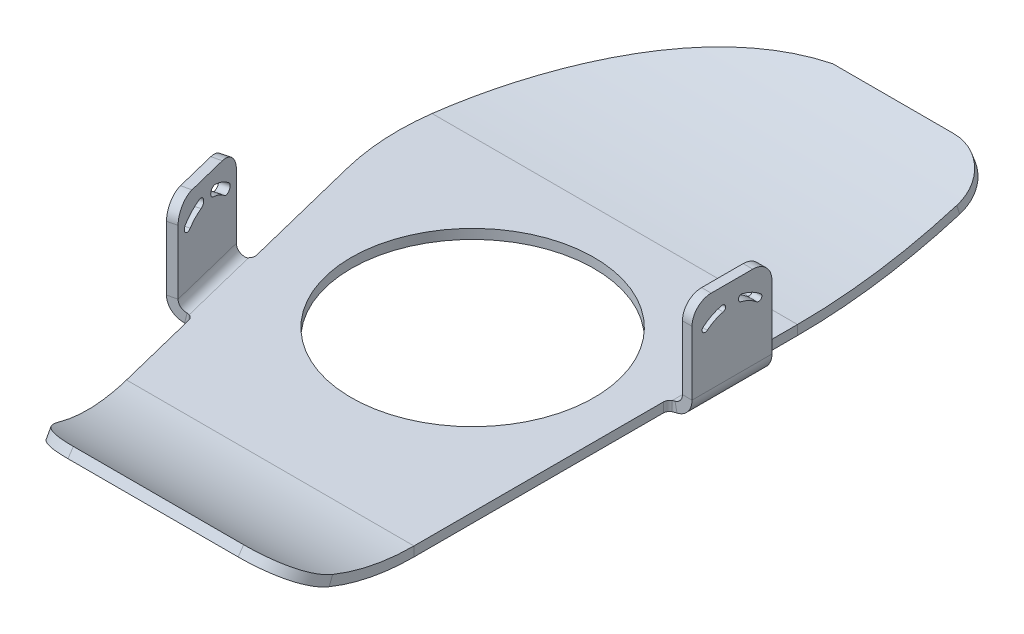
ISO-10303-21;
HEADER;
FILE_DESCRIPTION(('STEP AP214'),'2;1');
FILE_NAME('part.step','',(''),(''),'','','');
FILE_SCHEMA(('AUTOMOTIVE_DESIGN { 1 0 10303 214 1 1 1 1 }'));
ENDSEC;
DATA;
#1=APPLICATION_CONTEXT('core data for automotive mechanical design processes');
#2=APPLICATION_PROTOCOL_DEFINITION('international standard','automotive_design',2000,#1);
#3=PRODUCT_CONTEXT('',#1,'mechanical');
#4=PRODUCT('Part','Part','',(#3));
#5=PRODUCT_RELATED_PRODUCT_CATEGORY('part','',(#4));
#6=PRODUCT_DEFINITION_FORMATION('','',#4);
#7=PRODUCT_DEFINITION_CONTEXT('part definition',#1,'design');
#8=PRODUCT_DEFINITION('design','',#6,#7);
#9=PRODUCT_DEFINITION_SHAPE('','',#8);
#10=(LENGTH_UNIT() NAMED_UNIT(*) SI_UNIT(.MILLI.,.METRE.));
#11=(NAMED_UNIT(*) PLANE_ANGLE_UNIT() SI_UNIT($,.RADIAN.));
#12=(NAMED_UNIT(*) SI_UNIT($,.STERADIAN.) SOLID_ANGLE_UNIT());
#13=UNCERTAINTY_MEASURE_WITH_UNIT(LENGTH_MEASURE(1.E-05),#10,'distance_accuracy_value','');
#14=(GEOMETRIC_REPRESENTATION_CONTEXT(3) GLOBAL_UNCERTAINTY_ASSIGNED_CONTEXT((#13)) GLOBAL_UNIT_ASSIGNED_CONTEXT((#10,
#11,#12)) REPRESENTATION_CONTEXT('',''));
#15=CARTESIAN_POINT('',(0.,0.,0.));
#16=DIRECTION('',(0.,0.,1.));
#17=DIRECTION('',(1.,0.,0.));
#18=AXIS2_PLACEMENT_3D('',#15,#16,#17);
#19=CARTESIAN_POINT('',(-17.3957566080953,26.,-93.8722853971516));
#20=DIRECTION('',(-0.97047368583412,0.,0.241207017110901));
#21=DIRECTION('',(0.058180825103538,-0.97047368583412,0.234085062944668));
#22=AXIS2_PLACEMENT_3D('',#19,#20,#21);
#23=CYLINDRICAL_SURFACE('',#22,6.);
#24=CARTESIAN_POINT('',(-102.213628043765,26.,-72.7911720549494));
#25=DIRECTION('',(0.97047368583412,0.,-0.241207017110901));
#26=DIRECTION('',(-0.058180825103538,0.97047368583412,-0.234085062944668));
#27=AXIS2_PLACEMENT_3D('',#24,#25,#26);
#28=CIRCLE('',#27,6.);
#29=CARTESIAN_POINT('',(-102.213628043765,32.,-72.7911720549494));
#30=VERTEX_POINT('',#29);
#31=CARTESIAN_POINT('',(-100.7663859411,26.,-66.9683299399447));
#32=VERTEX_POINT('',#31);
#33=EDGE_CURVE('E678',#30,#32,#28,.T.);
#34=ORIENTED_EDGE('',*,*,#33,.F.);
#35=DIRECTION('',(-0.97047368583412,0.,0.241207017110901));
#36=VECTOR('',#35,1.);
#37=CARTESIAN_POINT('',(-17.3957566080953,32.,-93.8722853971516));
#38=LINE('',#37,#36);
#39=CARTESIAN_POINT('',(-105.125049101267,32.,-72.0675510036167));
#40=VERTEX_POINT('',#39);
#41=EDGE_CURVE('E137',#40,#30,#38,.F.);
#42=ORIENTED_EDGE('',*,*,#41,.F.);
#43=CARTESIAN_POINT('',(-105.125049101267,26.,-72.0675510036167));
#44=DIRECTION('',(0.97047368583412,0.,-0.241207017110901));
#45=DIRECTION('',(-0.058180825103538,0.97047368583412,-0.234085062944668));
#46=AXIS2_PLACEMENT_3D('',#43,#44,#45);
#47=CIRCLE('',#46,6.);
#48=CARTESIAN_POINT('',(-103.677806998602,26.,-66.244708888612));
#49=VERTEX_POINT('',#48);
#50=EDGE_CURVE('E143',#49,#40,#47,.F.);
#51=ORIENTED_EDGE('',*,*,#50,.F.);
#52=DIRECTION('',(-0.97047368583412,0.,0.241207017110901));
#53=VECTOR('',#52,1.);
#54=CARTESIAN_POINT('',(-15.9485145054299,26.,-88.0494432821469));
#55=LINE('',#54,#53);
#56=EDGE_CURVE('E672',#32,#49,#55,.T.);
#57=ORIENTED_EDGE('',*,*,#56,.F.);
#58=EDGE_LOOP('',(#34,#42,#51,#57));
#59=FACE_BOUND('',#58,.T.);
#60=ADVANCED_FACE('F45',(#59),#23,.T.);
#61=CARTESIAN_POINT('',(-21.9786899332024,32.0000000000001,-112.311285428));
#62=DIRECTION('',(0.,1.,0.));
#63=DIRECTION('',(0.241207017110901,0.,0.97047368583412));
#64=AXIS2_PLACEMENT_3D('',#61,#62,#63);
#65=PLANE('',#64);
#66=DIRECTION('',(-0.241207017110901,0.,-0.97047368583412));
#67=VECTOR('',#66,1.);
#68=CARTESIAN_POINT('',(-106.796561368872,32.0000000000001,-91.2301720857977));
#69=LINE('',#68,#67);
#70=CARTESIAN_POINT('',(-105.349319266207,32.0000000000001,-85.407329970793));
#71=VERTEX_POINT('',#70);
#72=EDGE_CURVE('E753',#30,#71,#69,.T.);
#73=ORIENTED_EDGE('',*,*,#72,.T.);
#74=DIRECTION('',(-0.97047368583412,0.,0.241207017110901));
#75=VECTOR('',#74,1.);
#76=CARTESIAN_POINT('',(-20.531447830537,32.0000000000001,-106.488443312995));
#77=LINE('',#76,#75);
#78=CARTESIAN_POINT('',(-108.260740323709,32.0000000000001,-84.6837089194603));
#79=VERTEX_POINT('',#78);
#80=EDGE_CURVE('E750',#71,#79,#77,.T.);
#81=ORIENTED_EDGE('',*,*,#80,.T.);
#82=DIRECTION('',(-0.241207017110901,0.,-0.97047368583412));
#83=VECTOR('',#82,1.);
#84=CARTESIAN_POINT('',(-109.707982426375,32.0000000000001,-90.506551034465));
#85=LINE('',#84,#83);
#86=EDGE_CURVE('E695',#40,#79,#85,.T.);
#87=ORIENTED_EDGE('',*,*,#86,.F.);
#88=ORIENTED_EDGE('',*,*,#41,.T.);
#89=EDGE_LOOP('',(#73,#81,#87,#88));
#90=FACE_BOUND('',#89,.T.);
#91=ADVANCED_FACE('F605',(#90),#65,.T.);
#92=CARTESIAN_POINT('',(36.7131452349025,23.2041740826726,-105.456985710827));
#93=DIRECTION('',(-0.97047368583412,0.,0.241207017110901));
#94=DIRECTION('',(0.241207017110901,0.,0.97047368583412));
#95=AXIS2_PLACEMENT_3D('',#92,#93,#94);
#96=CYLINDRICAL_SURFACE('',#95,1.5);
#97=DIRECTION('',(-0.97047368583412,0.,0.241207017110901));
#98=VECTOR('',#97,1.);
#99=CARTESIAN_POINT('',(36.47264833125,22.0835138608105,-106.42460232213));
#100=LINE('',#99,#98);
#101=CARTESIAN_POINT('',(-102.017829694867,22.0835138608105,-72.0033958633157));
#102=VERTEX_POINT('',#101);
#103=CARTESIAN_POINT('',(-104.92925075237,22.0835138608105,-71.279774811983));
#104=VERTEX_POINT('',#103);
#105=EDGE_CURVE('E746',#102,#104,#100,.T.);
#106=ORIENTED_EDGE('',*,*,#105,.T.);
#107=CARTESIAN_POINT('',(-104.688753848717,23.2041740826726,-70.31215820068));
#108=DIRECTION('',(-0.97047368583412,0.,0.241207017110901));
#109=DIRECTION('',(-0.241207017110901,0.,-0.97047368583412));
#110=AXIS2_PLACEMENT_3D('',#107,#108,#109);
#111=CIRCLE('',#110,1.5);
#112=CARTESIAN_POINT('',(-104.448256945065,24.3248343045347,-69.344541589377));
#113=VERTEX_POINT('',#112);
#114=EDGE_CURVE('E743',#104,#113,#111,.T.);
#115=ORIENTED_EDGE('',*,*,#114,.T.);
#116=DIRECTION('',(-0.97047368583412,0.,0.241207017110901));
#117=VECTOR('',#116,1.);
#118=CARTESIAN_POINT('',(36.953642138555,24.3248343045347,-104.489369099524));
#119=LINE('',#118,#117);
#120=CARTESIAN_POINT('',(-101.536835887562,24.3248343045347,-70.0681626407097));
#121=VERTEX_POINT('',#120);
#122=EDGE_CURVE('E740',#121,#113,#119,.T.);
#123=ORIENTED_EDGE('',*,*,#122,.F.);
#124=CARTESIAN_POINT('',(-101.777332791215,23.2041740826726,-71.0357792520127));
#125=DIRECTION('',(0.97047368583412,0.,-0.241207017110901));
#126=DIRECTION('',(-0.241207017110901,0.,-0.97047368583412));
#127=AXIS2_PLACEMENT_3D('',#124,#125,#126);
#128=CIRCLE('',#127,1.5);
#129=EDGE_CURVE('E55',#102,#121,#128,.F.);
#130=ORIENTED_EDGE('',*,*,#129,.F.);
#131=EDGE_LOOP('',(#106,#115,#123,#130));
#132=FACE_BOUND('',#131,.T.);
#133=ADVANCED_FACE('F610',(#132),#96,.F.);
#134=CARTESIAN_POINT('',(34.7090043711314,13.8653389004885,-113.520457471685));
#135=DIRECTION('',(-0.97047368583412,0.,0.241207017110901));
#136=DIRECTION('',(0.241207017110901,0.,0.97047368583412));
#137=AXIS2_PLACEMENT_3D('',#134,#135,#136);
#138=CYLINDRICAL_SURFACE('',#137,14.);
#139=ORIENTED_EDGE('',*,*,#122,.T.);
#140=CARTESIAN_POINT('',(-106.692894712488,13.8653389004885,-78.3756299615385));
#141=DIRECTION('',(-0.97047368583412,0.,0.241207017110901));
#142=DIRECTION('',(-0.241207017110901,0.,-0.97047368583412));
#143=AXIS2_PLACEMENT_3D('',#140,#141,#142);
#144=CIRCLE('',#143,14.);
#145=CARTESIAN_POINT('',(-105.882439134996,27.4561593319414,-75.1148383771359));
#146=VERTEX_POINT('',#145);
#147=EDGE_CURVE('E737',#113,#146,#144,.T.);
#148=ORIENTED_EDGE('',*,*,#147,.T.);
#149=DIRECTION('',(-0.97047368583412,0.,0.241207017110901));
#150=VECTOR('',#149,1.);
#151=CARTESIAN_POINT('',(35.519459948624,27.4561593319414,-110.259665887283));
#152=LINE('',#151,#150);
#153=CARTESIAN_POINT('',(-102.971018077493,27.4561593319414,-75.8384594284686));
#154=VERTEX_POINT('',#153);
#155=EDGE_CURVE('E734',#154,#146,#152,.T.);
#156=ORIENTED_EDGE('',*,*,#155,.F.);
#157=CARTESIAN_POINT('',(-103.781473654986,13.8653389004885,-79.0992510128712));
#158=DIRECTION('',(0.97047368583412,0.,-0.241207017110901));
#159=DIRECTION('',(-0.241207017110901,0.,-0.97047368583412));
#160=AXIS2_PLACEMENT_3D('',#157,#158,#159);
#161=CIRCLE('',#160,14.);
#162=EDGE_CURVE('E13',#121,#154,#161,.F.);
#163=ORIENTED_EDGE('',*,*,#162,.F.);
#164=EDGE_LOOP('',(#139,#148,#156,#163));
#165=FACE_BOUND('',#164,.T.);
#166=ADVANCED_FACE('F619',(#165),#138,.F.);
#167=CARTESIAN_POINT('',(35.4326254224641,26.,-110.609036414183));
#168=DIRECTION('',(-0.97047368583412,0.,0.241207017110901));
#169=DIRECTION('',(0.241207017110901,0.,0.97047368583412));
#170=AXIS2_PLACEMENT_3D('',#167,#168,#169);
#171=CYLINDRICAL_SURFACE('',#170,1.5);
#172=ORIENTED_EDGE('',*,*,#155,.T.);
#173=CARTESIAN_POINT('',(-105.969273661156,26.,-75.4642089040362));
#174=DIRECTION('',(-0.97047368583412,0.,0.241207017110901));
#175=DIRECTION('',(0.241207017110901,0.,0.97047368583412));
#176=AXIS2_PLACEMENT_3D('',#173,#174,#175);
#177=CIRCLE('',#176,1.5);
#178=CARTESIAN_POINT('',(-106.056108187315,24.5438406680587,-75.8135794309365));
#179=VERTEX_POINT('',#178);
#180=EDGE_CURVE('E731',#146,#179,#177,.T.);
#181=ORIENTED_EDGE('',*,*,#180,.T.);
#182=DIRECTION('',(-0.97047368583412,0.,0.241207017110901));
#183=VECTOR('',#182,1.);
#184=CARTESIAN_POINT('',(35.3457908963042,24.5438406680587,-110.958406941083));
#185=LINE('',#184,#183);
#186=CARTESIAN_POINT('',(-103.144687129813,24.5438406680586,-76.5372004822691));
#187=VERTEX_POINT('',#186);
#188=EDGE_CURVE('E728',#187,#179,#185,.T.);
#189=ORIENTED_EDGE('',*,*,#188,.F.);
#190=CARTESIAN_POINT('',(-103.057852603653,26.,-76.1878299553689));
#191=DIRECTION('',(0.97047368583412,0.,-0.241207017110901));
#192=DIRECTION('',(-0.241207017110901,0.,-0.97047368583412));
#193=AXIS2_PLACEMENT_3D('',#190,#191,#192);
#194=CIRCLE('',#193,1.5);
#195=EDGE_CURVE('E853',#154,#187,#194,.F.);
#196=ORIENTED_EDGE('',*,*,#195,.F.);
#197=EDGE_LOOP('',(#172,#181,#189,#196));
#198=FACE_BOUND('',#197,.T.);
#199=ADVANCED_FACE('F623',(#198),#171,.F.);
#200=CARTESIAN_POINT('',(34.7090043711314,13.8653389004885,-113.520457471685));
#201=DIRECTION('',(-0.97047368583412,0.,0.241207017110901));
#202=DIRECTION('',(0.241207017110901,0.,0.97047368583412));
#203=AXIS2_PLACEMENT_3D('',#200,#201,#202);
#204=CYLINDRICAL_SURFACE('',#203,11.);
#205=ORIENTED_EDGE('',*,*,#188,.T.);
#206=CARTESIAN_POINT('',(-106.692894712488,13.8653389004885,-78.3756299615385));
#207=DIRECTION('',(0.97047368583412,0.,-0.241207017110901));
#208=DIRECTION('',(-0.241207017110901,0.,-0.97047368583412));
#209=AXIS2_PLACEMENT_3D('',#206,#207,#208);
#210=CIRCLE('',#209,11.);
#211=EDGE_CURVE('E726',#179,#104,#210,.T.);
#212=ORIENTED_EDGE('',*,*,#211,.T.);
#213=ORIENTED_EDGE('',*,*,#105,.F.);
#214=CARTESIAN_POINT('',(-103.781473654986,13.8653389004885,-79.0992510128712));
#215=DIRECTION('',(0.97047368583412,0.,-0.241207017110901));
#216=DIRECTION('',(-0.241207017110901,0.,-0.97047368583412));
#217=AXIS2_PLACEMENT_3D('',#214,#215,#216);
#218=CIRCLE('',#217,11.);
#219=EDGE_CURVE('E851',#187,#102,#218,.T.);
#220=ORIENTED_EDGE('',*,*,#219,.F.);
#221=EDGE_LOOP('',(#205,#212,#213,#220));
#222=FACE_BOUND('',#221,.T.);
#223=ADVANCED_FACE('F627',(#222),#204,.T.);
#224=CARTESIAN_POINT('',(34.7090043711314,13.8653389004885,-113.520457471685));
#225=DIRECTION('',(-0.97047368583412,0.,0.241207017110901));
#226=DIRECTION('',(0.241207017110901,0.,0.97047368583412));
#227=AXIS2_PLACEMENT_3D('',#224,#225,#226);
#228=CYLINDRICAL_SURFACE('',#227,11.);
#229=DIRECTION('',(-0.97047368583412,0.,0.241207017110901));
#230=VECTOR('',#229,1.);
#231=CARTESIAN_POINT('',(32.9453604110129,22.0835138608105,-120.616312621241));
#232=LINE('',#231,#230);
#233=CARTESIAN_POINT('',(-105.545117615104,22.0835138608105,-86.1951061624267));
#234=VERTEX_POINT('',#233);
#235=CARTESIAN_POINT('',(-108.456538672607,22.0835138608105,-85.471485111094));
#236=VERTEX_POINT('',#235);
#237=EDGE_CURVE('E724',#234,#236,#232,.T.);
#238=ORIENTED_EDGE('',*,*,#237,.T.);
#239=CARTESIAN_POINT('',(-106.692894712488,13.8653389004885,-78.3756299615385));
#240=DIRECTION('',(0.97047368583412,0.,-0.241207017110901));
#241=DIRECTION('',(0.241207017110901,0.,0.97047368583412));
#242=AXIS2_PLACEMENT_3D('',#239,#240,#241);
#243=CIRCLE('',#242,11.);
#244=CARTESIAN_POINT('',(-107.329681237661,24.5438406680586,-80.9376804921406));
#245=VERTEX_POINT('',#244);
#246=EDGE_CURVE('E721',#236,#245,#243,.T.);
#247=ORIENTED_EDGE('',*,*,#246,.T.);
#248=DIRECTION('',(-0.97047368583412,0.,0.241207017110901));
#249=VECTOR('',#248,1.);
#250=CARTESIAN_POINT('',(34.0722178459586,24.5438406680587,-116.082508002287));
#251=LINE('',#250,#249);
#252=CARTESIAN_POINT('',(-104.418260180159,24.5438406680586,-81.6613015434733));
#253=VERTEX_POINT('',#252);
#254=EDGE_CURVE('E719',#253,#245,#251,.T.);
#255=ORIENTED_EDGE('',*,*,#254,.F.);
#256=CARTESIAN_POINT('',(-103.781473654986,13.8653389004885,-79.0992510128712));
#257=DIRECTION('',(0.97047368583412,0.,-0.241207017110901));
#258=DIRECTION('',(-0.241207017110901,0.,-0.97047368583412));
#259=AXIS2_PLACEMENT_3D('',#256,#257,#258);
#260=CIRCLE('',#259,11.);
#261=EDGE_CURVE('E858',#234,#253,#260,.T.);
#262=ORIENTED_EDGE('',*,*,#261,.F.);
#263=EDGE_LOOP('',(#238,#247,#255,#262));
#264=FACE_BOUND('',#263,.T.);
#265=ADVANCED_FACE('F631',(#264),#228,.T.);
#266=CARTESIAN_POINT('',(33.9853833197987,26.,-116.431878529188));
#267=DIRECTION('',(-0.97047368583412,0.,0.241207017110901));
#268=DIRECTION('',(0.241207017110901,0.,0.97047368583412));
#269=AXIS2_PLACEMENT_3D('',#266,#267,#268);
#270=CYLINDRICAL_SURFACE('',#269,1.5);
#271=ORIENTED_EDGE('',*,*,#254,.T.);
#272=CARTESIAN_POINT('',(-107.416515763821,26.,-81.2870510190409));
#273=DIRECTION('',(-0.97047368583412,0.,0.241207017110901));
#274=DIRECTION('',(-0.241207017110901,0.,-0.97047368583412));
#275=AXIS2_PLACEMENT_3D('',#272,#273,#274);
#276=CIRCLE('',#275,1.5);
#277=CARTESIAN_POINT('',(-107.503350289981,27.4561593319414,-81.6364215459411));
#278=VERTEX_POINT('',#277);
#279=EDGE_CURVE('E716',#245,#278,#276,.T.);
#280=ORIENTED_EDGE('',*,*,#279,.T.);
#281=DIRECTION('',(-0.97047368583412,0.,0.241207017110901));
#282=VECTOR('',#281,1.);
#283=CARTESIAN_POINT('',(33.8985487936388,27.4561593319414,-116.781249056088));
#284=LINE('',#283,#282);
#285=CARTESIAN_POINT('',(-104.591929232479,27.4561593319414,-82.3600425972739));
#286=VERTEX_POINT('',#285);
#287=EDGE_CURVE('E714',#286,#278,#284,.T.);
#288=ORIENTED_EDGE('',*,*,#287,.F.);
#289=CARTESIAN_POINT('',(-104.505094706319,26.0000000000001,-82.0106720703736));
#290=DIRECTION('',(0.97047368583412,0.,-0.241207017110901));
#291=DIRECTION('',(-0.241207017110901,0.,-0.97047368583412));
#292=AXIS2_PLACEMENT_3D('',#289,#290,#291);
#293=CIRCLE('',#292,1.5);
#294=EDGE_CURVE('E855',#253,#286,#293,.F.);
#295=ORIENTED_EDGE('',*,*,#294,.F.);
#296=EDGE_LOOP('',(#271,#280,#288,#295));
#297=FACE_BOUND('',#296,.T.);
#298=ADVANCED_FACE('F635',(#297),#270,.F.);
#299=CARTESIAN_POINT('',(34.7090043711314,13.8653389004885,-113.520457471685));
#300=DIRECTION('',(-0.97047368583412,0.,0.241207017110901));
#301=DIRECTION('',(0.241207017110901,0.,0.97047368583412));
#302=AXIS2_PLACEMENT_3D('',#299,#300,#301);
#303=CYLINDRICAL_SURFACE('',#302,14.);
#304=ORIENTED_EDGE('',*,*,#287,.T.);
#305=CARTESIAN_POINT('',(-106.692894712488,13.8653389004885,-78.3756299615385));
#306=DIRECTION('',(-0.97047368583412,0.,0.241207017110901));
#307=DIRECTION('',(0.241207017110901,0.,0.97047368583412));
#308=AXIS2_PLACEMENT_3D('',#305,#306,#307);
#309=CIRCLE('',#308,14.);
#310=CARTESIAN_POINT('',(-108.937532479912,24.3248343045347,-87.4067183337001));
#311=VERTEX_POINT('',#310);
#312=EDGE_CURVE('E712',#278,#311,#309,.T.);
#313=ORIENTED_EDGE('',*,*,#312,.T.);
#314=DIRECTION('',(-0.97047368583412,0.,0.241207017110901));
#315=VECTOR('',#314,1.);
#316=CARTESIAN_POINT('',(32.4643666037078,24.3248343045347,-122.551545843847));
#317=LINE('',#316,#315);
#318=CARTESIAN_POINT('',(-106.026111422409,24.3248343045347,-88.1303393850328));
#319=VERTEX_POINT('',#318);
#320=EDGE_CURVE('E709',#319,#311,#317,.T.);
#321=ORIENTED_EDGE('',*,*,#320,.F.);
#322=CARTESIAN_POINT('',(-103.781473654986,13.8653389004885,-79.0992510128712));
#323=DIRECTION('',(0.97047368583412,0.,-0.241207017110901));
#324=DIRECTION('',(-0.241207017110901,0.,-0.97047368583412));
#325=AXIS2_PLACEMENT_3D('',#322,#323,#324);
#326=CIRCLE('',#325,14.);
#327=EDGE_CURVE('E862',#286,#319,#326,.F.);
#328=ORIENTED_EDGE('',*,*,#327,.F.);
#329=EDGE_LOOP('',(#304,#313,#321,#328));
#330=FACE_BOUND('',#329,.T.);
#331=ADVANCED_FACE('F639',(#330),#303,.F.);
#332=CARTESIAN_POINT('',(32.7048635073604,23.2041740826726,-121.583929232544));
#333=DIRECTION('',(-0.97047368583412,0.,0.241207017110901));
#334=DIRECTION('',(0.241207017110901,0.,0.97047368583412));
#335=AXIS2_PLACEMENT_3D('',#332,#333,#334);
#336=CYLINDRICAL_SURFACE('',#335,1.5);
#337=ORIENTED_EDGE('',*,*,#320,.T.);
#338=CARTESIAN_POINT('',(-108.697035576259,23.2041740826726,-86.439101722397));
#339=DIRECTION('',(-0.97047368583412,0.,0.241207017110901));
#340=DIRECTION('',(0.241207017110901,0.,0.97047368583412));
#341=AXIS2_PLACEMENT_3D('',#338,#339,#340);
#342=CIRCLE('',#341,1.5);
#343=EDGE_CURVE('E706',#311,#236,#342,.T.);
#344=ORIENTED_EDGE('',*,*,#343,.T.);
#345=ORIENTED_EDGE('',*,*,#237,.F.);
#346=CARTESIAN_POINT('',(-105.785614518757,23.2041740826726,-87.1627227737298));
#347=DIRECTION('',(0.97047368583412,0.,-0.241207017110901));
#348=DIRECTION('',(-0.241207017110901,0.,-0.97047368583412));
#349=AXIS2_PLACEMENT_3D('',#346,#347,#348);
#350=CIRCLE('',#349,1.5);
#351=EDGE_CURVE('E860',#319,#234,#350,.F.);
#352=ORIENTED_EDGE('',*,*,#351,.F.);
#353=EDGE_LOOP('',(#337,#344,#345,#352));
#354=FACE_BOUND('',#353,.T.);
#355=ADVANCED_FACE('F643',(#354),#336,.F.);
#356=CARTESIAN_POINT('',(-20.531447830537,26.,-106.488443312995));
#357=DIRECTION('',(-0.97047368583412,0.,0.241207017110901));
#358=DIRECTION('',(0.058180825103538,-0.97047368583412,0.234085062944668));
#359=AXIS2_PLACEMENT_3D('',#356,#357,#358);
#360=CYLINDRICAL_SURFACE('',#359,6.);
#361=CARTESIAN_POINT('',(-105.349319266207,26.,-85.407329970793));
#362=DIRECTION('',(0.97047368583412,0.,-0.241207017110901));
#363=DIRECTION('',(-0.058180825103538,0.97047368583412,-0.234085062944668));
#364=AXIS2_PLACEMENT_3D('',#361,#362,#363);
#365=CIRCLE('',#364,6.);
#366=CARTESIAN_POINT('',(-106.796561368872,26.0000000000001,-91.2301720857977));
#367=VERTEX_POINT('',#366);
#368=EDGE_CURVE('E679',#367,#71,#365,.T.);
#369=ORIENTED_EDGE('',*,*,#368,.F.);
#370=DIRECTION('',(-0.97047368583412,0.,0.241207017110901));
#371=VECTOR('',#370,1.);
#372=CARTESIAN_POINT('',(-21.9786899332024,26.0000000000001,-112.311285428));
#373=LINE('',#372,#371);
#374=CARTESIAN_POINT('',(-109.707982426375,26.0000000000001,-90.506551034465));
#375=VERTEX_POINT('',#374);
#376=EDGE_CURVE('E704',#375,#367,#373,.F.);
#377=ORIENTED_EDGE('',*,*,#376,.F.);
#378=CARTESIAN_POINT('',(-108.260740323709,26.,-84.6837089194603));
#379=DIRECTION('',(0.97047368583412,0.,-0.241207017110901));
#380=DIRECTION('',(-0.058180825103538,0.97047368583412,-0.234085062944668));
#381=AXIS2_PLACEMENT_3D('',#378,#379,#380);
#382=CIRCLE('',#381,6.);
#383=EDGE_CURVE('E693',#79,#375,#382,.F.);
#384=ORIENTED_EDGE('',*,*,#383,.F.);
#385=ORIENTED_EDGE('',*,*,#80,.F.);
#386=EDGE_LOOP('',(#369,#377,#384,#385));
#387=FACE_BOUND('',#386,.T.);
#388=ADVANCED_FACE('F647',(#387),#360,.T.);
#389=CARTESIAN_POINT('',(-21.9786899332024,0.,-112.311285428));
#390=DIRECTION('',(-0.241207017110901,0.,-0.97047368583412));
#391=DIRECTION('',(0.,1.,0.));
#392=AXIS2_PLACEMENT_3D('',#389,#390,#391);
#393=PLANE('',#392);
#394=DIRECTION('',(0.,-1.,0.));
#395=VECTOR('',#394,1.);
#396=CARTESIAN_POINT('',(-109.707982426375,0.,-90.506551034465));
#397=LINE('',#396,#395);
#398=CARTESIAN_POINT('',(-109.707982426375,6.00000000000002,-90.506551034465));
#399=VERTEX_POINT('',#398);
#400=EDGE_CURVE('E690',#375,#399,#397,.T.);
#401=ORIENTED_EDGE('',*,*,#400,.F.);
#402=ORIENTED_EDGE('',*,*,#376,.T.);
#403=DIRECTION('',(0.,-1.,0.));
#404=VECTOR('',#403,1.);
#405=CARTESIAN_POINT('',(-106.796561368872,0.,-91.2301720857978));
#406=LINE('',#405,#404);
#407=CARTESIAN_POINT('',(-106.796561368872,6.00000000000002,-91.2301720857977));
#408=VERTEX_POINT('',#407);
#409=EDGE_CURVE('E701',#367,#408,#406,.T.);
#410=ORIENTED_EDGE('',*,*,#409,.T.);
#411=DIRECTION('',(-0.97047368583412,0.,0.241207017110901));
#412=VECTOR('',#411,1.);
#413=CARTESIAN_POINT('',(-21.9786899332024,6.00000000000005,-112.311285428));
#414=LINE('',#413,#412);
#415=EDGE_CURVE('E698',#408,#399,#414,.T.);
#416=ORIENTED_EDGE('',*,*,#415,.T.);
#417=EDGE_LOOP('',(#401,#402,#410,#416));
#418=FACE_BOUND('',#417,.T.);
#419=ADVANCED_FACE('F651',(#418),#393,.T.);
#420=CARTESIAN_POINT('',(-109.707982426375,32.0000000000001,-90.506551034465));
#421=DIRECTION('',(0.97047368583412,0.,-0.241207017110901));
#422=DIRECTION('',(-0.241207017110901,0.,-0.97047368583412));
#423=AXIS2_PLACEMENT_3D('',#420,#421,#422);
#424=PLANE('',#423);
#425=ORIENTED_EDGE('',*,*,#343,.F.);
#426=ORIENTED_EDGE('',*,*,#312,.F.);
#427=ORIENTED_EDGE('',*,*,#279,.F.);
#428=ORIENTED_EDGE('',*,*,#246,.F.);
#429=EDGE_LOOP('',(#425,#426,#427,#428));
#430=FACE_BOUND('',#429,.T.);
#431=ORIENTED_EDGE('',*,*,#211,.F.);
#432=ORIENTED_EDGE('',*,*,#180,.F.);
#433=ORIENTED_EDGE('',*,*,#147,.F.);
#434=ORIENTED_EDGE('',*,*,#114,.F.);
#435=EDGE_LOOP('',(#431,#432,#433,#434));
#436=FACE_BOUND('',#435,.T.);
#437=ORIENTED_EDGE('',*,*,#86,.T.);
#438=ORIENTED_EDGE('',*,*,#383,.T.);
#439=ORIENTED_EDGE('',*,*,#400,.T.);
#440=DIRECTION('',(0.241207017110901,0.,0.97047368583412));
#441=VECTOR('',#440,1.);
#442=CARTESIAN_POINT('',(-109.707982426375,6.00000000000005,-90.5065510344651));
#443=LINE('',#442,#441);
#444=CARTESIAN_POINT('',(-103.677806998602,6.00000000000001,-66.2447088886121));
#445=VERTEX_POINT('',#444);
#446=EDGE_CURVE('E687',#399,#445,#443,.T.);
#447=ORIENTED_EDGE('',*,*,#446,.T.);
#448=DIRECTION('',(0.,1.,0.));
#449=VECTOR('',#448,1.);
#450=CARTESIAN_POINT('',(-103.677806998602,0.,-66.2447088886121));
#451=LINE('',#450,#449);
#452=EDGE_CURVE('E685',#445,#49,#451,.T.);
#453=ORIENTED_EDGE('',*,*,#452,.T.);
#454=ORIENTED_EDGE('',*,*,#50,.T.);
#455=EDGE_LOOP('',(#437,#438,#439,#447,#453,#454));
#456=FACE_BOUND('',#455,.T.);
#457=ADVANCED_FACE('F655',(#430,#436,#456),#424,.F.);
#458=CARTESIAN_POINT('',(-15.9485145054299,0.,-88.0494432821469));
#459=DIRECTION('',(0.241207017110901,0.,0.97047368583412));
#460=DIRECTION('',(0.,-1.,0.));
#461=AXIS2_PLACEMENT_3D('',#458,#459,#460);
#462=PLANE('',#461);
#463=DIRECTION('',(0.,1.,0.));
#464=VECTOR('',#463,1.);
#465=CARTESIAN_POINT('',(-100.7663859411,0.,-66.9683299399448));
#466=LINE('',#465,#464);
#467=CARTESIAN_POINT('',(-100.7663859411,5.99999999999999,-66.9683299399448));
#468=VERTEX_POINT('',#467);
#469=EDGE_CURVE('E670',#468,#32,#466,.T.);
#470=ORIENTED_EDGE('',*,*,#469,.T.);
#471=ORIENTED_EDGE('',*,*,#56,.T.);
#472=ORIENTED_EDGE('',*,*,#452,.F.);
#473=DIRECTION('',(-0.97047368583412,0.,0.241207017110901));
#474=VECTOR('',#473,1.);
#475=CARTESIAN_POINT('',(-15.9485145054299,6.00000000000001,-88.0494432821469));
#476=LINE('',#475,#474);
#477=EDGE_CURVE('E675',#468,#445,#476,.T.);
#478=ORIENTED_EDGE('',*,*,#477,.F.);
#479=EDGE_LOOP('',(#470,#471,#472,#478));
#480=FACE_BOUND('',#479,.T.);
#481=ADVANCED_FACE('F658',(#480),#462,.T.);
#482=CARTESIAN_POINT('',(-106.796561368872,32.0000000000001,-91.2301720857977));
#483=DIRECTION('',(0.97047368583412,0.,-0.241207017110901));
#484=DIRECTION('',(-0.241207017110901,0.,-0.97047368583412));
#485=AXIS2_PLACEMENT_3D('',#482,#483,#484);
#486=PLANE('',#485);
#487=ORIENTED_EDGE('',*,*,#409,.F.);
#488=ORIENTED_EDGE('',*,*,#368,.T.);
#489=ORIENTED_EDGE('',*,*,#72,.F.);
#490=ORIENTED_EDGE('',*,*,#33,.T.);
#491=ORIENTED_EDGE('',*,*,#469,.F.);
#492=DIRECTION('',(0.241207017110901,0.,0.97047368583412));
#493=VECTOR('',#492,1.);
#494=CARTESIAN_POINT('',(-106.796561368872,6.00000000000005,-91.2301720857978));
#495=LINE('',#494,#493);
#496=EDGE_CURVE('E756',#408,#468,#495,.T.);
#497=ORIENTED_EDGE('',*,*,#496,.F.);
#498=EDGE_LOOP('',(#487,#488,#489,#490,#491,#497));
#499=FACE_BOUND('',#498,.T.);
#500=ORIENTED_EDGE('',*,*,#327,.T.);
#501=ORIENTED_EDGE('',*,*,#351,.T.);
#502=ORIENTED_EDGE('',*,*,#261,.T.);
#503=ORIENTED_EDGE('',*,*,#294,.T.);
#504=EDGE_LOOP('',(#500,#501,#502,#503));
#505=FACE_BOUND('',#504,.T.);
#506=ORIENTED_EDGE('',*,*,#195,.T.);
#507=ORIENTED_EDGE('',*,*,#219,.T.);
#508=ORIENTED_EDGE('',*,*,#129,.T.);
#509=ORIENTED_EDGE('',*,*,#162,.T.);
#510=EDGE_LOOP('',(#506,#507,#508,#509));
#511=FACE_BOUND('',#510,.T.);
#512=ADVANCED_FACE('F47',(#499,#505,#511),#486,.T.);
#513=CARTESIAN_POINT('',(-68.1387551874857,32.,-120.));
#514=DIRECTION('',(0.,1.,0.));
#515=DIRECTION('',(-1.,0.,0.));
#516=AXIS2_PLACEMENT_3D('',#513,#514,#515);
#517=PLANE('',#516);
#518=DIRECTION('',(0.,0.,1.));
#519=VECTOR('',#518,1.);
#520=CARTESIAN_POINT('',(7.,32.,-120.));
#521=LINE('',#520,#519);
#522=CARTESIAN_POINT('',(7.,32.,-139.));
#523=VERTEX_POINT('',#522);
#524=CARTESIAN_POINT('',(7.,32.,-126.));
#525=VERTEX_POINT('',#524);
#526=EDGE_CURVE('E1611',#523,#525,#521,.T.);
#527=ORIENTED_EDGE('',*,*,#526,.F.);
#528=DIRECTION('',(1.,0.,0.));
#529=VECTOR('',#528,1.);
#530=CARTESIAN_POINT('',(-68.1387551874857,32.,-139.));
#531=LINE('',#530,#529);
#532=CARTESIAN_POINT('',(4.,32.,-139.));
#533=VERTEX_POINT('',#532);
#534=EDGE_CURVE('E232',#523,#533,#531,.F.);
#535=ORIENTED_EDGE('',*,*,#534,.T.);
#536=DIRECTION('',(0.,0.,1.));
#537=VECTOR('',#536,1.);
#538=CARTESIAN_POINT('',(4.,32.,-120.));
#539=LINE('',#538,#537);
#540=CARTESIAN_POINT('',(4.,32.,-126.));
#541=VERTEX_POINT('',#540);
#542=EDGE_CURVE('E1549',#533,#541,#539,.T.);
#543=ORIENTED_EDGE('',*,*,#542,.T.);
#544=DIRECTION('',(1.,0.,0.));
#545=VECTOR('',#544,1.);
#546=CARTESIAN_POINT('',(-68.1387551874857,32.,-126.));
#547=LINE('',#546,#545);
#548=EDGE_CURVE('E1551',#541,#525,#547,.T.);
#549=ORIENTED_EDGE('',*,*,#548,.T.);
#550=EDGE_LOOP('',(#527,#535,#543,#549));
#551=FACE_BOUND('',#550,.T.);
#552=ADVANCED_FACE('F665',(#551),#517,.T.);
#553=CARTESIAN_POINT('',(-68.1387551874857,26.,-139.));
#554=DIRECTION('',(1.,0.,0.));
#555=DIRECTION('',(0.,1.,0.));
#556=AXIS2_PLACEMENT_3D('',#553,#554,#555);
#557=CYLINDRICAL_SURFACE('',#556,6.);
#558=CARTESIAN_POINT('',(4.,26.,-139.));
#559=DIRECTION('',(-1.,0.,0.));
#560=DIRECTION('',(0.,-1.,0.));
#561=AXIS2_PLACEMENT_3D('',#558,#559,#560);
#562=CIRCLE('',#561,6.);
#563=CARTESIAN_POINT('',(4.,26.,-145.));
#564=VERTEX_POINT('',#563);
#565=EDGE_CURVE('E1627',#533,#564,#562,.T.);
#566=ORIENTED_EDGE('',*,*,#565,.F.);
#567=ORIENTED_EDGE('',*,*,#534,.F.);
#568=CARTESIAN_POINT('',(7.00000000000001,26.,-139.));
#569=DIRECTION('',(-1.,0.,0.));
#570=DIRECTION('',(0.,-1.,0.));
#571=AXIS2_PLACEMENT_3D('',#568,#569,#570);
#572=CIRCLE('',#571,6.);
#573=CARTESIAN_POINT('',(7.,26.,-145.));
#574=VERTEX_POINT('',#573);
#575=EDGE_CURVE('E226',#574,#523,#572,.F.);
#576=ORIENTED_EDGE('',*,*,#575,.F.);
#577=DIRECTION('',(1.,0.,0.));
#578=VECTOR('',#577,1.);
#579=CARTESIAN_POINT('',(-68.1387551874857,26.,-145.));
#580=LINE('',#579,#578);
#581=EDGE_CURVE('E1625',#564,#574,#580,.T.);
#582=ORIENTED_EDGE('',*,*,#581,.F.);
#583=EDGE_LOOP('',(#566,#567,#576,#582));
#584=FACE_BOUND('',#583,.T.);
#585=ADVANCED_FACE('F1724',(#584),#557,.T.);
#586=CARTESIAN_POINT('',(-115.001,23.305514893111,-140.860946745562));
#587=DIRECTION('',(1.,0.,0.));
#588=DIRECTION('',(0.,0.,-1.));
#589=AXIS2_PLACEMENT_3D('',#586,#587,#588);
#590=CYLINDRICAL_SURFACE('',#589,0.999999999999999);
#591=DIRECTION('',(1.,0.,0.));
#592=VECTOR('',#591,1.);
#593=CARTESIAN_POINT('',(-115.001,22.5397744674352,-140.217796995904));
#594=LINE('',#593,#592);
#595=CARTESIAN_POINT('',(4.,22.5397744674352,-140.217796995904));
#596=VERTEX_POINT('',#595);
#597=CARTESIAN_POINT('',(7.,22.5397744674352,-140.217796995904));
#598=VERTEX_POINT('',#597);
#599=EDGE_CURVE('E1554',#596,#598,#594,.T.);
#600=ORIENTED_EDGE('',*,*,#599,.T.);
#601=CARTESIAN_POINT('',(7.,23.305514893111,-140.860946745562));
#602=DIRECTION('',(1.,0.,0.));
#603=DIRECTION('',(0.,0.,1.));
#604=AXIS2_PLACEMENT_3D('',#601,#602,#603);
#605=CIRCLE('',#604,0.999999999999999);
#606=CARTESIAN_POINT('',(7.,24.0712553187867,-141.504096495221));
#607=VERTEX_POINT('',#606);
#608=EDGE_CURVE('E1557',#598,#607,#605,.T.);
#609=ORIENTED_EDGE('',*,*,#608,.T.);
#610=DIRECTION('',(1.,0.,0.));
#611=VECTOR('',#610,1.);
#612=CARTESIAN_POINT('',(-115.001,24.0712553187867,-141.504096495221));
#613=LINE('',#612,#611);
#614=CARTESIAN_POINT('',(4.,24.0712553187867,-141.504096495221));
#615=VERTEX_POINT('',#614);
#616=EDGE_CURVE('E1560',#615,#607,#613,.T.);
#617=ORIENTED_EDGE('',*,*,#616,.F.);
#618=CARTESIAN_POINT('',(4.,23.305514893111,-140.860946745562));
#619=DIRECTION('',(-1.,0.,0.));
#620=DIRECTION('',(0.,0.,1.));
#621=AXIS2_PLACEMENT_3D('',#618,#619,#620);
#622=CIRCLE('',#621,0.999999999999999);
#623=EDGE_CURVE('E152',#596,#615,#622,.F.);
#624=ORIENTED_EDGE('',*,*,#623,.F.);
#625=EDGE_LOOP('',(#600,#609,#617,#624));
#626=FACE_BOUND('',#625,.T.);
#627=ADVANCED_FACE('F2001',(#626),#590,.F.);
#628=CARTESIAN_POINT('',(-115.001,13.3508893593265,-132.5));
#629=DIRECTION('',(1.,0.,0.));
#630=DIRECTION('',(0.,0.,-1.));
#631=AXIS2_PLACEMENT_3D('',#628,#629,#630);
#632=CYLINDRICAL_SURFACE('',#631,14.);
#633=ORIENTED_EDGE('',*,*,#616,.T.);
#634=CARTESIAN_POINT('',(7.,13.3508893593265,-132.5));
#635=DIRECTION('',(1.,0.,0.));
#636=DIRECTION('',(0.,0.,1.));
#637=AXIS2_PLACEMENT_3D('',#634,#635,#636);
#638=CIRCLE('',#637,14.);
#639=CARTESIAN_POINT('',(7.,26.973008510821,-135.730769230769));
#640=VERTEX_POINT('',#639);
#641=EDGE_CURVE('E1563',#607,#640,#638,.T.);
#642=ORIENTED_EDGE('',*,*,#641,.T.);
#643=DIRECTION('',(1.,0.,0.));
#644=VECTOR('',#643,1.);
#645=CARTESIAN_POINT('',(-115.001,26.973008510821,-135.730769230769));
#646=LINE('',#645,#644);
#647=CARTESIAN_POINT('',(4.00000000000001,26.973008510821,-135.730769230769));
#648=VERTEX_POINT('',#647);
#649=EDGE_CURVE('E1566',#648,#640,#646,.T.);
#650=ORIENTED_EDGE('',*,*,#649,.F.);
#651=CARTESIAN_POINT('',(4.00000000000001,13.3508893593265,-132.5));
#652=DIRECTION('',(-1.,0.,0.));
#653=DIRECTION('',(0.,0.,1.));
#654=AXIS2_PLACEMENT_3D('',#651,#652,#653);
#655=CIRCLE('',#654,14.);
#656=EDGE_CURVE('E758',#615,#648,#655,.F.);
#657=ORIENTED_EDGE('',*,*,#656,.F.);
#658=EDGE_LOOP('',(#633,#642,#650,#657));
#659=FACE_BOUND('',#658,.T.);
#660=ADVANCED_FACE('F2008',(#659),#632,.F.);
#661=CARTESIAN_POINT('',(-115.001,26.,-135.5));
#662=DIRECTION('',(1.,0.,0.));
#663=DIRECTION('',(0.,0.,-1.));
#664=AXIS2_PLACEMENT_3D('',#661,#662,#663);
#665=CYLINDRICAL_SURFACE('',#664,0.999999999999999);
#666=ORIENTED_EDGE('',*,*,#649,.T.);
#667=CARTESIAN_POINT('',(7.,26.,-135.5));
#668=DIRECTION('',(1.,0.,0.));
#669=DIRECTION('',(0.,0.,1.));
#670=AXIS2_PLACEMENT_3D('',#667,#668,#669);
#671=CIRCLE('',#670,0.999999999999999);
#672=CARTESIAN_POINT('',(7.00000000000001,25.026991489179,-135.269230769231));
#673=VERTEX_POINT('',#672);
#674=EDGE_CURVE('E1569',#640,#673,#671,.T.);
#675=ORIENTED_EDGE('',*,*,#674,.T.);
#676=DIRECTION('',(1.,0.,0.));
#677=VECTOR('',#676,1.);
#678=CARTESIAN_POINT('',(-115.001,25.026991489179,-135.269230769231));
#679=LINE('',#678,#677);
#680=CARTESIAN_POINT('',(4.00000000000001,25.026991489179,-135.269230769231));
#681=VERTEX_POINT('',#680);
#682=EDGE_CURVE('E1572',#681,#673,#679,.T.);
#683=ORIENTED_EDGE('',*,*,#682,.F.);
#684=CARTESIAN_POINT('',(4.00000000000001,26.,-135.5));
#685=DIRECTION('',(-1.,0.,0.));
#686=DIRECTION('',(0.,0.,1.));
#687=AXIS2_PLACEMENT_3D('',#684,#685,#686);
#688=CIRCLE('',#687,0.999999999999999);
#689=EDGE_CURVE('E1640',#648,#681,#688,.F.);
#690=ORIENTED_EDGE('',*,*,#689,.F.);
#691=EDGE_LOOP('',(#666,#675,#683,#690));
#692=FACE_BOUND('',#691,.T.);
#693=ADVANCED_FACE('F2017',(#692),#665,.F.);
#694=CARTESIAN_POINT('',(-115.001,13.3508893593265,-132.5));
#695=DIRECTION('',(1.,0.,0.));
#696=DIRECTION('',(0.,0.,-1.));
#697=AXIS2_PLACEMENT_3D('',#694,#695,#696);
#698=CYLINDRICAL_SURFACE('',#697,12.);
#699=ORIENTED_EDGE('',*,*,#682,.T.);
#700=CARTESIAN_POINT('',(7.,13.3508893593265,-132.5));
#701=DIRECTION('',(-1.,0.,0.));
#702=DIRECTION('',(0.,0.,1.));
#703=AXIS2_PLACEMENT_3D('',#700,#701,#702);
#704=CIRCLE('',#703,12.);
#705=EDGE_CURVE('E1575',#673,#598,#704,.T.);
#706=ORIENTED_EDGE('',*,*,#705,.T.);
#707=ORIENTED_EDGE('',*,*,#599,.F.);
#708=CARTESIAN_POINT('',(4.00000000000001,13.3508893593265,-132.5));
#709=DIRECTION('',(-1.,0.,0.));
#710=DIRECTION('',(0.,0.,1.));
#711=AXIS2_PLACEMENT_3D('',#708,#709,#710);
#712=CIRCLE('',#711,12.);
#713=EDGE_CURVE('E1642',#681,#596,#712,.T.);
#714=ORIENTED_EDGE('',*,*,#713,.F.);
#715=EDGE_LOOP('',(#699,#706,#707,#714));
#716=FACE_BOUND('',#715,.T.);
#717=ADVANCED_FACE('F2026',(#716),#698,.T.);
#718=CARTESIAN_POINT('',(-115.001,23.305514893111,-124.139053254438));
#719=DIRECTION('',(1.,0.,0.));
#720=DIRECTION('',(0.,0.,-1.));
#721=AXIS2_PLACEMENT_3D('',#718,#719,#720);
#722=CYLINDRICAL_SURFACE('',#721,0.999999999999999);
#723=DIRECTION('',(1.,0.,0.));
#724=VECTOR('',#723,1.);
#725=CARTESIAN_POINT('',(-115.001,24.0712553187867,-123.495903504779));
#726=LINE('',#725,#724);
#727=CARTESIAN_POINT('',(4.00000000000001,24.0712553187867,-123.495903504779));
#728=VERTEX_POINT('',#727);
#729=CARTESIAN_POINT('',(7.,24.0712553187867,-123.495903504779));
#730=VERTEX_POINT('',#729);
#731=EDGE_CURVE('E1577',#728,#730,#726,.T.);
#732=ORIENTED_EDGE('',*,*,#731,.T.);
#733=CARTESIAN_POINT('',(7.,23.305514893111,-124.139053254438));
#734=DIRECTION('',(1.,0.,0.));
#735=DIRECTION('',(0.,0.,-1.));
#736=AXIS2_PLACEMENT_3D('',#733,#734,#735);
#737=CIRCLE('',#736,0.999999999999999);
#738=CARTESIAN_POINT('',(7.,22.5397744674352,-124.782203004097));
#739=VERTEX_POINT('',#738);
#740=EDGE_CURVE('E1579',#730,#739,#737,.T.);
#741=ORIENTED_EDGE('',*,*,#740,.T.);
#742=DIRECTION('',(1.,0.,0.));
#743=VECTOR('',#742,1.);
#744=CARTESIAN_POINT('',(-115.001,22.5397744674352,-124.782203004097));
#745=LINE('',#744,#743);
#746=CARTESIAN_POINT('',(4.,22.5397744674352,-124.782203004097));
#747=VERTEX_POINT('',#746);
#748=EDGE_CURVE('E1582',#747,#739,#745,.T.);
#749=ORIENTED_EDGE('',*,*,#748,.F.);
#750=CARTESIAN_POINT('',(4.00000000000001,23.305514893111,-124.139053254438));
#751=DIRECTION('',(-1.,0.,0.));
#752=DIRECTION('',(0.,0.,1.));
#753=AXIS2_PLACEMENT_3D('',#750,#751,#752);
#754=CIRCLE('',#753,0.999999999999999);
#755=EDGE_CURVE('E1635',#728,#747,#754,.F.);
#756=ORIENTED_EDGE('',*,*,#755,.F.);
#757=EDGE_LOOP('',(#732,#741,#749,#756));
#758=FACE_BOUND('',#757,.T.);
#759=ADVANCED_FACE('F2035',(#758),#722,.F.);
#760=CARTESIAN_POINT('',(-115.001,13.3508893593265,-132.5));
#761=DIRECTION('',(1.,0.,0.));
#762=DIRECTION('',(0.,0.,-1.));
#763=AXIS2_PLACEMENT_3D('',#760,#761,#762);
#764=CYLINDRICAL_SURFACE('',#763,12.);
#765=ORIENTED_EDGE('',*,*,#748,.T.);
#766=CARTESIAN_POINT('',(7.,13.3508893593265,-132.5));
#767=DIRECTION('',(-1.,0.,0.));
#768=DIRECTION('',(0.,0.,-1.));
#769=AXIS2_PLACEMENT_3D('',#766,#767,#768);
#770=CIRCLE('',#769,12.);
#771=CARTESIAN_POINT('',(7.,25.026991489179,-129.730769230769));
#772=VERTEX_POINT('',#771);
#773=EDGE_CURVE('E1584',#739,#772,#770,.T.);
#774=ORIENTED_EDGE('',*,*,#773,.T.);
#775=DIRECTION('',(1.,0.,0.));
#776=VECTOR('',#775,1.);
#777=CARTESIAN_POINT('',(-115.001,25.026991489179,-129.730769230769));
#778=LINE('',#777,#776);
#779=CARTESIAN_POINT('',(4.00000000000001,25.026991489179,-129.730769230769));
#780=VERTEX_POINT('',#779);
#781=EDGE_CURVE('E1587',#780,#772,#778,.T.);
#782=ORIENTED_EDGE('',*,*,#781,.F.);
#783=CARTESIAN_POINT('',(4.00000000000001,13.3508893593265,-132.5));
#784=DIRECTION('',(-1.,0.,0.));
#785=DIRECTION('',(0.,0.,1.));
#786=AXIS2_PLACEMENT_3D('',#783,#784,#785);
#787=CIRCLE('',#786,12.);
#788=EDGE_CURVE('E1637',#747,#780,#787,.T.);
#789=ORIENTED_EDGE('',*,*,#788,.F.);
#790=EDGE_LOOP('',(#765,#774,#782,#789));
#791=FACE_BOUND('',#790,.T.);
#792=ADVANCED_FACE('F2044',(#791),#764,.T.);
#793=CARTESIAN_POINT('',(-115.001,26.,-129.5));
#794=DIRECTION('',(1.,0.,0.));
#795=DIRECTION('',(0.,0.,-1.));
#796=AXIS2_PLACEMENT_3D('',#793,#794,#795);
#797=CYLINDRICAL_SURFACE('',#796,0.999999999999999);
#798=ORIENTED_EDGE('',*,*,#781,.T.);
#799=CARTESIAN_POINT('',(7.,26.,-129.5));
#800=DIRECTION('',(1.,0.,0.));
#801=DIRECTION('',(0.,0.,-1.));
#802=AXIS2_PLACEMENT_3D('',#799,#800,#801);
#803=CIRCLE('',#802,0.999999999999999);
#804=CARTESIAN_POINT('',(7.00000000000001,26.973008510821,-129.269230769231));
#805=VERTEX_POINT('',#804);
#806=EDGE_CURVE('E1589',#772,#805,#803,.T.);
#807=ORIENTED_EDGE('',*,*,#806,.T.);
#808=DIRECTION('',(1.,0.,0.));
#809=VECTOR('',#808,1.);
#810=CARTESIAN_POINT('',(-115.001,26.973008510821,-129.269230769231));
#811=LINE('',#810,#809);
#812=CARTESIAN_POINT('',(4.00000000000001,26.973008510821,-129.269230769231));
#813=VERTEX_POINT('',#812);
#814=EDGE_CURVE('E1591',#813,#805,#811,.T.);
#815=ORIENTED_EDGE('',*,*,#814,.F.);
#816=CARTESIAN_POINT('',(4.00000000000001,26.,-129.5));
#817=DIRECTION('',(-1.,0.,0.));
#818=DIRECTION('',(0.,0.,1.));
#819=AXIS2_PLACEMENT_3D('',#816,#817,#818);
#820=CIRCLE('',#819,0.999999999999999);
#821=EDGE_CURVE('E1631',#780,#813,#820,.F.);
#822=ORIENTED_EDGE('',*,*,#821,.F.);
#823=EDGE_LOOP('',(#798,#807,#815,#822));
#824=FACE_BOUND('',#823,.T.);
#825=ADVANCED_FACE('F2053',(#824),#797,.F.);
#826=CARTESIAN_POINT('',(-115.001,13.3508893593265,-132.5));
#827=DIRECTION('',(1.,0.,0.));
#828=DIRECTION('',(0.,0.,-1.));
#829=AXIS2_PLACEMENT_3D('',#826,#827,#828);
#830=CYLINDRICAL_SURFACE('',#829,14.);
#831=ORIENTED_EDGE('',*,*,#814,.T.);
#832=CARTESIAN_POINT('',(7.,13.3508893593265,-132.5));
#833=DIRECTION('',(1.,0.,0.));
#834=DIRECTION('',(0.,0.,-1.));
#835=AXIS2_PLACEMENT_3D('',#832,#833,#834);
#836=CIRCLE('',#835,14.);
#837=EDGE_CURVE('E1594',#805,#730,#836,.T.);
#838=ORIENTED_EDGE('',*,*,#837,.T.);
#839=ORIENTED_EDGE('',*,*,#731,.F.);
#840=CARTESIAN_POINT('',(4.00000000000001,13.3508893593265,-132.5));
#841=DIRECTION('',(-1.,0.,0.));
#842=DIRECTION('',(0.,0.,1.));
#843=AXIS2_PLACEMENT_3D('',#840,#841,#842);
#844=CIRCLE('',#843,14.);
#845=EDGE_CURVE('E1633',#813,#728,#844,.F.);
#846=ORIENTED_EDGE('',*,*,#845,.F.);
#847=EDGE_LOOP('',(#831,#838,#839,#846));
#848=FACE_BOUND('',#847,.T.);
#849=ADVANCED_FACE('F2062',(#848),#830,.F.);
#850=CARTESIAN_POINT('',(-68.1387551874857,26.,-126.));
#851=DIRECTION('',(1.,0.,0.));
#852=DIRECTION('',(0.,1.,0.));
#853=AXIS2_PLACEMENT_3D('',#850,#851,#852);
#854=CYLINDRICAL_SURFACE('',#853,6.);
#855=CARTESIAN_POINT('',(4.,26.,-126.));
#856=DIRECTION('',(-1.,0.,0.));
#857=DIRECTION('',(0.,-1.,0.));
#858=AXIS2_PLACEMENT_3D('',#855,#856,#857);
#859=CIRCLE('',#858,6.);
#860=CARTESIAN_POINT('',(4.,26.,-120.));
#861=VERTEX_POINT('',#860);
#862=EDGE_CURVE('E1629',#861,#541,#859,.T.);
#863=ORIENTED_EDGE('',*,*,#862,.F.);
#864=DIRECTION('',(1.,0.,0.));
#865=VECTOR('',#864,1.);
#866=CARTESIAN_POINT('',(-68.1387551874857,26.,-120.));
#867=LINE('',#866,#865);
#868=CARTESIAN_POINT('',(7.,26.,-120.));
#869=VERTEX_POINT('',#868);
#870=EDGE_CURVE('E1597',#869,#861,#867,.F.);
#871=ORIENTED_EDGE('',*,*,#870,.F.);
#872=CARTESIAN_POINT('',(7.00000000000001,26.,-126.));
#873=DIRECTION('',(-1.,0.,0.));
#874=DIRECTION('',(0.,-1.,0.));
#875=AXIS2_PLACEMENT_3D('',#872,#873,#874);
#876=CIRCLE('',#875,6.);
#877=EDGE_CURVE('E1614',#525,#869,#876,.F.);
#878=ORIENTED_EDGE('',*,*,#877,.F.);
#879=ORIENTED_EDGE('',*,*,#548,.F.);
#880=EDGE_LOOP('',(#863,#871,#878,#879));
#881=FACE_BOUND('',#880,.T.);
#882=ADVANCED_FACE('F1732',(#881),#854,.T.);
#883=CARTESIAN_POINT('',(-68.1387551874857,0.,-120.));
#884=DIRECTION('',(0.,0.,1.));
#885=DIRECTION('',(1.,0.,0.));
#886=AXIS2_PLACEMENT_3D('',#883,#884,#885);
#887=PLANE('',#886);
#888=DIRECTION('',(0.,-1.,0.));
#889=VECTOR('',#888,1.);
#890=CARTESIAN_POINT('',(7.,0.,-120.));
#891=LINE('',#890,#889);
#892=CARTESIAN_POINT('',(7.,6.,-120.));
#893=VERTEX_POINT('',#892);
#894=EDGE_CURVE('E1616',#869,#893,#891,.T.);
#895=ORIENTED_EDGE('',*,*,#894,.F.);
#896=ORIENTED_EDGE('',*,*,#870,.T.);
#897=DIRECTION('',(0.,-1.,0.));
#898=VECTOR('',#897,1.);
#899=CARTESIAN_POINT('',(4.,0.,-120.));
#900=LINE('',#899,#898);
#901=CARTESIAN_POINT('',(4.,6.,-120.));
#902=VERTEX_POINT('',#901);
#903=EDGE_CURVE('E1599',#861,#902,#900,.T.);
#904=ORIENTED_EDGE('',*,*,#903,.T.);
#905=DIRECTION('',(1.,0.,0.));
#906=VECTOR('',#905,1.);
#907=CARTESIAN_POINT('',(-68.1387551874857,6.,-120.));
#908=LINE('',#907,#906);
#909=EDGE_CURVE('E1604',#902,#893,#908,.T.);
#910=ORIENTED_EDGE('',*,*,#909,.T.);
#911=EDGE_LOOP('',(#895,#896,#904,#910));
#912=FACE_BOUND('',#911,.T.);
#913=ADVANCED_FACE('F1735',(#912),#887,.T.);
#914=CARTESIAN_POINT('',(7.,32.,-120.));
#915=DIRECTION('',(-1.,0.,0.));
#916=DIRECTION('',(0.,0.,1.));
#917=AXIS2_PLACEMENT_3D('',#914,#915,#916);
#918=PLANE('',#917);
#919=ORIENTED_EDGE('',*,*,#837,.F.);
#920=ORIENTED_EDGE('',*,*,#806,.F.);
#921=ORIENTED_EDGE('',*,*,#773,.F.);
#922=ORIENTED_EDGE('',*,*,#740,.F.);
#923=EDGE_LOOP('',(#919,#920,#921,#922));
#924=FACE_BOUND('',#923,.T.);
#925=ORIENTED_EDGE('',*,*,#705,.F.);
#926=ORIENTED_EDGE('',*,*,#674,.F.);
#927=ORIENTED_EDGE('',*,*,#641,.F.);
#928=ORIENTED_EDGE('',*,*,#608,.F.);
#929=EDGE_LOOP('',(#925,#926,#927,#928));
#930=FACE_BOUND('',#929,.T.);
#931=DIRECTION('',(0.,1.,0.));
#932=VECTOR('',#931,1.);
#933=CARTESIAN_POINT('',(7.,0.,-145.));
#934=LINE('',#933,#932);
#935=CARTESIAN_POINT('',(7.,6.,-145.));
#936=VERTEX_POINT('',#935);
#937=EDGE_CURVE('E1607',#936,#574,#934,.T.);
#938=ORIENTED_EDGE('',*,*,#937,.T.);
#939=ORIENTED_EDGE('',*,*,#575,.T.);
#940=ORIENTED_EDGE('',*,*,#526,.T.);
#941=ORIENTED_EDGE('',*,*,#877,.T.);
#942=ORIENTED_EDGE('',*,*,#894,.T.);
#943=DIRECTION('',(0.,0.,-1.));
#944=VECTOR('',#943,1.);
#945=CARTESIAN_POINT('',(7.,6.,-120.));
#946=LINE('',#945,#944);
#947=EDGE_CURVE('E1619',#893,#936,#946,.T.);
#948=ORIENTED_EDGE('',*,*,#947,.T.);
#949=EDGE_LOOP('',(#938,#939,#940,#941,#942,#948));
#950=FACE_BOUND('',#949,.T.);
#951=ADVANCED_FACE('F1720',(#924,#930,#950),#918,.F.);
#952=CARTESIAN_POINT('',(-68.1387551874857,0.,-145.));
#953=DIRECTION('',(0.,0.,-1.));
#954=DIRECTION('',(-1.,0.,0.));
#955=AXIS2_PLACEMENT_3D('',#952,#953,#954);
#956=PLANE('',#955);
#957=DIRECTION('',(0.,1.,0.));
#958=VECTOR('',#957,1.);
#959=CARTESIAN_POINT('',(4.,0.,-145.));
#960=LINE('',#959,#958);
#961=CARTESIAN_POINT('',(4.,6.,-145.));
#962=VERTEX_POINT('',#961);
#963=EDGE_CURVE('E1622',#962,#564,#960,.T.);
#964=ORIENTED_EDGE('',*,*,#963,.T.);
#965=ORIENTED_EDGE('',*,*,#581,.T.);
#966=ORIENTED_EDGE('',*,*,#937,.F.);
#967=DIRECTION('',(1.,0.,0.));
#968=VECTOR('',#967,1.);
#969=CARTESIAN_POINT('',(-68.1387551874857,6.,-145.));
#970=LINE('',#969,#968);
#971=EDGE_CURVE('E1545',#962,#936,#970,.T.);
#972=ORIENTED_EDGE('',*,*,#971,.F.);
#973=EDGE_LOOP('',(#964,#965,#966,#972));
#974=FACE_BOUND('',#973,.T.);
#975=ADVANCED_FACE('F1722',(#974),#956,.T.);
#976=CARTESIAN_POINT('',(4.,32.,-120.));
#977=DIRECTION('',(-1.,0.,0.));
#978=DIRECTION('',(0.,0.,1.));
#979=AXIS2_PLACEMENT_3D('',#976,#977,#978);
#980=PLANE('',#979);
#981=ORIENTED_EDGE('',*,*,#542,.F.);
#982=ORIENTED_EDGE('',*,*,#565,.T.);
#983=ORIENTED_EDGE('',*,*,#963,.F.);
#984=DIRECTION('',(0.,0.,-1.));
#985=VECTOR('',#984,1.);
#986=CARTESIAN_POINT('',(4.,6.,-120.));
#987=LINE('',#986,#985);
#988=EDGE_CURVE('E1543',#902,#962,#987,.T.);
#989=ORIENTED_EDGE('',*,*,#988,.F.);
#990=ORIENTED_EDGE('',*,*,#903,.F.);
#991=ORIENTED_EDGE('',*,*,#862,.T.);
#992=EDGE_LOOP('',(#981,#982,#983,#989,#990,#991));
#993=FACE_BOUND('',#992,.T.);
#994=ORIENTED_EDGE('',*,*,#821,.T.);
#995=ORIENTED_EDGE('',*,*,#845,.T.);
#996=ORIENTED_EDGE('',*,*,#755,.T.);
#997=ORIENTED_EDGE('',*,*,#788,.T.);
#998=EDGE_LOOP('',(#994,#995,#996,#997));
#999=FACE_BOUND('',#998,.T.);
#1000=ORIENTED_EDGE('',*,*,#689,.T.);
#1001=ORIENTED_EDGE('',*,*,#713,.T.);
#1002=ORIENTED_EDGE('',*,*,#623,.T.);
#1003=ORIENTED_EDGE('',*,*,#656,.T.);
#1004=EDGE_LOOP('',(#1000,#1001,#1002,#1003));
#1005=FACE_BOUND('',#1004,.T.);
#1006=ADVANCED_FACE('F614',(#993,#999,#1005),#980,.T.);
#1007=CARTESIAN_POINT('',(-98.3430245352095,336.802336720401,-65.5097966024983));
#1008=DIRECTION('',(0.,1.,0.));
#1009=DIRECTION('',(0.,0.,1.));
#1010=AXIS2_PLACEMENT_3D('',#1007,#1008,#1009);
#1011=CYLINDRICAL_SURFACE('',#1010,2.);
#1012=CARTESIAN_POINT('',(-98.3430245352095,3.,-65.5097966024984));
#1013=DIRECTION('',(0.,-1.,0.));
#1014=DIRECTION('',(1.,0.,0.));
#1015=AXIS2_PLACEMENT_3D('',#1012,#1013,#1014);
#1016=CIRCLE('',#1015,2.);
#1017=CARTESIAN_POINT('',(-97.7903336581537,3.,-67.4319133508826));
#1018=VERTEX_POINT('',#1017);
#1019=CARTESIAN_POINT('',(-96.4020771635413,3.,-65.9922106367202));
#1020=VERTEX_POINT('',#1019);
#1021=EDGE_CURVE('E832',#1018,#1020,#1016,.T.);
#1022=ORIENTED_EDGE('',*,*,#1021,.F.);
#1023=CARTESIAN_POINT('',(-97.7903336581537,0.,-67.4319133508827));
#1024=CARTESIAN_POINT('',(-97.7903336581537,2.99999999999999,-67.4319133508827));
#1025=B_SPLINE_CURVE_WITH_KNOTS('',1,(#1023,#1024),.UNSPECIFIED.,.F.,.F.,(2,2),(0.,1.),.UNSPECIFIED.);
#1026=CARTESIAN_POINT('',(-97.7903336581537,0.,-67.4319133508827));
#1027=VERTEX_POINT('',#1026);
#1028=EDGE_CURVE('E841',#1018,#1027,#1025,.F.);
#1029=ORIENTED_EDGE('',*,*,#1028,.T.);
#1030=CARTESIAN_POINT('',(-98.3430245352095,0.,-65.5097966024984));
#1031=DIRECTION('',(0.,-1.,0.));
#1032=DIRECTION('',(0.,0.,-1.));
#1033=AXIS2_PLACEMENT_3D('',#1030,#1031,#1032);
#1034=CIRCLE('',#1033,2.);
#1035=CARTESIAN_POINT('',(-96.4020771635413,0.,-65.9922106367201));
#1036=VERTEX_POINT('',#1035);
#1037=EDGE_CURVE('E828',#1036,#1027,#1034,.F.);
#1038=ORIENTED_EDGE('',*,*,#1037,.F.);
#1039=DIRECTION('',(0.,-1.,0.));
#1040=VECTOR('',#1039,1.);
#1041=CARTESIAN_POINT('',(-96.4020771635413,0.,-65.9922106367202));
#1042=LINE('',#1041,#1040);
#1043=EDGE_CURVE('E1325',#1020,#1036,#1042,.T.);
#1044=ORIENTED_EDGE('',*,*,#1043,.F.);
#1045=EDGE_LOOP('',(#1022,#1029,#1038,#1044));
#1046=FACE_BOUND('',#1045,.T.);
#1047=ADVANCED_FACE('F807',(#1046),#1011,.F.);
#1048=CARTESIAN_POINT('',(-105.338028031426,0.,-93.6535334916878));
#1049=DIRECTION('',(0.,1.,0.));
#1050=DIRECTION('',(0.,0.,1.));
#1051=AXIS2_PLACEMENT_3D('',#1048,#1049,#1050);
#1052=CYLINDRICAL_SURFACE('',#1051,2.);
#1053=CARTESIAN_POINT('',(-105.338028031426,0.,-93.6535334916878));
#1054=DIRECTION('',(0.,-1.,0.));
#1055=DIRECTION('',(1.,0.,0.));
#1056=AXIS2_PLACEMENT_3D('',#1053,#1054,#1055);
#1057=CIRCLE('',#1056,2.);
#1058=CARTESIAN_POINT('',(-103.949771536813,0.,-92.2138307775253));
#1059=VERTEX_POINT('',#1058);
#1060=CARTESIAN_POINT('',(-103.397080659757,0.,-94.1359475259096));
#1061=VERTEX_POINT('',#1060);
#1062=EDGE_CURVE('E829',#1059,#1061,#1057,.F.);
#1063=ORIENTED_EDGE('',*,*,#1062,.F.);
#1064=CARTESIAN_POINT('',(-103.949771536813,3.00000000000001,-92.2138307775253));
#1065=CARTESIAN_POINT('',(-103.949771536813,0.,-92.2138307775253));
#1066=B_SPLINE_CURVE_WITH_KNOTS('',1,(#1064,#1065),.UNSPECIFIED.,.F.,.F.,(2,2),(0.,1.),.UNSPECIFIED.);
#1067=CARTESIAN_POINT('',(-103.949771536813,3.,-92.2138307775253));
#1068=VERTEX_POINT('',#1067);
#1069=EDGE_CURVE('E1184',#1059,#1068,#1066,.F.);
#1070=ORIENTED_EDGE('',*,*,#1069,.T.);
#1071=CARTESIAN_POINT('',(-105.338028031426,3.,-93.6535334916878));
#1072=DIRECTION('',(0.,1.,0.));
#1073=DIRECTION('',(0.,0.,1.));
#1074=AXIS2_PLACEMENT_3D('',#1071,#1072,#1073);
#1075=CIRCLE('',#1074,2.);
#1076=CARTESIAN_POINT('',(-103.397080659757,3.,-94.1359475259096));
#1077=VERTEX_POINT('',#1076);
#1078=EDGE_CURVE('E826',#1077,#1068,#1075,.F.);
#1079=ORIENTED_EDGE('',*,*,#1078,.F.);
#1080=DIRECTION('',(0.,-1.,0.));
#1081=VECTOR('',#1080,1.);
#1082=CARTESIAN_POINT('',(-103.397080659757,3.,-94.1359475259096));
#1083=LINE('',#1082,#1081);
#1084=EDGE_CURVE('E1343',#1061,#1077,#1083,.F.);
#1085=ORIENTED_EDGE('',*,*,#1084,.F.);
#1086=EDGE_LOOP('',(#1063,#1070,#1079,#1085));
#1087=FACE_BOUND('',#1086,.T.);
#1088=ADVANCED_FACE('F802',(#1087),#1052,.F.);
#1089=CARTESIAN_POINT('',(1.,3.,-120.));
#1090=DIRECTION('',(0.,-1.,0.));
#1091=DIRECTION('',(1.,0.,0.));
#1092=AXIS2_PLACEMENT_3D('',#1089,#1090,#1091);
#1093=PLANE('',#1092);
#1094=CARTESIAN_POINT('',(-50.,3.00000000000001,-108.353330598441));
#1095=DIRECTION('',(0.,1.,0.));
#1096=DIRECTION('',(-1.,0.,0.));
#1097=AXIS2_PLACEMENT_3D('',#1094,#1095,#1096);
#1098=CIRCLE('',#1097,38.);
#1099=CARTESIAN_POINT('',(-88.,3.00000000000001,-108.353330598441));
#1100=VERTEX_POINT('',#1099);
#1101=EDGE_CURVE('E1177',#1100,#1100,#1098,.T.);
#1102=ORIENTED_EDGE('',*,*,#1101,.F.);
#1103=EDGE_LOOP('',(#1102));
#1104=FACE_BOUND('',#1103,.T.);
#1105=ORIENTED_EDGE('',*,*,#1078,.T.);
#1106=DIRECTION('',(0.2412070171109,0.,0.97047368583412));
#1107=VECTOR('',#1106,1.);
#1108=CARTESIAN_POINT('',(-104.348034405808,3.00000000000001,-93.8162038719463));
#1109=LINE('',#1108,#1107);
#1110=EDGE_CURVE('E248',#1068,#1018,#1109,.T.);
#1111=ORIENTED_EDGE('',*,*,#1110,.T.);
#1112=ORIENTED_EDGE('',*,*,#1021,.T.);
#1113=DIRECTION('',(0.241207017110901,0.,0.97047368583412));
#1114=VECTOR('',#1113,1.);
#1115=CARTESIAN_POINT('',(-80.,3.,0.));
#1116=LINE('',#1115,#1114);
#1117=CARTESIAN_POINT('',(-89.9418261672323,3.,-40.));
#1118=VERTEX_POINT('',#1117);
#1119=EDGE_CURVE('E1401',#1020,#1118,#1116,.T.);
#1120=ORIENTED_EDGE('',*,*,#1119,.T.);
#1121=DIRECTION('',(1.,0.,0.));
#1122=VECTOR('',#1121,1.);
#1123=CARTESIAN_POINT('',(-115.,3.,-40.));
#1124=LINE('',#1123,#1122);
#1125=CARTESIAN_POINT('',(0.,3.,-40.));
#1126=VERTEX_POINT('',#1125);
#1127=EDGE_CURVE('E1333',#1118,#1126,#1124,.T.);
#1128=ORIENTED_EDGE('',*,*,#1127,.T.);
#1129=DIRECTION('',(0.,0.,1.));
#1130=VECTOR('',#1129,1.);
#1131=CARTESIAN_POINT('',(0.,3.,-40.));
#1132=LINE('',#1131,#1130);
#1133=CARTESIAN_POINT('',(0.,3.,-118.));
#1134=VERTEX_POINT('',#1133);
#1135=EDGE_CURVE('E1303',#1134,#1126,#1132,.T.);
#1136=ORIENTED_EDGE('',*,*,#1135,.F.);
#1137=CARTESIAN_POINT('',(2.,3.,-118.));
#1138=DIRECTION('',(0.,1.,0.));
#1139=DIRECTION('',(0.,0.,1.));
#1140=AXIS2_PLACEMENT_3D('',#1137,#1138,#1139);
#1141=CIRCLE('',#1140,2.);
#1142=CARTESIAN_POINT('',(0.999999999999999,3.,-119.732050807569));
#1143=VERTEX_POINT('',#1142);
#1144=EDGE_CURVE('E1676',#1134,#1143,#1141,.F.);
#1145=ORIENTED_EDGE('',*,*,#1144,.T.);
#1146=DIRECTION('',(0.,0.,-1.));
#1147=VECTOR('',#1146,1.);
#1148=CARTESIAN_POINT('',(1.,3.,-120.));
#1149=LINE('',#1148,#1147);
#1150=CARTESIAN_POINT('',(1.,3.,-145.267949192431));
#1151=VERTEX_POINT('',#1150);
#1152=EDGE_CURVE('E1668',#1143,#1151,#1149,.T.);
#1153=ORIENTED_EDGE('',*,*,#1152,.T.);
#1154=CARTESIAN_POINT('',(2.,3.,-147.));
#1155=DIRECTION('',(0.,-1.,0.));
#1156=DIRECTION('',(1.,0.,0.));
#1157=AXIS2_PLACEMENT_3D('',#1154,#1155,#1156);
#1158=CIRCLE('',#1157,2.);
#1159=CARTESIAN_POINT('',(0.,3.,-147.));
#1160=VERTEX_POINT('',#1159);
#1161=EDGE_CURVE('E1683',#1151,#1160,#1158,.T.);
#1162=ORIENTED_EDGE('',*,*,#1161,.T.);
#1163=CARTESIAN_POINT('',(1.11022302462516E-13,3.00000000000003,-160.));
#1164=VERTEX_POINT('',#1163);
#1165=EDGE_CURVE('E1299',#1164,#1160,#1132,.T.);
#1166=ORIENTED_EDGE('',*,*,#1165,.F.);
#1167=DIRECTION('',(1.,0.,0.));
#1168=VECTOR('',#1167,1.);
#1169=CARTESIAN_POINT('',(-115.,3.,-160.));
#1170=LINE('',#1169,#1168);
#1171=CARTESIAN_POINT('',(-114.330343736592,3.00000000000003,-160.));
#1172=VERTEX_POINT('',#1171);
#1173=EDGE_CURVE('E1289',#1172,#1164,#1170,.T.);
#1174=ORIENTED_EDGE('',*,*,#1173,.F.);
#1175=CARTESIAN_POINT('',(-40.,3.,-150.));
#1176=DIRECTION('',(0.,1.,0.));
#1177=DIRECTION('',(0.,0.,1.));
#1178=AXIS2_PLACEMENT_3D('',#1175,#1176,#1177);
#1179=CIRCLE('',#1178,75.);
#1180=CARTESIAN_POINT('',(-112.785526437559,3.,-131.909473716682));
#1181=VERTEX_POINT('',#1180);
#1182=EDGE_CURVE('E781',#1172,#1181,#1179,.T.);
#1183=ORIENTED_EDGE('',*,*,#1182,.T.);
#1184=EDGE_CURVE('E1181',#1181,#1077,#1116,.T.);
#1185=ORIENTED_EDGE('',*,*,#1184,.T.);
#1186=EDGE_LOOP('',(#1105,#1111,#1112,#1120,#1128,#1136,#1145,#1153,#1162,#1166,#1174,#1183,#1185));
#1187=FACE_BOUND('',#1186,.T.);
#1188=ADVANCED_FACE('F806',(#1104,#1187),#1093,.F.);
#1189=CARTESIAN_POINT('',(2.,0.,-118.));
#1190=DIRECTION('',(0.,-1.,0.));
#1191=DIRECTION('',(0.,0.,-1.));
#1192=AXIS2_PLACEMENT_3D('',#1189,#1190,#1191);
#1193=CYLINDRICAL_SURFACE('',#1192,2.);
#1194=CARTESIAN_POINT('',(2.,0.,-118.));
#1195=DIRECTION('',(0.,-1.,0.));
#1196=DIRECTION('',(1.,0.,0.));
#1197=AXIS2_PLACEMENT_3D('',#1194,#1195,#1196);
#1198=CIRCLE('',#1197,2.);
#1199=CARTESIAN_POINT('',(0.999999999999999,0.,-119.732050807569));
#1200=VERTEX_POINT('',#1199);
#1201=CARTESIAN_POINT('',(0.,0.,-118.));
#1202=VERTEX_POINT('',#1201);
#1203=EDGE_CURVE('E1680',#1200,#1202,#1198,.F.);
#1204=ORIENTED_EDGE('',*,*,#1203,.F.);
#1205=CARTESIAN_POINT('',(0.999999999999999,3.,-119.732050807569));
#1206=CARTESIAN_POINT('',(0.999999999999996,0.,-119.732050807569));
#1207=B_SPLINE_CURVE_WITH_KNOTS('',1,(#1205,#1206),.UNSPECIFIED.,.F.,.F.,(2,2),(0.,1.),.UNSPECIFIED.);
#1208=EDGE_CURVE('E823',#1200,#1143,#1207,.F.);
#1209=ORIENTED_EDGE('',*,*,#1208,.T.);
#1210=ORIENTED_EDGE('',*,*,#1144,.F.);
#1211=DIRECTION('',(0.,-1.,0.));
#1212=VECTOR('',#1211,1.);
#1213=CARTESIAN_POINT('',(0.,336.802336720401,-118.));
#1214=LINE('',#1213,#1212);
#1215=EDGE_CURVE('E1330',#1202,#1134,#1214,.F.);
#1216=ORIENTED_EDGE('',*,*,#1215,.F.);
#1217=EDGE_LOOP('',(#1204,#1209,#1210,#1216));
#1218=FACE_BOUND('',#1217,.T.);
#1219=ADVANCED_FACE('F1167',(#1218),#1193,.F.);
#1220=CARTESIAN_POINT('',(2.,336.802336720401,-147.));
#1221=DIRECTION('',(0.,-1.,0.));
#1222=DIRECTION('',(0.,0.,-1.));
#1223=AXIS2_PLACEMENT_3D('',#1220,#1221,#1222);
#1224=CYLINDRICAL_SURFACE('',#1223,2.);
#1225=ORIENTED_EDGE('',*,*,#1161,.F.);
#1226=CARTESIAN_POINT('',(1.00000000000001,0.,-145.267949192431));
#1227=CARTESIAN_POINT('',(1.00000000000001,3.,-145.267949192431));
#1228=B_SPLINE_CURVE_WITH_KNOTS('',1,(#1226,#1227),.UNSPECIFIED.,.F.,.F.,(2,2),(0.,1.),.UNSPECIFIED.);
#1229=CARTESIAN_POINT('',(1.,0.,-145.267949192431));
#1230=VERTEX_POINT('',#1229);
#1231=EDGE_CURVE('E1691',#1151,#1230,#1228,.F.);
#1232=ORIENTED_EDGE('',*,*,#1231,.T.);
#1233=CARTESIAN_POINT('',(2.,0.,-147.));
#1234=DIRECTION('',(0.,-1.,0.));
#1235=DIRECTION('',(0.,0.,-1.));
#1236=AXIS2_PLACEMENT_3D('',#1233,#1234,#1235);
#1237=CIRCLE('',#1236,2.);
#1238=CARTESIAN_POINT('',(0.,0.,-147.));
#1239=VERTEX_POINT('',#1238);
#1240=EDGE_CURVE('E834',#1239,#1230,#1237,.F.);
#1241=ORIENTED_EDGE('',*,*,#1240,.F.);
#1242=DIRECTION('',(0.,-1.,0.));
#1243=VECTOR('',#1242,1.);
#1244=CARTESIAN_POINT('',(0.,336.802336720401,-147.));
#1245=LINE('',#1244,#1243);
#1246=EDGE_CURVE('E1327',#1160,#1239,#1245,.T.);
#1247=ORIENTED_EDGE('',*,*,#1246,.F.);
#1248=EDGE_LOOP('',(#1225,#1232,#1241,#1247));
#1249=FACE_BOUND('',#1248,.T.);
#1250=ADVANCED_FACE('F1172',(#1249),#1224,.F.);
#1251=CARTESIAN_POINT('',(-80.,336.802336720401,0.));
#1252=DIRECTION('',(0.97047368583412,0.,-0.241207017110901));
#1253=DIRECTION('',(-0.241207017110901,0.,-0.97047368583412));
#1254=AXIS2_PLACEMENT_3D('',#1251,#1252,#1253);
#1255=PLANE('',#1254);
#1256=ORIENTED_EDGE('',*,*,#1119,.F.);
#1257=ORIENTED_EDGE('',*,*,#1043,.T.);
#1258=DIRECTION('',(0.241207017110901,0.,0.97047368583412));
#1259=VECTOR('',#1258,1.);
#1260=CARTESIAN_POINT('',(-80.,0.,0.));
#1261=LINE('',#1260,#1259);
#1262=CARTESIAN_POINT('',(-89.9418261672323,0.,-40.));
#1263=VERTEX_POINT('',#1262);
#1264=EDGE_CURVE('E1309',#1036,#1263,#1261,.T.);
#1265=ORIENTED_EDGE('',*,*,#1264,.T.);
#1266=CARTESIAN_POINT('',(-89.9418261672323,3.,-40.));
#1267=CARTESIAN_POINT('',(-89.9418261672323,0.,-40.));
#1268=B_SPLINE_CURVE_WITH_KNOTS('',1,(#1266,#1267),.UNSPECIFIED.,.F.,.F.,(2,2),(0.,1.),.UNSPECIFIED.);
#1269=EDGE_CURVE('E1342',#1118,#1263,#1268,.T.);
#1270=ORIENTED_EDGE('',*,*,#1269,.F.);
#1271=EDGE_LOOP('',(#1256,#1257,#1265,#1270));
#1272=FACE_BOUND('',#1271,.T.);
#1273=ADVANCED_FACE('F795',(#1272),#1255,.F.);
#1274=CARTESIAN_POINT('',(0.,336.802336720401,-40.));
#1275=DIRECTION('',(1.,0.,0.));
#1276=DIRECTION('',(0.,0.,-1.));
#1277=AXIS2_PLACEMENT_3D('',#1274,#1275,#1276);
#1278=PLANE('',#1277);
#1279=DIRECTION('',(0.,0.,-1.));
#1280=VECTOR('',#1279,1.);
#1281=CARTESIAN_POINT('',(0.,0.,0.));
#1282=LINE('',#1281,#1280);
#1283=CARTESIAN_POINT('',(0.,0.,-40.));
#1284=VERTEX_POINT('',#1283);
#1285=EDGE_CURVE('E1297',#1284,#1202,#1282,.T.);
#1286=ORIENTED_EDGE('',*,*,#1285,.T.);
#1287=ORIENTED_EDGE('',*,*,#1215,.T.);
#1288=ORIENTED_EDGE('',*,*,#1135,.T.);
#1289=DIRECTION('',(0.,-1.,0.));
#1290=VECTOR('',#1289,1.);
#1291=CARTESIAN_POINT('',(0.,336.802336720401,-40.));
#1292=LINE('',#1291,#1290);
#1293=EDGE_CURVE('E1340',#1126,#1284,#1292,.T.);
#1294=ORIENTED_EDGE('',*,*,#1293,.T.);
#1295=EDGE_LOOP('',(#1286,#1287,#1288,#1294));
#1296=FACE_BOUND('',#1295,.T.);
#1297=ADVANCED_FACE('F798',(#1296),#1278,.T.);
#1298=ORIENTED_EDGE('',*,*,#1165,.T.);
#1299=ORIENTED_EDGE('',*,*,#1246,.T.);
#1300=CARTESIAN_POINT('',(1.11022302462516E-13,0.,-160.));
#1301=VERTEX_POINT('',#1300);
#1302=EDGE_CURVE('E768',#1239,#1301,#1282,.T.);
#1303=ORIENTED_EDGE('',*,*,#1302,.T.);
#1304=DIRECTION('',(0.,-1.,0.));
#1305=VECTOR('',#1304,1.);
#1306=CARTESIAN_POINT('',(0.,336.802336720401,-160.));
#1307=LINE('',#1306,#1305);
#1308=EDGE_CURVE('E1282',#1164,#1301,#1307,.T.);
#1309=ORIENTED_EDGE('',*,*,#1308,.F.);
#1310=EDGE_LOOP('',(#1298,#1299,#1303,#1309));
#1311=FACE_BOUND('',#1310,.T.);
#1312=ADVANCED_FACE('F794',(#1311),#1278,.T.);
#1313=CARTESIAN_POINT('',(-40.,336.802336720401,-150.));
#1314=DIRECTION('',(0.,-1.,0.));
#1315=DIRECTION('',(0.,0.,-1.));
#1316=AXIS2_PLACEMENT_3D('',#1313,#1314,#1315);
#1317=CYLINDRICAL_SURFACE('',#1316,75.);
#1318=CARTESIAN_POINT('',(-40.,0.,-150.));
#1319=DIRECTION('',(0.,1.,0.));
#1320=DIRECTION('',(0.,0.,-1.));
#1321=AXIS2_PLACEMENT_3D('',#1318,#1319,#1320);
#1322=CIRCLE('',#1321,75.);
#1323=CARTESIAN_POINT('',(-114.330343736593,0.,-160.));
#1324=VERTEX_POINT('',#1323);
#1325=CARTESIAN_POINT('',(-112.785526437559,0.,-131.909473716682));
#1326=VERTEX_POINT('',#1325);
#1327=EDGE_CURVE('E759',#1324,#1326,#1322,.T.);
#1328=ORIENTED_EDGE('',*,*,#1327,.T.);
#1329=DIRECTION('',(0.,-1.,0.));
#1330=VECTOR('',#1329,1.);
#1331=CARTESIAN_POINT('',(-112.785526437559,336.802336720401,-131.909473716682));
#1332=LINE('',#1331,#1330);
#1333=EDGE_CURVE('E1283',#1181,#1326,#1332,.T.);
#1334=ORIENTED_EDGE('',*,*,#1333,.F.);
#1335=ORIENTED_EDGE('',*,*,#1182,.F.);
#1336=CARTESIAN_POINT('',(-114.330343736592,0.,-160.));
#1337=CARTESIAN_POINT('',(-114.330343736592,3.00000000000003,-160.));
#1338=B_SPLINE_CURVE_WITH_KNOTS('',1,(#1336,#1337),.UNSPECIFIED.,.F.,.F.,(2,2),(0.,1.),.UNSPECIFIED.);
#1339=EDGE_CURVE('E775',#1172,#1324,#1338,.F.);
#1340=ORIENTED_EDGE('',*,*,#1339,.T.);
#1341=EDGE_LOOP('',(#1328,#1334,#1335,#1340));
#1342=FACE_BOUND('',#1341,.T.);
#1343=ADVANCED_FACE('F783',(#1342),#1317,.T.);
#1344=EDGE_CURVE('E763',#1326,#1061,#1261,.T.);
#1345=ORIENTED_EDGE('',*,*,#1344,.T.);
#1346=ORIENTED_EDGE('',*,*,#1084,.T.);
#1347=ORIENTED_EDGE('',*,*,#1184,.F.);
#1348=ORIENTED_EDGE('',*,*,#1333,.T.);
#1349=EDGE_LOOP('',(#1345,#1346,#1347,#1348));
#1350=FACE_BOUND('',#1349,.T.);
#1351=ADVANCED_FACE('F793',(#1350),#1255,.F.);
#1352=CARTESIAN_POINT('',(-103.88514031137,0.,-91.9537931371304));
#1353=DIRECTION('',(0.,-1.,0.));
#1354=DIRECTION('',(1.,0.,0.));
#1355=AXIS2_PLACEMENT_3D('',#1352,#1353,#1354);
#1356=PLANE('',#1355);
#1357=DIRECTION('',(0.2412070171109,0.,0.97047368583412));
#1358=VECTOR('',#1357,1.);
#1359=CARTESIAN_POINT('',(-103.88514031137,0.,-91.9537931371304));
#1360=LINE('',#1359,#1358);
#1361=EDGE_CURVE('E240',#1059,#1027,#1360,.T.);
#1362=ORIENTED_EDGE('',*,*,#1361,.F.);
#1363=ORIENTED_EDGE('',*,*,#1062,.T.);
#1364=ORIENTED_EDGE('',*,*,#1344,.F.);
#1365=ORIENTED_EDGE('',*,*,#1327,.F.);
#1366=DIRECTION('',(1.,0.,0.));
#1367=VECTOR('',#1366,1.);
#1368=CARTESIAN_POINT('',(-115.,0.,-160.));
#1369=LINE('',#1368,#1367);
#1370=EDGE_CURVE('E762',#1324,#1301,#1369,.T.);
#1371=ORIENTED_EDGE('',*,*,#1370,.T.);
#1372=ORIENTED_EDGE('',*,*,#1302,.F.);
#1373=ORIENTED_EDGE('',*,*,#1240,.T.);
#1374=DIRECTION('',(0.,0.,-1.));
#1375=VECTOR('',#1374,1.);
#1376=CARTESIAN_POINT('',(1.,-2.10163139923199E-13,-91.9537931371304));
#1377=LINE('',#1376,#1375);
#1378=EDGE_CURVE('E1675',#1200,#1230,#1377,.T.);
#1379=ORIENTED_EDGE('',*,*,#1378,.F.);
#1380=ORIENTED_EDGE('',*,*,#1203,.T.);
#1381=ORIENTED_EDGE('',*,*,#1285,.F.);
#1382=DIRECTION('',(1.,0.,0.));
#1383=VECTOR('',#1382,1.);
#1384=CARTESIAN_POINT('',(-115.,0.,-40.));
#1385=LINE('',#1384,#1383);
#1386=EDGE_CURVE('E1312',#1263,#1284,#1385,.T.);
#1387=ORIENTED_EDGE('',*,*,#1386,.F.);
#1388=ORIENTED_EDGE('',*,*,#1264,.F.);
#1389=ORIENTED_EDGE('',*,*,#1037,.T.);
#1390=EDGE_LOOP('',(#1362,#1363,#1364,#1365,#1371,#1372,#1373,#1379,#1380,#1381,#1387,#1388,#1389));
#1391=FACE_BOUND('',#1390,.T.);
#1392=CARTESIAN_POINT('',(-50.,0.,-108.353330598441));
#1393=DIRECTION('',(0.,1.,0.));
#1394=DIRECTION('',(-1.,0.,0.));
#1395=AXIS2_PLACEMENT_3D('',#1392,#1393,#1394);
#1396=CIRCLE('',#1395,38.);
#1397=CARTESIAN_POINT('',(-88.,0.,-108.353330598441));
#1398=VERTEX_POINT('',#1397);
#1399=EDGE_CURVE('E1150',#1398,#1398,#1396,.T.);
#1400=ORIENTED_EDGE('',*,*,#1399,.T.);
#1401=EDGE_LOOP('',(#1400));
#1402=FACE_BOUND('',#1401,.T.);
#1403=ADVANCED_FACE('F1163',(#1391,#1402),#1356,.T.);
#1404=CARTESIAN_POINT('',(-50.,0.,-108.353330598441));
#1405=DIRECTION('',(0.,1.,0.));
#1406=DIRECTION('',(-1.,0.,0.));
#1407=AXIS2_PLACEMENT_3D('',#1404,#1405,#1406);
#1408=CYLINDRICAL_SURFACE('',#1407,38.);
#1409=ORIENTED_EDGE('',*,*,#1399,.F.);
#1410=EDGE_LOOP('',(#1409));
#1411=FACE_BOUND('',#1410,.T.);
#1412=ORIENTED_EDGE('',*,*,#1101,.T.);
#1413=EDGE_LOOP('',(#1412));
#1414=FACE_BOUND('',#1413,.T.);
#1415=ADVANCED_FACE('F1160',(#1411,#1414),#1408,.F.);
#1416=CARTESIAN_POINT('',(1.,6.,-120.));
#1417=DIRECTION('',(0.,0.,1.));
#1418=DIRECTION('',(0.,-1.,0.));
#1419=AXIS2_PLACEMENT_3D('',#1416,#1417,#1418);
#1420=PLANE('',#1419);
#1421=ORIENTED_EDGE('',*,*,#909,.F.);
#1422=CARTESIAN_POINT('',(1.,6.,-120.));
#1423=DIRECTION('',(0.,0.,-1.));
#1424=DIRECTION('',(0.,1.,0.));
#1425=AXIS2_PLACEMENT_3D('',#1422,#1423,#1424);
#1426=CIRCLE('',#1425,3.);
#1427=CARTESIAN_POINT('',(1.66119323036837,3.07376974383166,-120.));
#1428=VERTEX_POINT('',#1427);
#1429=EDGE_CURVE('E1050',#902,#1428,#1426,.T.);
#1430=ORIENTED_EDGE('',*,*,#1429,.T.);
#1431=CARTESIAN_POINT('',(2.32238646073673,0.147539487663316,-120.));
#1432=CARTESIAN_POINT('',(1.66119323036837,3.07376974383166,-120.));
#1433=B_SPLINE_CURVE_WITH_KNOTS('',1,(#1431,#1432),.UNSPECIFIED.,.F.,.F.,(2,2),(0.,1.),.UNSPECIFIED.);
#1434=CARTESIAN_POINT('',(2.32238646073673,0.147539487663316,-120.));
#1435=VERTEX_POINT('',#1434);
#1436=EDGE_CURVE('E1112',#1428,#1435,#1433,.F.);
#1437=ORIENTED_EDGE('',*,*,#1436,.T.);
#1438=CARTESIAN_POINT('',(1.,6.,-120.));
#1439=DIRECTION('',(0.,0.,-1.));
#1440=DIRECTION('',(0.,1.,0.));
#1441=AXIS2_PLACEMENT_3D('',#1438,#1439,#1440);
#1442=CIRCLE('',#1441,6.);
#1443=EDGE_CURVE('E1034',#893,#1435,#1442,.T.);
#1444=ORIENTED_EDGE('',*,*,#1443,.F.);
#1445=EDGE_LOOP('',(#1421,#1430,#1437,#1444));
#1446=FACE_BOUND('',#1445,.T.);
#1447=ADVANCED_FACE('F1080',(#1446),#1420,.T.);
#1448=CARTESIAN_POINT('',(2.32238646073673,0.147539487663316,-120.));
#1449=CARTESIAN_POINT('',(2.0880550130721,0.0945913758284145,-119.999006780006));
#1450=CARTESIAN_POINT('',(1.86368243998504,0.0582998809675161,-119.976656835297));
#1451=CARTESIAN_POINT('',(1.58648034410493,0.0284717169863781,-119.920649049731));
#1452=CARTESIAN_POINT('',(1.53131004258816,0.0233169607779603,-119.90803990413));
#1453=CARTESIAN_POINT('',(1.44899564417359,0.0167600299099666,-119.887014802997));
#1454=CARTESIAN_POINT('',(1.42163099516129,0.0147702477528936,-119.879654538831));
#1455=CARTESIAN_POINT('',(1.38069850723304,0.0120741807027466,-119.868086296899));
#1456=CARTESIAN_POINT('',(1.36707342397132,0.0112235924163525,-119.864142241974));
#1457=CARTESIAN_POINT('',(1.33986210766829,0.00961774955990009,-119.856078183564));
#1458=CARTESIAN_POINT('',(1.32387642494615,0.0087372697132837,-119.851213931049));
#1459=CARTESIAN_POINT('',(1.22337325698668,0.00349209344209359,-119.820040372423));
#1460=CARTESIAN_POINT('',(1.11911574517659,0.,-119.781476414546));
#1461=CARTESIAN_POINT('',(0.999999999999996,0.,-119.732050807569));
#1462=CARTESIAN_POINT('',(1.66119323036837,3.07376974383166,-120.));
#1463=CARTESIAN_POINT('',(1.54402590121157,3.04729532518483,-119.999006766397));
#1464=CARTESIAN_POINT('',(1.43184121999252,3.02914994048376,-119.976656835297));
#1465=CARTESIAN_POINT('',(1.29324017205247,3.01423585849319,-119.920649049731));
#1466=CARTESIAN_POINT('',(1.26565502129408,3.01165848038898,-119.90803990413));
#1467=CARTESIAN_POINT('',(1.2244978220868,3.00838001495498,-119.887014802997));
#1468=CARTESIAN_POINT('',(1.21081549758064,3.00738512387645,-119.879654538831));
#1469=CARTESIAN_POINT('',(1.19034925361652,3.00603709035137,-119.868086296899));
#1470=CARTESIAN_POINT('',(1.18353671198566,3.00561179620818,-119.864142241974));
#1471=CARTESIAN_POINT('',(1.16993105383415,3.00480887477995,-119.856078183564));
#1472=CARTESIAN_POINT('',(1.16193821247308,3.00436863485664,-119.851213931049));
#1473=CARTESIAN_POINT('',(1.11168662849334,3.00174604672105,-119.820040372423));
#1474=CARTESIAN_POINT('',(1.05955694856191,3.,-119.78147564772));
#1475=CARTESIAN_POINT('',(0.999999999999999,3.,-119.732050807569));
#1476=B_SPLINE_SURFACE_WITH_KNOTS('',1,3,((#1448,#1449,#1450,#1451,#1452,#1453,#1454,#1455,
#1456,#1457,#1458,#1459,#1460,#1461),(#1462,#1463,#1464,#1465,#1466,#1467,#1468,#1469,#1470,
#1471,#1472,#1473,#1474,#1475)),.UNSPECIFIED.,.F.,.F.,.F.,(2,2),(4,2,2,2,2,2,4),(0.,1.),(0.,0.5,
0.625,0.6875,0.71875,0.75,1.),.UNSPECIFIED.);
#1477=CARTESIAN_POINT('',(1.66119323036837,3.07376974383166,-120.));
#1478=CARTESIAN_POINT('',(1.54402590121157,3.04729532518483,-119.999006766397));
#1479=CARTESIAN_POINT('',(1.43184121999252,3.02914994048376,-119.976656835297));
#1480=CARTESIAN_POINT('',(1.29324017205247,3.01423585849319,-119.920649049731));
#1481=CARTESIAN_POINT('',(1.26565502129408,3.01165848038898,-119.90803990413));
#1482=CARTESIAN_POINT('',(1.2244978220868,3.00838001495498,-119.887014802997));
#1483=CARTESIAN_POINT('',(1.21081549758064,3.00738512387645,-119.879654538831));
#1484=CARTESIAN_POINT('',(1.19034925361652,3.00603709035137,-119.868086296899));
#1485=CARTESIAN_POINT('',(1.18353671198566,3.00561179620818,-119.864142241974));
#1486=CARTESIAN_POINT('',(1.16993105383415,3.00480887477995,-119.856078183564));
#1487=CARTESIAN_POINT('',(1.16193821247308,3.00436863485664,-119.851213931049));
#1488=CARTESIAN_POINT('',(1.11168662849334,3.00174604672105,-119.820040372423));
#1489=CARTESIAN_POINT('',(1.05955694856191,3.,-119.78147564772));
#1490=CARTESIAN_POINT('',(0.999999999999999,3.,-119.732050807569));
#1491=B_SPLINE_CURVE_WITH_KNOTS('',3,(#1477,#1478,#1479,#1480,#1481,#1482,#1483,#1484,#1485,
#1486,#1487,#1488,#1489,#1490),.UNSPECIFIED.,.F.,.F.,(4,2,2,2,2,2,4),(0.,0.5,0.625,0.6875,
0.71875,0.75,1.),.UNSPECIFIED.);
#1492=EDGE_CURVE('E1045',#1428,#1143,#1491,.T.);
#1493=CARTESIAN_POINT('',(0.999999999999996,0.,-119.732050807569));
#1494=CARTESIAN_POINT('',(1.11911574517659,0.,-119.781476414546));
#1495=CARTESIAN_POINT('',(1.22337325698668,0.00349209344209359,-119.820040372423));
#1496=CARTESIAN_POINT('',(1.32387642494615,0.0087372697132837,-119.851213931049));
#1497=CARTESIAN_POINT('',(1.33986210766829,0.00961774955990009,-119.856078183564));
#1498=CARTESIAN_POINT('',(1.36707342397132,0.0112235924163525,-119.864142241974));
#1499=CARTESIAN_POINT('',(1.38069850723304,0.0120741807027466,-119.868086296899));
#1500=CARTESIAN_POINT('',(1.42163099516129,0.0147702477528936,-119.879654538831));
#1501=CARTESIAN_POINT('',(1.44899564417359,0.0167600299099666,-119.887014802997));
#1502=CARTESIAN_POINT('',(1.53131004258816,0.0233169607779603,-119.90803990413));
#1503=CARTESIAN_POINT('',(1.58648034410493,0.0284717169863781,-119.920649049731));
#1504=CARTESIAN_POINT('',(1.86368243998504,0.0582998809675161,-119.976656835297));
#1505=CARTESIAN_POINT('',(2.0880550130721,0.0945913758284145,-119.999006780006));
#1506=CARTESIAN_POINT('',(2.32238646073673,0.147539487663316,-120.));
#1507=B_SPLINE_CURVE_WITH_KNOTS('',3,(#1493,#1494,#1495,#1496,#1497,#1498,#1499,#1500,#1501,
#1502,#1503,#1504,#1505,#1506),.UNSPECIFIED.,.F.,.F.,(4,2,2,2,2,2,4),(0.,0.25,0.28125,0.3125,
0.375,0.5,1.),.UNSPECIFIED.);
#1508=EDGE_CURVE('E1033',#1435,#1200,#1507,.F.);
#1509=ORIENTED_EDGE('',*,*,#1436,.F.);
#1510=ORIENTED_EDGE('',*,*,#1492,.T.);
#1511=ORIENTED_EDGE('',*,*,#1208,.F.);
#1512=ORIENTED_EDGE('',*,*,#1508,.F.);
#1513=EDGE_LOOP('',(#1509,#1510,#1511,#1512));
#1514=FACE_BOUND('',#1513,.T.);
#1515=ADVANCED_FACE('F1068',(#1514),#1476,.T.);
#1516=CARTESIAN_POINT('',(2.32238646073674,0.147539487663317,-145.));
#1517=CARTESIAN_POINT('',(2.25603211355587,0.13254646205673,-145.000931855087));
#1518=CARTESIAN_POINT('',(2.19431217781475,0.119780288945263,-145.002824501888));
#1519=CARTESIAN_POINT('',(2.1088714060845,0.103285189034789,-145.007104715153));
#1520=CARTESIAN_POINT('',(2.08158051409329,0.0982302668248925,-145.008771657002));
#1521=CARTESIAN_POINT('',(2.04244644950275,0.0912369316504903,-145.011632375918));
#1522=CARTESIAN_POINT('',(2.02970210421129,0.0890040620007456,-145.012645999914));
#1523=CARTESIAN_POINT('',(2.00481673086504,0.084722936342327,-145.014793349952));
#1524=CARTESIAN_POINT('',(1.99520002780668,0.0830929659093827,-145.015672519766));
#1525=CARTESIAN_POINT('',(1.86593749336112,0.0616739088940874,-145.028707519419));
#1526=CARTESIAN_POINT('',(1.75187363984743,0.0462685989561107,-145.045921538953));
#1527=CARTESIAN_POINT('',(1.42198867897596,0.0107720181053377,-145.112610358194));
#1528=CARTESIAN_POINT('',(1.20755669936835,0.,-145.179215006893));
#1529=CARTESIAN_POINT('',(1.00000000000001,0.,-145.267949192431));
#1530=CARTESIAN_POINT('',(1.66119323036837,3.07376974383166,-145.));
#1531=CARTESIAN_POINT('',(1.6280160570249,3.06627323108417,-145.00093185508));
#1532=CARTESIAN_POINT('',(1.59715608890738,3.05989014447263,-145.002824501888));
#1533=CARTESIAN_POINT('',(1.55443570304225,3.0516425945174,-145.007104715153));
#1534=CARTESIAN_POINT('',(1.54079025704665,3.04911513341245,-145.008771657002));
#1535=CARTESIAN_POINT('',(1.52122322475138,3.04561846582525,-145.011632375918));
#1536=CARTESIAN_POINT('',(1.51485105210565,3.04450203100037,-145.012645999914));
#1537=CARTESIAN_POINT('',(1.50240836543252,3.04236146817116,-145.014793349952));
#1538=CARTESIAN_POINT('',(1.49760001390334,3.04154648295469,-145.015672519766));
#1539=CARTESIAN_POINT('',(1.43296874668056,3.03083695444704,-145.028707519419));
#1540=CARTESIAN_POINT('',(1.37593681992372,3.02313429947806,-145.045921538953));
#1541=CARTESIAN_POINT('',(1.21099433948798,3.00538600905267,-145.112610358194));
#1542=CARTESIAN_POINT('',(1.10378031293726,3.,-145.179213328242));
#1543=CARTESIAN_POINT('',(1.00000000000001,3.,-145.267949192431));
#1544=B_SPLINE_SURFACE_WITH_KNOTS('',1,3,((#1516,#1517,#1518,#1519,#1520,#1521,#1522,#1523,
#1524,#1525,#1526,#1527,#1528,#1529),(#1530,#1531,#1532,#1533,#1534,#1535,#1536,#1537,#1538,
#1539,#1540,#1541,#1542,#1543)),.UNSPECIFIED.,.F.,.F.,.F.,(2,2),(4,2,2,2,2,2,4),(0.,1.),(0.,
0.125,0.1875,0.21875,0.25,0.5,1.),.UNSPECIFIED.);
#1545=CARTESIAN_POINT('',(1.00000000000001,3.,-145.267949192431));
#1546=CARTESIAN_POINT('',(1.10378031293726,3.,-145.179213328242));
#1547=CARTESIAN_POINT('',(1.21099433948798,3.00538600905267,-145.112610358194));
#1548=CARTESIAN_POINT('',(1.37593681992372,3.02313429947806,-145.045921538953));
#1549=CARTESIAN_POINT('',(1.43296874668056,3.03083695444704,-145.028707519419));
#1550=CARTESIAN_POINT('',(1.49760001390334,3.04154648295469,-145.015672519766));
#1551=CARTESIAN_POINT('',(1.50240836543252,3.04236146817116,-145.014793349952));
#1552=CARTESIAN_POINT('',(1.51485105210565,3.04450203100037,-145.012645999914));
#1553=CARTESIAN_POINT('',(1.52122322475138,3.04561846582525,-145.011632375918));
#1554=CARTESIAN_POINT('',(1.54079025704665,3.04911513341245,-145.008771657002));
#1555=CARTESIAN_POINT('',(1.55443570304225,3.0516425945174,-145.007104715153));
#1556=CARTESIAN_POINT('',(1.59715608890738,3.05989014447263,-145.002824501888));
#1557=CARTESIAN_POINT('',(1.6280160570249,3.06627323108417,-145.00093185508));
#1558=CARTESIAN_POINT('',(1.66119323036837,3.07376974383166,-145.));
#1559=B_SPLINE_CURVE_WITH_KNOTS('',3,(#1545,#1546,#1547,#1548,#1549,#1550,#1551,#1552,#1553,
#1554,#1555,#1556,#1557,#1558),.UNSPECIFIED.,.F.,.F.,(4,2,2,2,2,2,4),(0.,0.5,0.75,0.78125,
0.8125,0.875,1.),.UNSPECIFIED.);
#1560=CARTESIAN_POINT('',(1.66119323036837,3.07376974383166,-145.));
#1561=VERTEX_POINT('',#1560);
#1562=EDGE_CURVE('E1698',#1561,#1151,#1559,.F.);
#1563=CARTESIAN_POINT('',(1.66119323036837,3.07376974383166,-145.));
#1564=CARTESIAN_POINT('',(2.32238646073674,0.147539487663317,-145.));
#1565=B_SPLINE_CURVE_WITH_KNOTS('',1,(#1563,#1564),.UNSPECIFIED.,.F.,.F.,(2,2),(0.,1.),.UNSPECIFIED.);
#1566=CARTESIAN_POINT('',(2.32238646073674,0.147539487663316,-145.));
#1567=VERTEX_POINT('',#1566);
#1568=EDGE_CURVE('E1133',#1561,#1567,#1565,.T.);
#1569=CARTESIAN_POINT('',(2.32238646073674,0.147539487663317,-145.));
#1570=CARTESIAN_POINT('',(2.25603211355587,0.13254646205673,-145.000931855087));
#1571=CARTESIAN_POINT('',(2.19431217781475,0.119780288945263,-145.002824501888));
#1572=CARTESIAN_POINT('',(2.1088714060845,0.103285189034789,-145.007104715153));
#1573=CARTESIAN_POINT('',(2.08158051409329,0.0982302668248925,-145.008771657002));
#1574=CARTESIAN_POINT('',(2.04244644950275,0.0912369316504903,-145.011632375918));
#1575=CARTESIAN_POINT('',(2.02970210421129,0.0890040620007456,-145.012645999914));
#1576=CARTESIAN_POINT('',(2.00481673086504,0.084722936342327,-145.014793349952));
#1577=CARTESIAN_POINT('',(1.99520002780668,0.0830929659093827,-145.015672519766));
#1578=CARTESIAN_POINT('',(1.86593749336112,0.0616739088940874,-145.028707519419));
#1579=CARTESIAN_POINT('',(1.75187363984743,0.0462685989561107,-145.045921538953));
#1580=CARTESIAN_POINT('',(1.42198867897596,0.0107720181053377,-145.112610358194));
#1581=CARTESIAN_POINT('',(1.20755669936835,0.,-145.179215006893));
#1582=CARTESIAN_POINT('',(1.00000000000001,0.,-145.267949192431));
#1583=B_SPLINE_CURVE_WITH_KNOTS('',3,(#1569,#1570,#1571,#1572,#1573,#1574,#1575,#1576,#1577,
#1578,#1579,#1580,#1581,#1582),.UNSPECIFIED.,.F.,.F.,(4,2,2,2,2,2,4),(0.,0.125,0.1875,0.21875,
0.25,0.5,1.),.UNSPECIFIED.);
#1584=EDGE_CURVE('E1707',#1567,#1230,#1583,.T.);
#1585=ORIENTED_EDGE('',*,*,#1231,.F.);
#1586=ORIENTED_EDGE('',*,*,#1562,.F.);
#1587=ORIENTED_EDGE('',*,*,#1568,.T.);
#1588=ORIENTED_EDGE('',*,*,#1584,.T.);
#1589=EDGE_LOOP('',(#1585,#1586,#1587,#1588));
#1590=FACE_BOUND('',#1589,.T.);
#1591=ADVANCED_FACE('F1079',(#1590),#1544,.F.);
#1592=CARTESIAN_POINT('',(1.,6.,-145.));
#1593=DIRECTION('',(0.,0.,-1.));
#1594=DIRECTION('',(0.,1.,0.));
#1595=AXIS2_PLACEMENT_3D('',#1592,#1593,#1594);
#1596=PLANE('',#1595);
#1597=CARTESIAN_POINT('',(1.,6.,-145.));
#1598=DIRECTION('',(0.,0.,-1.));
#1599=DIRECTION('',(0.,1.,0.));
#1600=AXIS2_PLACEMENT_3D('',#1597,#1598,#1599);
#1601=CIRCLE('',#1600,3.);
#1602=EDGE_CURVE('E1057',#1561,#962,#1601,.F.);
#1603=ORIENTED_EDGE('',*,*,#1602,.T.);
#1604=ORIENTED_EDGE('',*,*,#971,.T.);
#1605=CARTESIAN_POINT('',(1.,6.,-145.));
#1606=DIRECTION('',(0.,0.,-1.));
#1607=DIRECTION('',(0.,1.,0.));
#1608=AXIS2_PLACEMENT_3D('',#1605,#1606,#1607);
#1609=CIRCLE('',#1608,6.);
#1610=EDGE_CURVE('E1036',#1567,#936,#1609,.F.);
#1611=ORIENTED_EDGE('',*,*,#1610,.F.);
#1612=ORIENTED_EDGE('',*,*,#1568,.F.);
#1613=EDGE_LOOP('',(#1603,#1604,#1611,#1612));
#1614=FACE_BOUND('',#1613,.T.);
#1615=ADVANCED_FACE('F1006',(#1614),#1596,.T.);
#1616=CARTESIAN_POINT('',(1.,6.,163.419859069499));
#1617=DIRECTION('',(0.,0.,-1.));
#1618=DIRECTION('',(0.,1.,0.));
#1619=AXIS2_PLACEMENT_3D('',#1616,#1617,#1618);
#1620=CYLINDRICAL_SURFACE('',#1619,6.);
#1621=ORIENTED_EDGE('',*,*,#1584,.F.);
#1622=ORIENTED_EDGE('',*,*,#1610,.T.);
#1623=ORIENTED_EDGE('',*,*,#947,.F.);
#1624=ORIENTED_EDGE('',*,*,#1443,.T.);
#1625=ORIENTED_EDGE('',*,*,#1508,.T.);
#1626=ORIENTED_EDGE('',*,*,#1378,.T.);
#1627=EDGE_LOOP('',(#1621,#1622,#1623,#1624,#1625,#1626));
#1628=FACE_BOUND('',#1627,.T.);
#1629=ADVANCED_FACE('F1002',(#1628),#1620,.T.);
#1630=CARTESIAN_POINT('',(1.,6.,163.419859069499));
#1631=DIRECTION('',(0.,0.,-1.));
#1632=DIRECTION('',(0.,1.,0.));
#1633=AXIS2_PLACEMENT_3D('',#1630,#1631,#1632);
#1634=CYLINDRICAL_SURFACE('',#1633,3.);
#1635=ORIENTED_EDGE('',*,*,#1562,.T.);
#1636=ORIENTED_EDGE('',*,*,#1152,.F.);
#1637=ORIENTED_EDGE('',*,*,#1492,.F.);
#1638=ORIENTED_EDGE('',*,*,#1429,.F.);
#1639=ORIENTED_EDGE('',*,*,#988,.T.);
#1640=ORIENTED_EDGE('',*,*,#1602,.F.);
#1641=EDGE_LOOP('',(#1635,#1636,#1637,#1638,#1639,#1640));
#1642=FACE_BOUND('',#1641,.T.);
#1643=ADVANCED_FACE('F1005',(#1642),#1634,.F.);
#1644=CARTESIAN_POINT('',(-103.88514031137,6.00000000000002,-91.9537931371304));
#1645=DIRECTION('',(-0.241207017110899,0.,-0.97047368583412));
#1646=DIRECTION('',(-0.97047368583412,0.,0.241207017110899));
#1647=AXIS2_PLACEMENT_3D('',#1644,#1645,#1646);
#1648=PLANE('',#1647);
#1649=ORIENTED_EDGE('',*,*,#415,.F.);
#1650=CARTESIAN_POINT('',(-103.88514031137,6.00000000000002,-91.9537931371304));
#1651=DIRECTION('',(0.2412070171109,0.,0.97047368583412));
#1652=DIRECTION('',(0.97047368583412,0.,-0.2412070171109));
#1653=AXIS2_PLACEMENT_3D('',#1650,#1651,#1652);
#1654=CIRCLE('',#1653,3.00000000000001);
#1655=CARTESIAN_POINT('',(-104.526810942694,3.07376974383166,-91.7943086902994));
#1656=VERTEX_POINT('',#1655);
#1657=EDGE_CURVE('E875',#408,#1656,#1654,.T.);
#1658=ORIENTED_EDGE('',*,*,#1657,.T.);
#1659=CARTESIAN_POINT('',(-105.168481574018,0.147539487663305,-91.6348242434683));
#1660=CARTESIAN_POINT('',(-104.526810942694,3.07376974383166,-91.7943086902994));
#1661=B_SPLINE_CURVE_WITH_KNOTS('',1,(#1659,#1660),.UNSPECIFIED.,.F.,.F.,(2,2),(0.,1.),.UNSPECIFIED.);
#1662=CARTESIAN_POINT('',(-105.168481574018,0.147539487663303,-91.6348242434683));
#1663=VERTEX_POINT('',#1662);
#1664=EDGE_CURVE('E952',#1656,#1663,#1661,.F.);
#1665=ORIENTED_EDGE('',*,*,#1664,.T.);
#1666=CARTESIAN_POINT('',(-103.88514031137,6.00000000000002,-91.9537931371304));
#1667=DIRECTION('',(0.2412070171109,0.,0.97047368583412));
#1668=DIRECTION('',(0.97047368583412,0.,-0.2412070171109));
#1669=AXIS2_PLACEMENT_3D('',#1666,#1667,#1668);
#1670=CIRCLE('',#1669,6.00000000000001);
#1671=EDGE_CURVE('E877',#399,#1663,#1670,.T.);
#1672=ORIENTED_EDGE('',*,*,#1671,.F.);
#1673=EDGE_LOOP('',(#1649,#1658,#1665,#1672));
#1674=FACE_BOUND('',#1673,.T.);
#1675=ADVANCED_FACE('F874',(#1674),#1648,.T.);
#1676=CARTESIAN_POINT('',(-105.168481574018,0.147539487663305,-91.6348242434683));
#1677=CARTESIAN_POINT('',(-104.941308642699,0.0945913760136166,-91.6923105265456));
#1678=CARTESIAN_POINT('',(-104.728951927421,0.0582998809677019,-91.7681207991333));
#1679=CARTESIAN_POINT('',(-104.473444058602,0.0284717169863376,-91.8893379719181));
#1680=CARTESIAN_POINT('',(-104.422944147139,0.0233169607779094,-91.9148822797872));
#1681=CARTESIAN_POINT('',(-104.348131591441,0.0167600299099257,-91.9551413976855));
#1682=CARTESIAN_POINT('',(-104.323350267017,0.0147702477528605,-91.968884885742));
#1683=CARTESIAN_POINT('',(-104.286416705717,0.012074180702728,-91.9899847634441));
#1684=CARTESIAN_POINT('',(-104.274145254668,0.011223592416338,-91.9970988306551));
#1685=CARTESIAN_POINT('',(-104.249682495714,0.0096177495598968,-92.0114883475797));
#1686=CARTESIAN_POINT('',(-104.235342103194,0.00873726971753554,-92.0200648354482));
#1687=CARTESIAN_POINT('',(-104.14532570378,0.0034920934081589,-92.0745600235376));
#1688=CARTESIAN_POINT('',(-104.053448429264,0.,-92.1371329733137));
#1689=CARTESIAN_POINT('',(-103.949771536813,0.,-92.2138307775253));
#1690=CARTESIAN_POINT('',(-104.526810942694,3.07376974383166,-91.7943086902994));
#1691=CARTESIAN_POINT('',(-104.413342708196,3.04729532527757,-91.8235341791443));
#1692=CARTESIAN_POINT('',(-104.309861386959,3.02914994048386,-91.8722839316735));
#1693=CARTESIAN_POINT('',(-104.188862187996,3.01423585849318,-91.9600695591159));
#1694=CARTESIAN_POINT('',(-104.165132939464,3.01165848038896,-91.9789601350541));
#1695=CARTESIAN_POINT('',(-104.130262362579,3.00838001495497,-92.0092918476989));
#1696=CARTESIAN_POINT('',(-104.118759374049,3.00738512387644,-92.0197350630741));
#1697=CARTESIAN_POINT('',(-104.101687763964,3.00603709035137,-92.0358983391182));
#1698=CARTESIAN_POINT('',(-104.096027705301,3.00561179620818,-92.0413691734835));
#1699=CARTESIAN_POINT('',(-104.084768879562,3.00480887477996,-92.0524769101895));
#1700=CARTESIAN_POINT('',(-104.078185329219,3.00436863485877,-92.0591254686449));
#1701=CARTESIAN_POINT('',(-104.036936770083,3.00174604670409,-92.1014996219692));
#1702=CARTESIAN_POINT('',(-103.995648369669,3.00000000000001,-92.1514997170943));
#1703=CARTESIAN_POINT('',(-103.949771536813,3.00000000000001,-92.2138307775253));
#1704=B_SPLINE_SURFACE_WITH_KNOTS('',1,3,((#1676,#1677,#1678,#1679,#1680,#1681,#1682,#1683,
#1684,#1685,#1686,#1687,#1688,#1689),(#1690,#1691,#1692,#1693,#1694,#1695,#1696,#1697,#1698,
#1699,#1700,#1701,#1702,#1703)),.UNSPECIFIED.,.F.,.F.,.F.,(2,2),(4,2,2,2,2,2,4),(0.,1.),(0.,0.5,
0.625,0.6875,0.71875,0.75,1.),.UNSPECIFIED.);
#1705=CARTESIAN_POINT('',(-104.526810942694,3.07376974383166,-91.7943086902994));
#1706=CARTESIAN_POINT('',(-104.413342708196,3.04729532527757,-91.8235341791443));
#1707=CARTESIAN_POINT('',(-104.309861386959,3.02914994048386,-91.8722839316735));
#1708=CARTESIAN_POINT('',(-104.188862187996,3.01423585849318,-91.9600695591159));
#1709=CARTESIAN_POINT('',(-104.165132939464,3.01165848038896,-91.9789601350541));
#1710=CARTESIAN_POINT('',(-104.130262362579,3.00838001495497,-92.0092918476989));
#1711=CARTESIAN_POINT('',(-104.118759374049,3.00738512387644,-92.0197350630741));
#1712=CARTESIAN_POINT('',(-104.101687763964,3.00603709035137,-92.0358983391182));
#1713=CARTESIAN_POINT('',(-104.096027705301,3.00561179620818,-92.0413691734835));
#1714=CARTESIAN_POINT('',(-104.084768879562,3.00480887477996,-92.0524769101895));
#1715=CARTESIAN_POINT('',(-104.078185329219,3.00436863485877,-92.0591254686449));
#1716=CARTESIAN_POINT('',(-104.036936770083,3.00174604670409,-92.1014996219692));
#1717=CARTESIAN_POINT('',(-103.995648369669,3.00000000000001,-92.1514997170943));
#1718=CARTESIAN_POINT('',(-103.949771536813,3.00000000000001,-92.2138307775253));
#1719=B_SPLINE_CURVE_WITH_KNOTS('',3,(#1705,#1706,#1707,#1708,#1709,#1710,#1711,#1712,#1713,
#1714,#1715,#1716,#1717,#1718),.UNSPECIFIED.,.F.,.F.,(4,2,2,2,2,2,4),(0.,0.5,0.625,0.6875,
0.71875,0.75,1.),.UNSPECIFIED.);
#1720=EDGE_CURVE('E885',#1656,#1068,#1719,.T.);
#1721=CARTESIAN_POINT('',(-103.949771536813,0.,-92.2138307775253));
#1722=CARTESIAN_POINT('',(-104.053448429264,0.,-92.1371329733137));
#1723=CARTESIAN_POINT('',(-104.14532570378,0.0034920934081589,-92.0745600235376));
#1724=CARTESIAN_POINT('',(-104.235342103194,0.00873726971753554,-92.0200648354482));
#1725=CARTESIAN_POINT('',(-104.249682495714,0.0096177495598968,-92.0114883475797));
#1726=CARTESIAN_POINT('',(-104.274145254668,0.011223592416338,-91.9970988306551));
#1727=CARTESIAN_POINT('',(-104.286416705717,0.012074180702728,-91.9899847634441));
#1728=CARTESIAN_POINT('',(-104.323350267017,0.0147702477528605,-91.968884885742));
#1729=CARTESIAN_POINT('',(-104.348131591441,0.0167600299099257,-91.9551413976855));
#1730=CARTESIAN_POINT('',(-104.422944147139,0.0233169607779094,-91.9148822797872));
#1731=CARTESIAN_POINT('',(-104.473444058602,0.0284717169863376,-91.8893379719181));
#1732=CARTESIAN_POINT('',(-104.728951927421,0.0582998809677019,-91.7681207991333));
#1733=CARTESIAN_POINT('',(-104.941308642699,0.0945913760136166,-91.6923105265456));
#1734=CARTESIAN_POINT('',(-105.168481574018,0.147539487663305,-91.6348242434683));
#1735=B_SPLINE_CURVE_WITH_KNOTS('',3,(#1721,#1722,#1723,#1724,#1725,#1726,#1727,#1728,#1729,
#1730,#1731,#1732,#1733,#1734),.UNSPECIFIED.,.F.,.F.,(4,2,2,2,2,2,4),(0.,0.25,0.28125,0.3125,
0.375,0.5,1.),.UNSPECIFIED.);
#1736=EDGE_CURVE('E904',#1663,#1059,#1735,.F.);
#1737=ORIENTED_EDGE('',*,*,#1664,.F.);
#1738=ORIENTED_EDGE('',*,*,#1720,.T.);
#1739=ORIENTED_EDGE('',*,*,#1069,.F.);
#1740=ORIENTED_EDGE('',*,*,#1736,.F.);
#1741=EDGE_LOOP('',(#1737,#1738,#1739,#1740));
#1742=FACE_BOUND('',#1741,.T.);
#1743=ADVANCED_FACE('F910',(#1742),#1704,.T.);
#1744=CARTESIAN_POINT('',(-99.1383061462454,0.147539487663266,-67.3729820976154));
#1745=CARTESIAN_POINT('',(-99.073686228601,0.13254646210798,-67.3880828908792));
#1746=CARTESIAN_POINT('',(-99.0133321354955,0.119780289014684,-67.4011334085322));
#1747=CARTESIAN_POINT('',(-98.9293816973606,0.103285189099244,-67.417588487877));
#1748=CARTESIAN_POINT('',(-98.9024945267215,0.0982302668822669,-67.4225535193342));
#1749=CARTESIAN_POINT('',(-98.8638259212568,0.0912369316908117,-67.4292166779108));
#1750=CARTESIAN_POINT('',(-98.8512133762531,0.0890040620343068,-67.4313070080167));
#1751=CARTESIAN_POINT('',(-98.8265448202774,0.0847229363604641,-67.4352255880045));
#1752=CARTESIAN_POINT('',(-98.817000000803,0.0830929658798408,-67.436691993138));
#1753=CARTESIAN_POINT('',(-98.6884099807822,0.0616739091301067,-67.4552208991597));
#1754=CARTESIAN_POINT('',(-98.5735618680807,0.0462685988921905,-67.4660281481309));
#1755=CARTESIAN_POINT('',(-98.237331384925,0.0107720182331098,-67.4808789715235));
#1756=CARTESIAN_POINT('',(-98.0131652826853,0.,-67.46796341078));
#1757=CARTESIAN_POINT('',(-97.7903336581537,0.,-67.4319133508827));
#1758=CARTESIAN_POINT('',(-98.4966355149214,3.07376974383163,-67.5324665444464));
#1759=CARTESIAN_POINT('',(-98.464213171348,3.06627323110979,-67.5395647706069));
#1760=CARTESIAN_POINT('',(-98.4338078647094,3.05989014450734,-67.5451716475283));
#1761=CARTESIAN_POINT('',(-98.3913164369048,3.05164259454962,-67.5513222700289));
#1762=CARTESIAN_POINT('',(-98.3776718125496,3.04911513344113,-67.552995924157));
#1763=CARTESIAN_POINT('',(-98.3579924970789,3.0456184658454,-67.5549393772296));
#1764=CARTESIAN_POINT('',(-98.3515639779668,3.04450203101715,-67.5554926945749));
#1765=CARTESIAN_POINT('',(-98.33897072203,3.04236146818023,-67.556410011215));
#1766=CARTESIAN_POINT('',(-98.3340922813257,3.04154648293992,-67.5567166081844));
#1767=CARTESIAN_POINT('',(-98.268225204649,3.03083695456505,-67.5596559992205));
#1768=CARTESIAN_POINT('',(-98.2087250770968,3.02313429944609,-67.5567067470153));
#1769=CARTESIAN_POINT('',(-98.0325669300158,3.00538600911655,-67.5317722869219));
#1770=CARTESIAN_POINT('',(-97.9124534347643,2.99999999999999,-67.4929966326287));
#1771=CARTESIAN_POINT('',(-97.7903336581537,2.99999999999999,-67.4319133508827));
#1772=B_SPLINE_SURFACE_WITH_KNOTS('',1,3,((#1744,#1745,#1746,#1747,#1748,#1749,#1750,#1751,
#1752,#1753,#1754,#1755,#1756,#1757),(#1758,#1759,#1760,#1761,#1762,#1763,#1764,#1765,#1766,
#1767,#1768,#1769,#1770,#1771)),.UNSPECIFIED.,.F.,.F.,.F.,(2,2),(4,2,2,2,2,2,4),(0.,1.),(0.,
0.125,0.1875,0.21875,0.25,0.5,1.),.UNSPECIFIED.);
#1773=CARTESIAN_POINT('',(-97.7903336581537,2.99999999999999,-67.4319133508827));
#1774=CARTESIAN_POINT('',(-97.9124534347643,2.99999999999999,-67.4929966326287));
#1775=CARTESIAN_POINT('',(-98.0325669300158,3.00538600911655,-67.5317722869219));
#1776=CARTESIAN_POINT('',(-98.2087250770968,3.02313429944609,-67.5567067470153));
#1777=CARTESIAN_POINT('',(-98.268225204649,3.03083695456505,-67.5596559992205));
#1778=CARTESIAN_POINT('',(-98.3340922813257,3.04154648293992,-67.5567166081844));
#1779=CARTESIAN_POINT('',(-98.33897072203,3.04236146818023,-67.556410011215));
#1780=CARTESIAN_POINT('',(-98.3515639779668,3.04450203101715,-67.5554926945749));
#1781=CARTESIAN_POINT('',(-98.3579924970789,3.0456184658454,-67.5549393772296));
#1782=CARTESIAN_POINT('',(-98.3776718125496,3.04911513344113,-67.552995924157));
#1783=CARTESIAN_POINT('',(-98.3913164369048,3.05164259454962,-67.5513222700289));
#1784=CARTESIAN_POINT('',(-98.4338078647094,3.05989014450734,-67.5451716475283));
#1785=CARTESIAN_POINT('',(-98.464213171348,3.06627323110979,-67.5395647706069));
#1786=CARTESIAN_POINT('',(-98.4966355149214,3.07376974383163,-67.5324665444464));
#1787=B_SPLINE_CURVE_WITH_KNOTS('',3,(#1773,#1774,#1775,#1776,#1777,#1778,#1779,#1780,#1781,
#1782,#1783,#1784,#1785,#1786),.UNSPECIFIED.,.F.,.F.,(4,2,2,2,2,2,4),(0.,0.5,0.75,0.78125,
0.8125,0.875,1.),.UNSPECIFIED.);
#1788=CARTESIAN_POINT('',(-98.4966355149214,3.07376974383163,-67.5324665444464));
#1789=VERTEX_POINT('',#1788);
#1790=EDGE_CURVE('E889',#1789,#1018,#1787,.F.);
#1791=CARTESIAN_POINT('',(-98.4966355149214,3.07376974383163,-67.5324665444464));
#1792=CARTESIAN_POINT('',(-99.1383061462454,0.147539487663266,-67.3729820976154));
#1793=B_SPLINE_CURVE_WITH_KNOTS('',1,(#1791,#1792),.UNSPECIFIED.,.F.,.F.,(2,2),(0.,1.),.UNSPECIFIED.);
#1794=CARTESIAN_POINT('',(-99.1383061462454,0.147539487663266,-67.3729820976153));
#1795=VERTEX_POINT('',#1794);
#1796=EDGE_CURVE('E973',#1789,#1795,#1793,.T.);
#1797=CARTESIAN_POINT('',(-99.1383061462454,0.147539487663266,-67.3729820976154));
#1798=CARTESIAN_POINT('',(-99.073686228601,0.13254646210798,-67.3880828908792));
#1799=CARTESIAN_POINT('',(-99.0133321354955,0.119780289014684,-67.4011334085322));
#1800=CARTESIAN_POINT('',(-98.9293816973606,0.103285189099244,-67.417588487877));
#1801=CARTESIAN_POINT('',(-98.9024945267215,0.0982302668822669,-67.4225535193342));
#1802=CARTESIAN_POINT('',(-98.8638259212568,0.0912369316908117,-67.4292166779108));
#1803=CARTESIAN_POINT('',(-98.8512133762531,0.0890040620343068,-67.4313070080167));
#1804=CARTESIAN_POINT('',(-98.8265448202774,0.0847229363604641,-67.4352255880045));
#1805=CARTESIAN_POINT('',(-98.817000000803,0.0830929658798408,-67.436691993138));
#1806=CARTESIAN_POINT('',(-98.6884099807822,0.0616739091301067,-67.4552208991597));
#1807=CARTESIAN_POINT('',(-98.5735618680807,0.0462685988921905,-67.4660281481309));
#1808=CARTESIAN_POINT('',(-98.237331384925,0.0107720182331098,-67.4808789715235));
#1809=CARTESIAN_POINT('',(-98.0131652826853,0.,-67.46796341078));
#1810=CARTESIAN_POINT('',(-97.7903336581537,0.,-67.4319133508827));
#1811=B_SPLINE_CURVE_WITH_KNOTS('',3,(#1797,#1798,#1799,#1800,#1801,#1802,#1803,#1804,#1805,
#1806,#1807,#1808,#1809,#1810),.UNSPECIFIED.,.F.,.F.,(4,2,2,2,2,2,4),(0.,0.125,0.1875,0.21875,
0.25,0.5,1.),.UNSPECIFIED.);
#1812=EDGE_CURVE('E1197',#1795,#1027,#1811,.T.);
#1813=ORIENTED_EDGE('',*,*,#1028,.F.);
#1814=ORIENTED_EDGE('',*,*,#1790,.F.);
#1815=ORIENTED_EDGE('',*,*,#1796,.T.);
#1816=ORIENTED_EDGE('',*,*,#1812,.T.);
#1817=EDGE_LOOP('',(#1813,#1814,#1815,#1816));
#1818=FACE_BOUND('',#1817,.T.);
#1819=ADVANCED_FACE('F922',(#1818),#1772,.F.);
#1820=CARTESIAN_POINT('',(-97.8549648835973,6.,-67.6919509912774));
#1821=DIRECTION('',(0.241207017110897,0.,0.970473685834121));
#1822=DIRECTION('',(0.970473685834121,0.,-0.241207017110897));
#1823=AXIS2_PLACEMENT_3D('',#1820,#1821,#1822);
#1824=PLANE('',#1823);
#1825=CARTESIAN_POINT('',(-97.8549648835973,6.,-67.6919509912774));
#1826=DIRECTION('',(0.2412070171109,0.,0.97047368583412));
#1827=DIRECTION('',(0.97047368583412,0.,-0.2412070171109));
#1828=AXIS2_PLACEMENT_3D('',#1825,#1826,#1827);
#1829=CIRCLE('',#1828,3.00000000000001);
#1830=EDGE_CURVE('E887',#1789,#468,#1829,.F.);
#1831=ORIENTED_EDGE('',*,*,#1830,.T.);
#1832=ORIENTED_EDGE('',*,*,#477,.T.);
#1833=CARTESIAN_POINT('',(-97.8549648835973,6.,-67.6919509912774));
#1834=DIRECTION('',(0.2412070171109,0.,0.97047368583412));
#1835=DIRECTION('',(0.97047368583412,0.,-0.2412070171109));
#1836=AXIS2_PLACEMENT_3D('',#1833,#1834,#1835);
#1837=CIRCLE('',#1836,6.00000000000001);
#1838=EDGE_CURVE('E1195',#1795,#445,#1837,.F.);
#1839=ORIENTED_EDGE('',*,*,#1838,.F.);
#1840=ORIENTED_EDGE('',*,*,#1796,.F.);
#1841=EDGE_LOOP('',(#1831,#1832,#1839,#1840));
#1842=FACE_BOUND('',#1841,.T.);
#1843=ADVANCED_FACE('F992',(#1842),#1824,.T.);
#1844=CARTESIAN_POINT('',(-169.027992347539,6.00000000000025,-354.049914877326));
#1845=DIRECTION('',(0.2412070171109,0.,0.97047368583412));
#1846=DIRECTION('',(0.97047368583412,0.,-0.2412070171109));
#1847=AXIS2_PLACEMENT_3D('',#1844,#1845,#1846);
#1848=CYLINDRICAL_SURFACE('',#1847,6.00000000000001);
#1849=ORIENTED_EDGE('',*,*,#1812,.F.);
#1850=ORIENTED_EDGE('',*,*,#1838,.T.);
#1851=ORIENTED_EDGE('',*,*,#446,.F.);
#1852=ORIENTED_EDGE('',*,*,#1671,.T.);
#1853=ORIENTED_EDGE('',*,*,#1736,.T.);
#1854=ORIENTED_EDGE('',*,*,#1361,.T.);
#1855=EDGE_LOOP('',(#1849,#1850,#1851,#1852,#1853,#1854));
#1856=FACE_BOUND('',#1855,.T.);
#1857=ADVANCED_FACE('F1001',(#1856),#1848,.T.);
#1858=CARTESIAN_POINT('',(-169.027992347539,6.00000000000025,-354.049914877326));
#1859=DIRECTION('',(0.2412070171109,0.,0.97047368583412));
#1860=DIRECTION('',(0.97047368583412,0.,-0.2412070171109));
#1861=AXIS2_PLACEMENT_3D('',#1858,#1859,#1860);
#1862=CYLINDRICAL_SURFACE('',#1861,3.00000000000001);
#1863=ORIENTED_EDGE('',*,*,#1790,.T.);
#1864=ORIENTED_EDGE('',*,*,#1110,.F.);
#1865=ORIENTED_EDGE('',*,*,#1720,.F.);
#1866=ORIENTED_EDGE('',*,*,#1657,.F.);
#1867=ORIENTED_EDGE('',*,*,#496,.T.);
#1868=ORIENTED_EDGE('',*,*,#1830,.F.);
#1869=EDGE_LOOP('',(#1863,#1864,#1865,#1866,#1867,#1868));
#1870=FACE_BOUND('',#1869,.T.);
#1871=ADVANCED_FACE('F881',(#1870),#1862,.F.);
#1872=CARTESIAN_POINT('',(-33.9355716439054,13.8930099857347,-224.44365192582));
#1873=DIRECTION('',(0.,0.370898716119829,-0.92867332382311));
#1874=DIRECTION('',(1.,0.,0.));
#1875=AXIS2_PLACEMENT_3D('',#1872,#1873,#1874);
#1876=PLANE('',#1875);
#1877=CARTESIAN_POINT('',(-52.8711432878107,15.2860199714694,-223.887303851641));
#1878=CARTESIAN_POINT('',(-52.8711432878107,12.5000000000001,-225.));
#1879=B_SPLINE_CURVE_WITH_KNOTS('',1,(#1877,#1878),.UNSPECIFIED.,.F.,.F.,(2,2),(0.,1.),.UNSPECIFIED.);
#1880=CARTESIAN_POINT('',(-52.8711432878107,15.2860199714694,-223.887303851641));
#1881=VERTEX_POINT('',#1880);
#1882=CARTESIAN_POINT('',(-52.8711432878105,12.5000000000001,-225.));
#1883=VERTEX_POINT('',#1882);
#1884=EDGE_CURVE('E891',#1881,#1883,#1879,.T.);
#1885=ORIENTED_EDGE('',*,*,#1884,.F.);
#1886=DIRECTION('',(-1.,0.,0.));
#1887=VECTOR('',#1886,1.);
#1888=CARTESIAN_POINT('',(260.271057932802,15.2860199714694,-223.887303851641));
#1889=LINE('',#1888,#1887);
#1890=CARTESIAN_POINT('',(-14.9999999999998,15.2860199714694,-223.887303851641));
#1891=VERTEX_POINT('',#1890);
#1892=EDGE_CURVE('E1292',#1881,#1891,#1889,.F.);
#1893=ORIENTED_EDGE('',*,*,#1892,.T.);
#1894=CARTESIAN_POINT('',(-14.9999999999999,12.5,-225.));
#1895=CARTESIAN_POINT('',(-14.9999999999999,15.2860199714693,-223.88730385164));
#1896=B_SPLINE_CURVE_WITH_KNOTS('',1,(#1894,#1895),.UNSPECIFIED.,.F.,.F.,(2,2),(0.,1.),.UNSPECIFIED.);
#1897=CARTESIAN_POINT('',(-14.9999999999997,12.5000000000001,-225.));
#1898=VERTEX_POINT('',#1897);
#1899=EDGE_CURVE('E1480',#1891,#1898,#1896,.F.);
#1900=ORIENTED_EDGE('',*,*,#1899,.T.);
#1901=DIRECTION('',(-1.,0.,0.));
#1902=VECTOR('',#1901,1.);
#1903=CARTESIAN_POINT('',(260.271057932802,12.5000000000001,-225.));
#1904=LINE('',#1903,#1902);
#1905=EDGE_CURVE('E1441',#1883,#1898,#1904,.F.);
#1906=ORIENTED_EDGE('',*,*,#1905,.F.);
#1907=EDGE_LOOP('',(#1885,#1893,#1900,#1906));
#1908=FACE_BOUND('',#1907,.T.);
#1909=ADVANCED_FACE('F1221',(#1908),#1876,.T.);
#1910=CARTESIAN_POINT('',(-14.9999999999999,12.5,-225.));
#1911=CARTESIAN_POINT('',(-14.0142399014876,12.4999491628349,-224.99987271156));
#1912=CARTESIAN_POINT('',(-13.0394432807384,12.463961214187,-224.90998084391));
#1913=CARTESIAN_POINT('',(-11.1078476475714,12.3208395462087,-224.549893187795));
#1914=CARTESIAN_POINT('',(-10.1695586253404,12.215019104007,-224.282983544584));
#1915=CARTESIAN_POINT('',(-8.34993925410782,11.9377139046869,-223.575185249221));
#1916=CARTESIAN_POINT('',(-7.48528354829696,11.7687467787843,-223.140691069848));
#1917=CARTESIAN_POINT('',(-5.84761047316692,11.374351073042,-222.109892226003));
#1918=CARTESIAN_POINT('',(-5.08977441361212,11.1525623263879,-221.523058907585));
#1919=CARTESIAN_POINT('',(-3.69702312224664,10.6646931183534,-220.205752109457));
#1920=CARTESIAN_POINT('',(-3.0751071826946,10.4031535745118,-219.487493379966));
#1921=CARTESIAN_POINT('',(-1.98080522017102,9.84978152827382,-217.931100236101));
#1922=CARTESIAN_POINT('',(-1.51869815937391,9.56313115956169,-217.107497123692));
#1923=CARTESIAN_POINT('',(-0.764916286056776,8.97412407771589,-215.369105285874));
#1924=CARTESIAN_POINT('',(-0.479861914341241,8.6765351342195,-214.468225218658));
#1925=CARTESIAN_POINT('',(-0.240310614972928,8.30542807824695,-213.31164433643));
#1926=CARTESIAN_POINT('',(-0.198356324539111,8.23140563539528,-213.079294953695));
#1927=CARTESIAN_POINT('',(-0.126359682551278,8.08378200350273,-212.61252680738));
#1928=CARTESIAN_POINT('',(-0.0961246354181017,8.00959377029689,-212.37622436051));
#1929=CARTESIAN_POINT('',(-0.0602841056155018,7.90040613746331,-212.02586758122));
#1930=CARTESIAN_POINT('',(-0.0497984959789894,7.86396820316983,-211.908516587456));
#1931=CARTESIAN_POINT('',(-0.0362619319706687,7.80925333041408,-211.731640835));
#1932=CARTESIAN_POINT('',(-0.0321150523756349,7.7910053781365,-211.672540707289));
#1933=CARTESIAN_POINT('',(-0.0264426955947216,7.76361960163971,-211.583678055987));
#1934=CARTESIAN_POINT('',(-0.0246432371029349,7.75448870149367,-211.554021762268));
#1935=CARTESIAN_POINT('',(-0.0220810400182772,7.74078897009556,-211.509484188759));
#1936=CARTESIAN_POINT('',(-0.021249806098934,7.73622182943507,-211.494629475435));
#1937=CARTESIAN_POINT('',(-0.0196330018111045,7.72708643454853,-211.464902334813));
#1938=CARTESIAN_POINT('',(-0.0187193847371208,7.72175118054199,-211.447531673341));
#1939=CARTESIAN_POINT('',(-0.00792962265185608,7.65712050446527,-211.237019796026));
#1940=CARTESIAN_POINT('',(-0.00190139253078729,7.58483124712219,-211.000357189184));
#1941=CARTESIAN_POINT('',(1.10063836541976E-13,7.50157082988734,-210.725013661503));
#1942=CARTESIAN_POINT('',(-14.9999999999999,15.2860199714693,-223.88730385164));
#1943=CARTESIAN_POINT('',(-14.0142399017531,15.2859700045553,-223.887178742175));
#1944=CARTESIAN_POINT('',(-13.0394432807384,15.2505981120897,-223.798825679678));
#1945=CARTESIAN_POINT('',(-11.1078476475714,15.1099264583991,-223.444902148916));
#1946=CARTESIAN_POINT('',(-10.1695586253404,15.0059174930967,-223.182561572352));
#1947=CARTESIAN_POINT('',(-8.34993925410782,14.7333593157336,-222.486879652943));
#1948=CARTESIAN_POINT('',(-7.48528354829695,14.5672846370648,-222.059823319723));
#1949=CARTESIAN_POINT('',(-5.84761047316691,14.1796403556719,-221.046670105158));
#1950=CARTESIAN_POINT('',(-5.08977441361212,13.9616482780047,-220.469882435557));
#1951=CARTESIAN_POINT('',(-3.69702312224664,13.4821306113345,-219.175125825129));
#1952=CARTESIAN_POINT('',(-3.0751071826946,13.2250682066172,-218.469162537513));
#1953=CARTESIAN_POINT('',(-1.98080522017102,12.6811690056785,-216.939412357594));
#1954=CARTESIAN_POINT('',(-1.51869815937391,12.3994256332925,-216.129908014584));
#1955=CARTESIAN_POINT('',(-0.764916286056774,11.8205014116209,-214.421274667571));
#1956=CARTESIAN_POINT('',(-0.479861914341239,11.5280067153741,-213.535816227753));
#1957=CARTESIAN_POINT('',(-0.240310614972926,11.1632524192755,-212.39903416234));
#1958=CARTESIAN_POINT('',(-0.198356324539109,11.0904971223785,-212.170662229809));
#1959=CARTESIAN_POINT('',(-0.126359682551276,10.9454005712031,-211.711884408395));
#1960=CARTESIAN_POINT('',(-0.0961246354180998,10.8724823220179,-211.479627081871));
#1961=CARTESIAN_POINT('',(-0.0602841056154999,10.7651638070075,-211.135267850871));
#1962=CARTESIAN_POINT('',(-0.0497984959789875,10.7293496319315,-211.019925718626));
#1963=CARTESIAN_POINT('',(-0.0362619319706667,10.6755713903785,-210.846077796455));
#1964=CARTESIAN_POINT('',(-0.032115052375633,10.6576358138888,-210.787989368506));
#1965=CARTESIAN_POINT('',(-0.0264426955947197,10.6307188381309,-210.700647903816));
#1966=CARTESIAN_POINT('',(-0.024643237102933,10.6217442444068,-210.671499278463));
#1967=CARTESIAN_POINT('',(-0.0220810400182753,10.6082790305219,-210.627724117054));
#1968=CARTESIAN_POINT('',(-0.0212498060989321,10.6037900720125,-210.613123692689));
#1969=CARTESIAN_POINT('',(-0.0196330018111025,10.5948110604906,-210.583905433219));
#1970=CARTESIAN_POINT('',(-0.0187193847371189,10.5895671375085,-210.566832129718));
#1971=CARTESIAN_POINT('',(-0.00792962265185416,10.5260428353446,-210.359923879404));
#1972=CARTESIAN_POINT('',(-0.00190139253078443,10.4549910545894,-210.12731255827));
#1973=CARTESIAN_POINT('',(1.11980768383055E-13,10.373155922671,-209.856682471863));
#1974=B_SPLINE_SURFACE_WITH_KNOTS('',1,3,((#1910,#1911,#1912,#1913,#1914,#1915,#1916,#1917,
#1918,#1919,#1920,#1921,#1922,#1923,#1924,#1925,#1926,#1927,#1928,#1929,#1930,#1931,#1932,#1933,
#1934,#1935,#1936,#1937,#1938,#1939,#1940,#1941),(#1942,#1943,#1944,#1945,#1946,#1947,#1948,
#1949,#1950,#1951,#1952,#1953,#1954,#1955,#1956,#1957,#1958,#1959,#1960,#1961,#1962,#1963,#1964,
#1965,#1966,#1967,#1968,#1969,#1970,#1971,#1972,#1973)),.UNSPECIFIED.,.F.,.F.,.F.,(2,2),(4,2,2,
2,2,2,2,2,2,2,2,2,2,2,2,4),(0.,1.),(0.,0.125,0.25,0.375,0.5,0.625,0.75,0.875,0.90625,0.9375,
0.953125,0.9609375,0.96484375,0.966796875,0.96875,1.),.UNSPECIFIED.);
#1975=CARTESIAN_POINT('',(-14.9999999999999,15.2860199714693,-223.88730385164));
#1976=CARTESIAN_POINT('',(-14.0142399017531,15.2859700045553,-223.887178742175));
#1977=CARTESIAN_POINT('',(-13.0394432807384,15.2505981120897,-223.798825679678));
#1978=CARTESIAN_POINT('',(-11.1078476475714,15.1099264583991,-223.444902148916));
#1979=CARTESIAN_POINT('',(-10.1695586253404,15.0059174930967,-223.182561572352));
#1980=CARTESIAN_POINT('',(-8.34993925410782,14.7333593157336,-222.486879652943));
#1981=CARTESIAN_POINT('',(-7.48528354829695,14.5672846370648,-222.059823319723));
#1982=CARTESIAN_POINT('',(-5.84761047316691,14.1796403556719,-221.046670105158));
#1983=CARTESIAN_POINT('',(-5.08977441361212,13.9616482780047,-220.469882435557));
#1984=CARTESIAN_POINT('',(-3.69702312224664,13.4821306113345,-219.175125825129));
#1985=CARTESIAN_POINT('',(-3.0751071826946,13.2250682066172,-218.469162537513));
#1986=CARTESIAN_POINT('',(-1.98080522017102,12.6811690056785,-216.939412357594));
#1987=CARTESIAN_POINT('',(-1.51869815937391,12.3994256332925,-216.129908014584));
#1988=CARTESIAN_POINT('',(-0.764916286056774,11.8205014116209,-214.421274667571));
#1989=CARTESIAN_POINT('',(-0.479861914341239,11.5280067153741,-213.535816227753));
#1990=CARTESIAN_POINT('',(-0.240310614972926,11.1632524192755,-212.39903416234));
#1991=CARTESIAN_POINT('',(-0.198356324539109,11.0904971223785,-212.170662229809));
#1992=CARTESIAN_POINT('',(-0.126359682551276,10.9454005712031,-211.711884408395));
#1993=CARTESIAN_POINT('',(-0.0961246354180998,10.8724823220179,-211.479627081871));
#1994=CARTESIAN_POINT('',(-0.0602841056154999,10.7651638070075,-211.135267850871));
#1995=CARTESIAN_POINT('',(-0.0497984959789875,10.7293496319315,-211.019925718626));
#1996=CARTESIAN_POINT('',(-0.0362619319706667,10.6755713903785,-210.846077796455));
#1997=CARTESIAN_POINT('',(-0.032115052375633,10.6576358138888,-210.787989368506));
#1998=CARTESIAN_POINT('',(-0.0264426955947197,10.6307188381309,-210.700647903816));
#1999=CARTESIAN_POINT('',(-0.024643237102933,10.6217442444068,-210.671499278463));
#2000=CARTESIAN_POINT('',(-0.0220810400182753,10.6082790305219,-210.627724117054));
#2001=CARTESIAN_POINT('',(-0.0212498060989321,10.6037900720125,-210.613123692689));
#2002=CARTESIAN_POINT('',(-0.0196330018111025,10.5948110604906,-210.583905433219));
#2003=CARTESIAN_POINT('',(-0.0187193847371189,10.5895671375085,-210.566832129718));
#2004=CARTESIAN_POINT('',(-0.00792962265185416,10.5260428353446,-210.359923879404));
#2005=CARTESIAN_POINT('',(-0.00190139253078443,10.4549910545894,-210.12731255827));
#2006=CARTESIAN_POINT('',(1.11980768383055E-13,10.373155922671,-209.856682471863));
#2007=B_SPLINE_CURVE_WITH_KNOTS('',3,(#1975,#1976,#1977,#1978,#1979,#1980,#1981,#1982,#1983,
#1984,#1985,#1986,#1987,#1988,#1989,#1990,#1991,#1992,#1993,#1994,#1995,#1996,#1997,#1998,#1999,
#2000,#2001,#2002,#2003,#2004,#2005,#2006),.UNSPECIFIED.,.F.,.F.,(4,2,2,2,2,2,2,2,2,2,2,2,2,2,2,
4),(0.,0.125,0.25,0.375,0.5,0.625,0.75,0.875,0.90625,0.9375,0.953125,0.9609375,0.96484375,
0.966796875,0.96875,1.),.UNSPECIFIED.);
#2008=CARTESIAN_POINT('',(1.11022302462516E-13,10.373155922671,-209.856682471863));
#2009=VERTEX_POINT('',#2008);
#2010=EDGE_CURVE('E1413',#1891,#2009,#2007,.T.);
#2011=CARTESIAN_POINT('',(1.11980768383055E-13,10.373155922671,-209.856682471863));
#2012=CARTESIAN_POINT('',(1.10063836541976E-13,7.50157082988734,-210.725013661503));
#2013=B_SPLINE_CURVE_WITH_KNOTS('',1,(#2011,#2012),.UNSPECIFIED.,.F.,.F.,(2,2),(0.,1.),.UNSPECIFIED.);
#2014=CARTESIAN_POINT('',(1.11022302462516E-13,7.50157082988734,-210.725013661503));
#2015=VERTEX_POINT('',#2014);
#2016=EDGE_CURVE('E1479',#2009,#2015,#2013,.T.);
#2017=CARTESIAN_POINT('',(1.10063836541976E-13,7.50157082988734,-210.725013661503));
#2018=CARTESIAN_POINT('',(-0.00190139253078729,7.58483124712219,-211.000357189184));
#2019=CARTESIAN_POINT('',(-0.00792962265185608,7.65712050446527,-211.237019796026));
#2020=CARTESIAN_POINT('',(-0.0187193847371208,7.72175118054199,-211.447531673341));
#2021=CARTESIAN_POINT('',(-0.0196330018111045,7.72708643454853,-211.464902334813));
#2022=CARTESIAN_POINT('',(-0.021249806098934,7.73622182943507,-211.494629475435));
#2023=CARTESIAN_POINT('',(-0.0220810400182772,7.74078897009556,-211.509484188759));
#2024=CARTESIAN_POINT('',(-0.0246432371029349,7.75448870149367,-211.554021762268));
#2025=CARTESIAN_POINT('',(-0.0264426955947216,7.76361960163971,-211.583678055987));
#2026=CARTESIAN_POINT('',(-0.0321150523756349,7.7910053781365,-211.672540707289));
#2027=CARTESIAN_POINT('',(-0.0362619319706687,7.80925333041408,-211.731640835));
#2028=CARTESIAN_POINT('',(-0.0497984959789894,7.86396820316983,-211.908516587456));
#2029=CARTESIAN_POINT('',(-0.0602841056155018,7.90040613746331,-212.02586758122));
#2030=CARTESIAN_POINT('',(-0.0961246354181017,8.00959377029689,-212.37622436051));
#2031=CARTESIAN_POINT('',(-0.126359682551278,8.08378200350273,-212.61252680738));
#2032=CARTESIAN_POINT('',(-0.198356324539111,8.23140563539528,-213.079294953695));
#2033=CARTESIAN_POINT('',(-0.240310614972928,8.30542807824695,-213.31164433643));
#2034=CARTESIAN_POINT('',(-0.479861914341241,8.6765351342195,-214.468225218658));
#2035=CARTESIAN_POINT('',(-0.764916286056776,8.97412407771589,-215.369105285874));
#2036=CARTESIAN_POINT('',(-1.51869815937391,9.56313115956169,-217.107497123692));
#2037=CARTESIAN_POINT('',(-1.98080522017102,9.84978152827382,-217.931100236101));
#2038=CARTESIAN_POINT('',(-3.0751071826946,10.4031535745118,-219.487493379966));
#2039=CARTESIAN_POINT('',(-3.69702312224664,10.6646931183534,-220.205752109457));
#2040=CARTESIAN_POINT('',(-5.08977441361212,11.1525623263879,-221.523058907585));
#2041=CARTESIAN_POINT('',(-5.84761047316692,11.374351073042,-222.109892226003));
#2042=CARTESIAN_POINT('',(-7.48528354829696,11.7687467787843,-223.140691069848));
#2043=CARTESIAN_POINT('',(-8.34993925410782,11.9377139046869,-223.575185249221));
#2044=CARTESIAN_POINT('',(-10.1695586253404,12.215019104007,-224.282983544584));
#2045=CARTESIAN_POINT('',(-11.1078476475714,12.3208395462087,-224.549893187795));
#2046=CARTESIAN_POINT('',(-13.0394432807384,12.463961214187,-224.90998084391));
#2047=CARTESIAN_POINT('',(-14.0142399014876,12.4999491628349,-224.99987271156));
#2048=CARTESIAN_POINT('',(-14.9999999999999,12.5,-225.));
#2049=B_SPLINE_CURVE_WITH_KNOTS('',3,(#2017,#2018,#2019,#2020,#2021,#2022,#2023,#2024,#2025,
#2026,#2027,#2028,#2029,#2030,#2031,#2032,#2033,#2034,#2035,#2036,#2037,#2038,#2039,#2040,#2041,
#2042,#2043,#2044,#2045,#2046,#2047,#2048),.UNSPECIFIED.,.F.,.F.,(4,2,2,2,2,2,2,2,2,2,2,2,2,2,2,
4),(0.,0.03125,0.033203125,0.03515625,0.0390625,0.046875,0.0625,0.09375,0.125,0.25,0.375,0.5,
0.625,0.75,0.875,1.),.UNSPECIFIED.);
#2050=EDGE_CURVE('E1438',#1898,#2015,#2049,.F.);
#2051=ORIENTED_EDGE('',*,*,#1899,.F.);
#2052=ORIENTED_EDGE('',*,*,#2010,.T.);
#2053=ORIENTED_EDGE('',*,*,#2016,.T.);
#2054=ORIENTED_EDGE('',*,*,#2050,.F.);
#2055=EDGE_LOOP('',(#2051,#2052,#2053,#2054));
#2056=FACE_BOUND('',#2055,.T.);
#2057=ADVANCED_FACE('F1498',(#2056),#1974,.T.);
#2058=CARTESIAN_POINT('',(0.,175.25,-160.));
#2059=DIRECTION('',(1.,0.,0.));
#2060=DIRECTION('',(0.,0.,-1.));
#2061=AXIS2_PLACEMENT_3D('',#2058,#2059,#2060);
#2062=PLANE('',#2061);
#2063=ORIENTED_EDGE('',*,*,#2016,.F.);
#2064=CARTESIAN_POINT('',(1.11022302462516E-13,175.25,-160.));
#2065=DIRECTION('',(-1.,0.,0.));
#2066=DIRECTION('',(0.,0.,1.));
#2067=AXIS2_PLACEMENT_3D('',#2064,#2065,#2066);
#2068=CIRCLE('',#2067,172.25);
#2069=EDGE_CURVE('E1412',#2009,#1164,#2068,.T.);
#2070=ORIENTED_EDGE('',*,*,#2069,.T.);
#2071=ORIENTED_EDGE('',*,*,#1308,.T.);
#2072=CARTESIAN_POINT('',(1.11022302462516E-13,175.25,-160.));
#2073=DIRECTION('',(-1.,0.,0.));
#2074=DIRECTION('',(0.,0.,1.));
#2075=AXIS2_PLACEMENT_3D('',#2072,#2073,#2074);
#2076=CIRCLE('',#2075,175.25);
#2077=EDGE_CURVE('E1293',#2015,#1301,#2076,.T.);
#2078=ORIENTED_EDGE('',*,*,#2077,.F.);
#2079=EDGE_LOOP('',(#2063,#2070,#2071,#2078));
#2080=FACE_BOUND('',#2079,.T.);
#2081=ADVANCED_FACE('F1232',(#2080),#2062,.T.);
#2082=CARTESIAN_POINT('',(-52.8711432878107,12.5000000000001,-225.));
#2083=CARTESIAN_POINT('',(-53.1529748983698,12.4797555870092,-224.949311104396));
#2084=CARTESIAN_POINT('',(-53.4166975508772,12.4604550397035,-224.900916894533));
#2085=CARTESIAN_POINT('',(-53.7851180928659,12.4329107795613,-224.831771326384));
#2086=CARTESIAN_POINT('',(-53.9033977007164,12.4239637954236,-224.809297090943));
#2087=CARTESIAN_POINT('',(-54.0740262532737,12.4108939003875,-224.776447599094));
#2088=CARTESIAN_POINT('',(-54.1297706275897,12.4065956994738,-224.765641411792));
#2089=CARTESIAN_POINT('',(-54.211689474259,12.4002359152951,-224.749647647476));
#2090=CARTESIAN_POINT('',(-54.2387128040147,12.3981305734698,-224.744352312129));
#2091=CARTESIAN_POINT('',(-54.2788233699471,12.3949944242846,-224.73646319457));
#2092=CARTESIAN_POINT('',(-54.2921228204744,12.3939526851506,-224.733842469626));
#2093=CARTESIAN_POINT('',(-54.3185802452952,12.3918764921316,-224.728618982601));
#2094=CARTESIAN_POINT('',(-54.3294661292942,12.3910209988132,-224.726466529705));
#2095=CARTESIAN_POINT('',(-54.8363239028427,12.35109848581,-224.626011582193));
#2096=CARTESIAN_POINT('',(-55.3247217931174,12.3106923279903,-224.52408633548));
#2097=CARTESIAN_POINT('',(-56.7861776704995,12.1839895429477,-224.203516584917));
#2098=CARTESIAN_POINT('',(-57.7569290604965,12.0920761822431,-223.969747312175));
#2099=CARTESIAN_POINT('',(-59.6897294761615,11.894036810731,-223.462319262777));
#2100=CARTESIAN_POINT('',(-60.6492599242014,11.7883542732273,-223.189796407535));
#2101=CARTESIAN_POINT('',(-62.0782509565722,11.6202569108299,-222.752641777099));
#2102=CARTESIAN_POINT('',(-62.5528638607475,11.5626294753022,-222.602194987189));
#2103=CARTESIAN_POINT('',(-63.498654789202,11.4442621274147,-222.291815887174));
#2104=CARTESIAN_POINT('',(-63.971702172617,11.3832743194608,-222.131227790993));
#2105=CARTESIAN_POINT('',(-66.3096582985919,11.0732390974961,-221.311057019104));
#2106=CARTESIAN_POINT('',(-68.1515018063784,10.801906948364,-220.581504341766));
#2107=CARTESIAN_POINT('',(-70.8714849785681,10.3643128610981,-219.375546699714));
#2108=CARTESIAN_POINT('',(-71.7710156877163,10.2133581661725,-218.954953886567));
#2109=CARTESIAN_POINT('',(-73.1096162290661,9.97992074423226,-218.295949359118));
#2110=CARTESIAN_POINT('',(-73.5540338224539,9.90094129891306,-218.071595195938));
#2111=CARTESIAN_POINT('',(-74.2179863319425,9.78080572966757,-217.728008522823));
#2112=CARTESIAN_POINT('',(-74.4388581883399,9.74048284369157,-217.612303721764));
#2113=CARTESIAN_POINT('',(-74.8797106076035,9.65929613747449,-217.378537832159));
#2114=CARTESIAN_POINT('',(-75.1022493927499,9.61795306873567,-217.259087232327));
#2115=CARTESIAN_POINT('',(-77.0550396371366,9.25212413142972,-216.198419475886));
#2116=CARTESIAN_POINT('',(-78.7513768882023,8.91276918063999,-215.1885194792));
#2117=CARTESIAN_POINT('',(-81.2366683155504,8.38785464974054,-213.571523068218));
#2118=CARTESIAN_POINT('',(-82.055229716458,8.21024377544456,-213.01549945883));
#2119=CARTESIAN_POINT('',(-83.2682682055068,7.94061020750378,-212.15573600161));
#2120=CARTESIAN_POINT('',(-83.6701470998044,7.85019662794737,-211.864860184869));
#2121=CARTESIAN_POINT('',(-84.2692645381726,7.71386978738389,-211.422090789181));
#2122=CARTESIAN_POINT('',(-84.4683535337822,7.66830979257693,-211.273425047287));
#2123=CARTESIAN_POINT('',(-84.8652978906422,7.57697092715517,-210.9739377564));
#2124=CARTESIAN_POINT('',(-85.0647459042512,7.53082158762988,-210.821889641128));
#2125=CARTESIAN_POINT('',(-86.8255589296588,7.12123662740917,-209.465816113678));
#2126=CARTESIAN_POINT('',(-88.341220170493,6.75336412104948,-208.201007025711));
#2127=CARTESIAN_POINT('',(-90.5404531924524,6.20164755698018,-206.213523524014));
#2128=CARTESIAN_POINT('',(-91.2611543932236,6.01776322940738,-205.535985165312));
#2129=CARTESIAN_POINT('',(-92.6778038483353,5.6510718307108,-204.150645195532));
#2130=CARTESIAN_POINT('',(-93.3757425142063,5.46773560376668,-203.440738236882));
#2131=CARTESIAN_POINT('',(-95.42048662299,4.92414064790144,-201.278012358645));
#2132=CARTESIAN_POINT('',(-96.7246271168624,4.56852874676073,-199.785657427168));
#2133=CARTESIAN_POINT('',(-99.2148636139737,3.87837609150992,-196.699178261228));
#2134=CARTESIAN_POINT('',(-100.39918896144,3.54433822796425,-195.107636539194));
#2135=CARTESIAN_POINT('',(-102.65687778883,2.90333402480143,-191.812059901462));
#2136=CARTESIAN_POINT('',(-103.718976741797,2.59948612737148,-190.123618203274));
#2137=CARTESIAN_POINT('',(-105.212006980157,2.17366592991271,-187.530211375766));
#2138=CARTESIAN_POINT('',(-105.692997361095,2.03672013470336,-186.655620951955));
#2139=CARTESIAN_POINT('',(-106.38945338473,1.83943470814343,-185.328607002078));
#2140=CARTESIAN_POINT('',(-106.617433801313,1.77502858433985,-184.883747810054));
#2141=CARTESIAN_POINT('',(-107.065051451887,1.64903635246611,-183.988998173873));
#2142=CARTESIAN_POINT('',(-107.283929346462,1.5876621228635,-183.540702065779));
#2143=CARTESIAN_POINT('',(-109.229954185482,1.04466415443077,-179.454755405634));
#2144=CARTESIAN_POINT('',(-110.667155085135,0.661940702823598,-175.70312940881));
#2145=CARTESIAN_POINT('',(-112.384369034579,0.269339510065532,-169.903787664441));
#2146=CARTESIAN_POINT('',(-112.881312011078,0.169118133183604,-167.94690791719));
#2147=CARTESIAN_POINT('',(-113.406985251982,0.0849365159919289,-165.477879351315));
#2148=CARTESIAN_POINT('',(-113.507271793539,0.0701554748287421,-164.983033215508));
#2149=CARTESIAN_POINT('',(-113.650429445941,0.0511045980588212,-164.239228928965));
#2150=CARTESIAN_POINT('',(-113.696936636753,0.045274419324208,-163.991038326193));
#2151=CARTESIAN_POINT('',(-113.787526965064,0.0346605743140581,-163.4941497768));
#2152=CARTESIAN_POINT('',(-113.832011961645,0.0298370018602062,-163.24311826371));
#2153=CARTESIAN_POINT('',(-113.916950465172,0.0214022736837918,-162.749886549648));
#2154=CARTESIAN_POINT('',(-113.958396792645,0.0176825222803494,-162.501916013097));
#2155=CARTESIAN_POINT('',(-114.019031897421,0.0128750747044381,-162.127931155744));
#2156=CARTESIAN_POINT('',(-114.03898786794,0.0114012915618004,-162.002931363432));
#2157=CARTESIAN_POINT('',(-114.068538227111,0.00938691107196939,-161.814924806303));
#2158=CARTESIAN_POINT('',(-114.078324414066,0.00874816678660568,-161.752171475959));
#2159=CARTESIAN_POINT('',(-114.092907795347,0.00783953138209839,-161.657914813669));
#2160=CARTESIAN_POINT('',(-114.097752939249,0.00754489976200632,-161.62647481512));
#2161=CARTESIAN_POINT('',(-114.104996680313,0.00711537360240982,-161.57928315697));
#2162=CARTESIAN_POINT('',(-114.10740726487,0.00697426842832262,-161.563547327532));
#2163=CARTESIAN_POINT('',(-114.112220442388,0.00669620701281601,-161.532065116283));
#2164=CARTESIAN_POINT('',(-114.115047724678,0.00653536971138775,-161.513529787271));
#2165=CARTESIAN_POINT('',(-114.18018668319,0.00287248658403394,-161.085760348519));
#2166=CARTESIAN_POINT('',(-114.251293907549,0.,-160.58556940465));
#2167=CARTESIAN_POINT('',(-114.330343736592,0.,-160.));
#2168=CARTESIAN_POINT('',(-52.8711432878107,15.2860199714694,-223.887303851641));
#2169=CARTESIAN_POINT('',(-53.1529748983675,15.2661221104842,-223.837482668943));
#2170=CARTESIAN_POINT('',(-53.4166975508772,15.2471519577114,-223.789916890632));
#2171=CARTESIAN_POINT('',(-53.7851180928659,15.2200792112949,-223.721954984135));
#2172=CARTESIAN_POINT('',(-53.9033977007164,15.2112853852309,-223.699865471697));
#2173=CARTESIAN_POINT('',(-54.0740262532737,15.1984392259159,-223.667578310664));
#2174=CARTESIAN_POINT('',(-54.1297706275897,15.1942146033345,-223.656957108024));
#2175=CARTESIAN_POINT('',(-54.211689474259,15.1879636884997,-223.641237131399));
#2176=CARTESIAN_POINT('',(-54.2387128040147,15.1858943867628,-223.636032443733));
#2177=CARTESIAN_POINT('',(-54.2788233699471,15.182811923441,-223.628278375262));
#2178=CARTESIAN_POINT('',(-54.2921228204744,15.1817880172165,-223.625702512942));
#2179=CARTESIAN_POINT('',(-54.3185802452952,15.1797473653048,-223.620568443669));
#2180=CARTESIAN_POINT('',(-54.3294661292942,15.1789065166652,-223.618452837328));
#2181=CARTESIAN_POINT('',(-54.8363239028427,15.1396674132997,-223.519717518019));
#2182=CARTESIAN_POINT('',(-55.3247217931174,15.0999529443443,-223.419537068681));
#2183=CARTESIAN_POINT('',(-56.7861776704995,14.9754191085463,-223.104454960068));
#2184=CARTESIAN_POINT('',(-57.7569290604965,14.8850791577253,-222.874687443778));
#2185=CARTESIAN_POINT('',(-59.6897294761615,14.6904299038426,-222.37594575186));
#2186=CARTESIAN_POINT('',(-60.6492599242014,14.5865564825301,-222.108088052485));
#2187=CARTESIAN_POINT('',(-62.0782509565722,14.4213366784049,-221.678416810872));
#2188=CARTESIAN_POINT('',(-62.5528638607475,14.364695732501,-221.530545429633));
#2189=CARTESIAN_POINT('',(-63.498654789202,14.2483546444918,-221.225479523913));
#2190=CARTESIAN_POINT('',(-63.971702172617,14.1884108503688,-221.067640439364));
#2191=CARTESIAN_POINT('',(-66.3096582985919,13.8836829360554,-220.261509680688));
#2192=CARTESIAN_POINT('',(-68.1515018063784,13.6169955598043,-219.544445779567));
#2193=CARTESIAN_POINT('',(-70.8714849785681,13.1868923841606,-218.359132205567));
#2194=CARTESIAN_POINT('',(-71.7710156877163,13.0385217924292,-217.945739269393));
#2195=CARTESIAN_POINT('',(-73.1096162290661,12.8090804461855,-217.298015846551));
#2196=CARTESIAN_POINT('',(-73.5540338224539,12.7314530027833,-217.07750226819));
#2197=CARTESIAN_POINT('',(-74.2179863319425,12.6133739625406,-216.739797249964));
#2198=CARTESIAN_POINT('',(-74.4388581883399,12.5737413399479,-216.626073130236));
#2199=CARTESIAN_POINT('',(-74.8797106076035,12.4939444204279,-216.396308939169));
#2200=CARTESIAN_POINT('',(-75.1022493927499,12.4533090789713,-216.278903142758));
#2201=CARTESIAN_POINT('',(-77.0550396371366,12.0937425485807,-215.23639232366));
#2202=CARTESIAN_POINT('',(-78.7513768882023,11.7601968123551,-214.243780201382));
#2203=CARTESIAN_POINT('',(-81.2366683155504,11.2442679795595,-212.654464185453));
#2204=CARTESIAN_POINT('',(-82.055229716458,11.0696975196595,-212.107958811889));
#2205=CARTESIAN_POINT('',(-83.2682682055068,10.8046796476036,-211.262913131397));
#2206=CARTESIAN_POINT('',(-83.6701470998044,10.7158138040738,-210.977016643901));
#2207=CARTESIAN_POINT('',(-84.2692645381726,10.581820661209,-210.541826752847));
#2208=CARTESIAN_POINT('',(-84.4683535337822,10.5370405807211,-210.395705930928));
#2209=CARTESIAN_POINT('',(-84.8652978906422,10.4472652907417,-210.101345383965));
#2210=CARTESIAN_POINT('',(-85.0647459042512,10.4019059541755,-209.951900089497));
#2211=CARTESIAN_POINT('',(-86.8255589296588,9.99933243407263,-208.619040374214));
#2212=CARTESIAN_POINT('',(-88.341220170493,9.63775731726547,-207.375882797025));
#2213=CARTESIAN_POINT('',(-90.5404531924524,9.09548525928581,-205.42242183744));
#2214=CARTESIAN_POINT('',(-91.2611543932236,8.91474873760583,-204.756481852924));
#2215=CARTESIAN_POINT('',(-92.6778038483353,8.55433450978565,-203.394856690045));
#2216=CARTESIAN_POINT('',(-93.3757425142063,8.37413670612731,-202.697102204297));
#2217=CARTESIAN_POINT('',(-95.42048662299,7.83984722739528,-200.571398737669));
#2218=CARTESIAN_POINT('',(-96.7246271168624,7.49032283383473,-199.104590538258));
#2219=CARTESIAN_POINT('',(-99.2148636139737,6.8119844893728,-196.070946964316));
#2220=CARTESIAN_POINT('',(-100.39918896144,6.48366482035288,-194.50664989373));
#2221=CARTESIAN_POINT('',(-102.65687778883,5.85363358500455,-191.267488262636));
#2222=CARTESIAN_POINT('',(-103.718976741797,5.55498707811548,-189.607949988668));
#2223=CARTESIAN_POINT('',(-105.212006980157,5.1364562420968,-187.058938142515));
#2224=CARTESIAN_POINT('',(-105.692997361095,5.00185474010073,-186.19931930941));
#2225=CARTESIAN_POINT('',(-106.38945338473,4.80794652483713,-184.895021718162));
#2226=CARTESIAN_POINT('',(-106.617433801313,4.74464293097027,-184.457777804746));
#2227=CARTESIAN_POINT('',(-107.065051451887,4.62080748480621,-183.57834485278));
#2228=CARTESIAN_POINT('',(-107.283929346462,4.56048388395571,-183.137722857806));
#2229=CARTESIAN_POINT('',(-109.229954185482,4.02678117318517,-179.121721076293));
#2230=CARTESIAN_POINT('',(-110.667155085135,3.65060933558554,-175.434316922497));
#2231=CARTESIAN_POINT('',(-112.384369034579,3.26472884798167,-169.734250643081));
#2232=CARTESIAN_POINT('',(-112.881312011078,3.16622310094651,-167.810869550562));
#2233=CARTESIAN_POINT('',(-113.406985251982,3.08348253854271,-165.384106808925));
#2234=CARTESIAN_POINT('',(-113.507271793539,3.06895452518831,-164.897731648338));
#2235=CARTESIAN_POINT('',(-113.650429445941,3.05022976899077,-164.166660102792));
#2236=CARTESIAN_POINT('',(-113.696936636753,3.04449939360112,-163.9227181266));
#2237=CARTESIAN_POINT('',(-113.787526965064,3.03406724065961,-163.434335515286));
#2238=CARTESIAN_POINT('',(-113.832011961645,3.02932624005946,-163.187601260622));
#2239=CARTESIAN_POINT('',(-113.916950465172,3.02103590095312,-162.70281288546));
#2240=CARTESIAN_POINT('',(-113.958396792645,3.01737982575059,-162.459087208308));
#2241=CARTESIAN_POINT('',(-114.019031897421,3.01265467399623,-162.091504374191));
#2242=CARTESIAN_POINT('',(-114.03898786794,3.01120611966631,-161.968644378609));
#2243=CARTESIAN_POINT('',(-114.068538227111,3.00922622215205,-161.783856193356));
#2244=CARTESIAN_POINT('',(-114.078324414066,3.00859841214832,-161.722177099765));
#2245=CARTESIAN_POINT('',(-114.092907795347,3.0077053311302,-161.629533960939));
#2246=CARTESIAN_POINT('',(-114.097752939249,3.0074157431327,-161.598632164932));
#2247=CARTESIAN_POINT('',(-114.104996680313,3.0069935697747,-161.552248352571));
#2248=CARTESIAN_POINT('',(-114.10740726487,3.00685488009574,-161.536781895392));
#2249=CARTESIAN_POINT('',(-114.112220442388,3.00658157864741,-161.505838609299));
#2250=CARTESIAN_POINT('',(-114.115047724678,3.00642349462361,-161.487620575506));
#2251=CARTESIAN_POINT('',(-114.18018668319,3.00282331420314,-161.06717386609));
#2252=CARTESIAN_POINT('',(-114.251293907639,3.00000000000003,-160.57554539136));
#2253=CARTESIAN_POINT('',(-114.330343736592,3.00000000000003,-160.));
#2254=B_SPLINE_SURFACE_WITH_KNOTS('',1,3,((#2082,#2083,#2084,#2085,#2086,#2087,#2088,#2089,
#2090,#2091,#2092,#2093,#2094,#2095,#2096,#2097,#2098,#2099,#2100,#2101,#2102,#2103,#2104,#2105,
#2106,#2107,#2108,#2109,#2110,#2111,#2112,#2113,#2114,#2115,#2116,#2117,#2118,#2119,#2120,#2121,
#2122,#2123,#2124,#2125,#2126,#2127,#2128,#2129,#2130,#2131,#2132,#2133,#2134,#2135,#2136,#2137,
#2138,#2139,#2140,#2141,#2142,#2143,#2144,#2145,#2146,#2147,#2148,#2149,#2150,#2151,#2152,#2153,
#2154,#2155,#2156,#2157,#2158,#2159,#2160,#2161,#2162,#2163,#2164,#2165,#2166,#2167),(#2168,
#2169,#2170,#2171,#2172,#2173,#2174,#2175,#2176,#2177,#2178,#2179,#2180,#2181,#2182,#2183,#2184,
#2185,#2186,#2187,#2188,#2189,#2190,#2191,#2192,#2193,#2194,#2195,#2196,#2197,#2198,#2199,#2200,
#2201,#2202,#2203,#2204,#2205,#2206,#2207,#2208,#2209,#2210,#2211,#2212,#2213,#2214,#2215,#2216,
#2217,#2218,#2219,#2220,#2221,#2222,#2223,#2224,#2225,#2226,#2227,#2228,#2229,#2230,#2231,#2232,
#2233,#2234,#2235,#2236,#2237,#2238,#2239,#2240,#2241,#2242,#2243,#2244,#2245,#2246,#2247,#2248,
#2249,#2250,#2251,#2252,#2253)),.UNSPECIFIED.,.F.,.F.,.F.,(2,2),(4,2,2,2,2,2,2,2,2,2,2,2,2,2,2,
2,2,2,2,2,2,2,2,2,2,2,2,2,2,2,2,2,2,2,2,2,2,2,2,2,2,2,4),(0.,1.),(0.,0.0078125,0.01171875,
0.013671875,0.0146484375,0.01513671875,0.015625,0.03125,0.0625,0.09375,0.109375,0.125,0.1875,
0.21875,0.234375,0.2421875,0.25,0.3125,0.34375,0.359375,0.3671875,0.375,0.4375,0.46875,0.5,
0.5625,0.625,0.6875,0.71875,0.734375,0.75,0.875,0.9375,0.953125,0.9609375,0.96875,0.9765625,
0.98046875,0.982421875,0.9833984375,0.98388671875,0.984375,1.),.UNSPECIFIED.);
#2255=CARTESIAN_POINT('',(-114.330343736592,3.00000000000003,-160.));
#2256=CARTESIAN_POINT('',(-114.251293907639,3.00000000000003,-160.57554539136));
#2257=CARTESIAN_POINT('',(-114.18018668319,3.00282331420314,-161.06717386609));
#2258=CARTESIAN_POINT('',(-114.115047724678,3.00642349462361,-161.487620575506));
#2259=CARTESIAN_POINT('',(-114.112220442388,3.00658157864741,-161.505838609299));
#2260=CARTESIAN_POINT('',(-114.10740726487,3.00685488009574,-161.536781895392));
#2261=CARTESIAN_POINT('',(-114.104996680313,3.0069935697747,-161.552248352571));
#2262=CARTESIAN_POINT('',(-114.097752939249,3.0074157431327,-161.598632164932));
#2263=CARTESIAN_POINT('',(-114.092907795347,3.0077053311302,-161.629533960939));
#2264=CARTESIAN_POINT('',(-114.078324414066,3.00859841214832,-161.722177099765));
#2265=CARTESIAN_POINT('',(-114.068538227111,3.00922622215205,-161.783856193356));
#2266=CARTESIAN_POINT('',(-114.03898786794,3.01120611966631,-161.968644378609));
#2267=CARTESIAN_POINT('',(-114.019031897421,3.01265467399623,-162.091504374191));
#2268=CARTESIAN_POINT('',(-113.958396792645,3.01737982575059,-162.459087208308));
#2269=CARTESIAN_POINT('',(-113.916950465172,3.02103590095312,-162.70281288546));
#2270=CARTESIAN_POINT('',(-113.832011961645,3.02932624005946,-163.187601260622));
#2271=CARTESIAN_POINT('',(-113.787526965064,3.03406724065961,-163.434335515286));
#2272=CARTESIAN_POINT('',(-113.696936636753,3.04449939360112,-163.9227181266));
#2273=CARTESIAN_POINT('',(-113.650429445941,3.05022976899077,-164.166660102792));
#2274=CARTESIAN_POINT('',(-113.507271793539,3.06895452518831,-164.897731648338));
#2275=CARTESIAN_POINT('',(-113.406985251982,3.08348253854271,-165.384106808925));
#2276=CARTESIAN_POINT('',(-112.881312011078,3.16622310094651,-167.810869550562));
#2277=CARTESIAN_POINT('',(-112.384369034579,3.26472884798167,-169.734250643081));
#2278=CARTESIAN_POINT('',(-110.667155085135,3.65060933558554,-175.434316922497));
#2279=CARTESIAN_POINT('',(-109.229954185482,4.02678117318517,-179.121721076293));
#2280=CARTESIAN_POINT('',(-107.283929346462,4.56048388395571,-183.137722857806));
#2281=CARTESIAN_POINT('',(-107.065051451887,4.62080748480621,-183.57834485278));
#2282=CARTESIAN_POINT('',(-106.617433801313,4.74464293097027,-184.457777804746));
#2283=CARTESIAN_POINT('',(-106.38945338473,4.80794652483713,-184.895021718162));
#2284=CARTESIAN_POINT('',(-105.692997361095,5.00185474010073,-186.19931930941));
#2285=CARTESIAN_POINT('',(-105.212006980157,5.1364562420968,-187.058938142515));
#2286=CARTESIAN_POINT('',(-103.718976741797,5.55498707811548,-189.607949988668));
#2287=CARTESIAN_POINT('',(-102.65687778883,5.85363358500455,-191.267488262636));
#2288=CARTESIAN_POINT('',(-100.39918896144,6.48366482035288,-194.50664989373));
#2289=CARTESIAN_POINT('',(-99.2148636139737,6.8119844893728,-196.070946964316));
#2290=CARTESIAN_POINT('',(-96.7246271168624,7.49032283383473,-199.104590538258));
#2291=CARTESIAN_POINT('',(-95.42048662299,7.83984722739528,-200.571398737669));
#2292=CARTESIAN_POINT('',(-93.3757425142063,8.37413670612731,-202.697102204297));
#2293=CARTESIAN_POINT('',(-92.6778038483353,8.55433450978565,-203.394856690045));
#2294=CARTESIAN_POINT('',(-91.2611543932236,8.91474873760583,-204.756481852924));
#2295=CARTESIAN_POINT('',(-90.5404531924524,9.09548525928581,-205.42242183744));
#2296=CARTESIAN_POINT('',(-88.341220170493,9.63775731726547,-207.375882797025));
#2297=CARTESIAN_POINT('',(-86.8255589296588,9.99933243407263,-208.619040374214));
#2298=CARTESIAN_POINT('',(-85.0647459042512,10.4019059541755,-209.951900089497));
#2299=CARTESIAN_POINT('',(-84.8652978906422,10.4472652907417,-210.101345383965));
#2300=CARTESIAN_POINT('',(-84.4683535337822,10.5370405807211,-210.395705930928));
#2301=CARTESIAN_POINT('',(-84.2692645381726,10.581820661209,-210.541826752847));
#2302=CARTESIAN_POINT('',(-83.6701470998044,10.7158138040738,-210.977016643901));
#2303=CARTESIAN_POINT('',(-83.2682682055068,10.8046796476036,-211.262913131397));
#2304=CARTESIAN_POINT('',(-82.055229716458,11.0696975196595,-212.107958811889));
#2305=CARTESIAN_POINT('',(-81.2366683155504,11.2442679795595,-212.654464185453));
#2306=CARTESIAN_POINT('',(-78.7513768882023,11.7601968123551,-214.243780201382));
#2307=CARTESIAN_POINT('',(-77.0550396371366,12.0937425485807,-215.23639232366));
#2308=CARTESIAN_POINT('',(-75.1022493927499,12.4533090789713,-216.278903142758));
#2309=CARTESIAN_POINT('',(-74.8797106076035,12.4939444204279,-216.396308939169));
#2310=CARTESIAN_POINT('',(-74.4388581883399,12.5737413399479,-216.626073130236));
#2311=CARTESIAN_POINT('',(-74.2179863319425,12.6133739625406,-216.739797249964));
#2312=CARTESIAN_POINT('',(-73.5540338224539,12.7314530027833,-217.07750226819));
#2313=CARTESIAN_POINT('',(-73.1096162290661,12.8090804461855,-217.298015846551));
#2314=CARTESIAN_POINT('',(-71.7710156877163,13.0385217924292,-217.945739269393));
#2315=CARTESIAN_POINT('',(-70.8714849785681,13.1868923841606,-218.359132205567));
#2316=CARTESIAN_POINT('',(-68.1515018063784,13.6169955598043,-219.544445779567));
#2317=CARTESIAN_POINT('',(-66.3096582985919,13.8836829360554,-220.261509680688));
#2318=CARTESIAN_POINT('',(-63.971702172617,14.1884108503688,-221.067640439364));
#2319=CARTESIAN_POINT('',(-63.498654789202,14.2483546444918,-221.225479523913));
#2320=CARTESIAN_POINT('',(-62.5528638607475,14.364695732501,-221.530545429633));
#2321=CARTESIAN_POINT('',(-62.0782509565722,14.4213366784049,-221.678416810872));
#2322=CARTESIAN_POINT('',(-60.6492599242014,14.5865564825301,-222.108088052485));
#2323=CARTESIAN_POINT('',(-59.6897294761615,14.6904299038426,-222.37594575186));
#2324=CARTESIAN_POINT('',(-57.7569290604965,14.8850791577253,-222.874687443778));
#2325=CARTESIAN_POINT('',(-56.7861776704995,14.9754191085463,-223.104454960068));
#2326=CARTESIAN_POINT('',(-55.3247217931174,15.0999529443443,-223.419537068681));
#2327=CARTESIAN_POINT('',(-54.8363239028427,15.1396674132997,-223.519717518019));
#2328=CARTESIAN_POINT('',(-54.3294661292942,15.1789065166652,-223.618452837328));
#2329=CARTESIAN_POINT('',(-54.3185802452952,15.1797473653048,-223.620568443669));
#2330=CARTESIAN_POINT('',(-54.2921228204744,15.1817880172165,-223.625702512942));
#2331=CARTESIAN_POINT('',(-54.2788233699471,15.182811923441,-223.628278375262));
#2332=CARTESIAN_POINT('',(-54.2387128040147,15.1858943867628,-223.636032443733));
#2333=CARTESIAN_POINT('',(-54.211689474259,15.1879636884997,-223.641237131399));
#2334=CARTESIAN_POINT('',(-54.1297706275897,15.1942146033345,-223.656957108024));
#2335=CARTESIAN_POINT('',(-54.0740262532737,15.1984392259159,-223.667578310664));
#2336=CARTESIAN_POINT('',(-53.9033977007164,15.2112853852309,-223.699865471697));
#2337=CARTESIAN_POINT('',(-53.7851180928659,15.2200792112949,-223.721954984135));
#2338=CARTESIAN_POINT('',(-53.4166975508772,15.2471519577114,-223.789916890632));
#2339=CARTESIAN_POINT('',(-53.1529748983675,15.2661221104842,-223.837482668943));
#2340=CARTESIAN_POINT('',(-52.8711432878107,15.2860199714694,-223.887303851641));
#2341=B_SPLINE_CURVE_WITH_KNOTS('',3,(#2255,#2256,#2257,#2258,#2259,#2260,#2261,#2262,#2263,
#2264,#2265,#2266,#2267,#2268,#2269,#2270,#2271,#2272,#2273,#2274,#2275,#2276,#2277,#2278,#2279,
#2280,#2281,#2282,#2283,#2284,#2285,#2286,#2287,#2288,#2289,#2290,#2291,#2292,#2293,#2294,#2295,
#2296,#2297,#2298,#2299,#2300,#2301,#2302,#2303,#2304,#2305,#2306,#2307,#2308,#2309,#2310,#2311,
#2312,#2313,#2314,#2315,#2316,#2317,#2318,#2319,#2320,#2321,#2322,#2323,#2324,#2325,#2326,#2327,
#2328,#2329,#2330,#2331,#2332,#2333,#2334,#2335,#2336,#2337,#2338,#2339,#2340),.UNSPECIFIED.,
.F.,.F.,(4,2,2,2,2,2,2,2,2,2,2,2,2,2,2,2,2,2,2,2,2,2,2,2,2,2,2,2,2,2,2,2,2,2,2,2,2,2,2,2,2,2,4),
(0.,0.015625,0.01611328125,0.0166015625,0.017578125,0.01953125,0.0234375,0.03125,0.0390625,
0.046875,0.0625,0.125,0.25,0.265625,0.28125,0.3125,0.375,0.4375,0.5,0.53125,0.5625,0.625,
0.6328125,0.640625,0.65625,0.6875,0.75,0.7578125,0.765625,0.78125,0.8125,0.875,0.890625,0.90625,
0.9375,0.96875,0.984375,0.98486328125,0.9853515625,0.986328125,0.98828125,0.9921875,1.),.UNSPECIFIED.);
#2342=EDGE_CURVE('E1279',#1881,#1172,#2341,.F.);
#2343=CARTESIAN_POINT('',(-52.8711432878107,12.5000000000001,-225.));
#2344=CARTESIAN_POINT('',(-53.1529748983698,12.4797555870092,-224.949311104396));
#2345=CARTESIAN_POINT('',(-53.4166975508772,12.4604550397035,-224.900916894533));
#2346=CARTESIAN_POINT('',(-53.7851180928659,12.4329107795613,-224.831771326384));
#2347=CARTESIAN_POINT('',(-53.9033977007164,12.4239637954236,-224.809297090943));
#2348=CARTESIAN_POINT('',(-54.0740262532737,12.4108939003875,-224.776447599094));
#2349=CARTESIAN_POINT('',(-54.1297706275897,12.4065956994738,-224.765641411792));
#2350=CARTESIAN_POINT('',(-54.211689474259,12.4002359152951,-224.749647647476));
#2351=CARTESIAN_POINT('',(-54.2387128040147,12.3981305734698,-224.744352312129));
#2352=CARTESIAN_POINT('',(-54.2788233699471,12.3949944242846,-224.73646319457));
#2353=CARTESIAN_POINT('',(-54.2921228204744,12.3939526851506,-224.733842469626));
#2354=CARTESIAN_POINT('',(-54.3185802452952,12.3918764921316,-224.728618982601));
#2355=CARTESIAN_POINT('',(-54.3294661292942,12.3910209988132,-224.726466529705));
#2356=CARTESIAN_POINT('',(-54.8363239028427,12.35109848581,-224.626011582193));
#2357=CARTESIAN_POINT('',(-55.3247217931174,12.3106923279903,-224.52408633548));
#2358=CARTESIAN_POINT('',(-56.7861776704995,12.1839895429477,-224.203516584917));
#2359=CARTESIAN_POINT('',(-57.7569290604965,12.0920761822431,-223.969747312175));
#2360=CARTESIAN_POINT('',(-59.6897294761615,11.894036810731,-223.462319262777));
#2361=CARTESIAN_POINT('',(-60.6492599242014,11.7883542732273,-223.189796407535));
#2362=CARTESIAN_POINT('',(-62.0782509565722,11.6202569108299,-222.752641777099));
#2363=CARTESIAN_POINT('',(-62.5528638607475,11.5626294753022,-222.602194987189));
#2364=CARTESIAN_POINT('',(-63.498654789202,11.4442621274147,-222.291815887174));
#2365=CARTESIAN_POINT('',(-63.971702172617,11.3832743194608,-222.131227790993));
#2366=CARTESIAN_POINT('',(-66.3096582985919,11.0732390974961,-221.311057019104));
#2367=CARTESIAN_POINT('',(-68.1515018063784,10.801906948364,-220.581504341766));
#2368=CARTESIAN_POINT('',(-70.8714849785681,10.3643128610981,-219.375546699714));
#2369=CARTESIAN_POINT('',(-71.7710156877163,10.2133581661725,-218.954953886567));
#2370=CARTESIAN_POINT('',(-73.1096162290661,9.97992074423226,-218.295949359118));
#2371=CARTESIAN_POINT('',(-73.5540338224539,9.90094129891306,-218.071595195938));
#2372=CARTESIAN_POINT('',(-74.2179863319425,9.78080572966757,-217.728008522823));
#2373=CARTESIAN_POINT('',(-74.4388581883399,9.74048284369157,-217.612303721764));
#2374=CARTESIAN_POINT('',(-74.8797106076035,9.65929613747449,-217.378537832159));
#2375=CARTESIAN_POINT('',(-75.1022493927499,9.61795306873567,-217.259087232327));
#2376=CARTESIAN_POINT('',(-77.0550396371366,9.25212413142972,-216.198419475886));
#2377=CARTESIAN_POINT('',(-78.7513768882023,8.91276918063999,-215.1885194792));
#2378=CARTESIAN_POINT('',(-81.2366683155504,8.38785464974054,-213.571523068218));
#2379=CARTESIAN_POINT('',(-82.055229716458,8.21024377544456,-213.01549945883));
#2380=CARTESIAN_POINT('',(-83.2682682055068,7.94061020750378,-212.15573600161));
#2381=CARTESIAN_POINT('',(-83.6701470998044,7.85019662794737,-211.864860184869));
#2382=CARTESIAN_POINT('',(-84.2692645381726,7.71386978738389,-211.422090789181));
#2383=CARTESIAN_POINT('',(-84.4683535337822,7.66830979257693,-211.273425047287));
#2384=CARTESIAN_POINT('',(-84.8652978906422,7.57697092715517,-210.9739377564));
#2385=CARTESIAN_POINT('',(-85.0647459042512,7.53082158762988,-210.821889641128));
#2386=CARTESIAN_POINT('',(-86.8255589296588,7.12123662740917,-209.465816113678));
#2387=CARTESIAN_POINT('',(-88.341220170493,6.75336412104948,-208.201007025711));
#2388=CARTESIAN_POINT('',(-90.5404531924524,6.20164755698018,-206.213523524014));
#2389=CARTESIAN_POINT('',(-91.2611543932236,6.01776322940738,-205.535985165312));
#2390=CARTESIAN_POINT('',(-92.6778038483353,5.6510718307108,-204.150645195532));
#2391=CARTESIAN_POINT('',(-93.3757425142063,5.46773560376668,-203.440738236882));
#2392=CARTESIAN_POINT('',(-95.42048662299,4.92414064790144,-201.278012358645));
#2393=CARTESIAN_POINT('',(-96.7246271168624,4.56852874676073,-199.785657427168));
#2394=CARTESIAN_POINT('',(-99.2148636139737,3.87837609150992,-196.699178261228));
#2395=CARTESIAN_POINT('',(-100.39918896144,3.54433822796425,-195.107636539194));
#2396=CARTESIAN_POINT('',(-102.65687778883,2.90333402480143,-191.812059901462));
#2397=CARTESIAN_POINT('',(-103.718976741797,2.59948612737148,-190.123618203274));
#2398=CARTESIAN_POINT('',(-105.212006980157,2.17366592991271,-187.530211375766));
#2399=CARTESIAN_POINT('',(-105.692997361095,2.03672013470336,-186.655620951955));
#2400=CARTESIAN_POINT('',(-106.38945338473,1.83943470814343,-185.328607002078));
#2401=CARTESIAN_POINT('',(-106.617433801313,1.77502858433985,-184.883747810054));
#2402=CARTESIAN_POINT('',(-107.065051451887,1.64903635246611,-183.988998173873));
#2403=CARTESIAN_POINT('',(-107.283929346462,1.5876621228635,-183.540702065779));
#2404=CARTESIAN_POINT('',(-109.229954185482,1.04466415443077,-179.454755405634));
#2405=CARTESIAN_POINT('',(-110.667155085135,0.661940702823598,-175.70312940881));
#2406=CARTESIAN_POINT('',(-112.384369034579,0.269339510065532,-169.903787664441));
#2407=CARTESIAN_POINT('',(-112.881312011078,0.169118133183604,-167.94690791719));
#2408=CARTESIAN_POINT('',(-113.406985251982,0.0849365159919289,-165.477879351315));
#2409=CARTESIAN_POINT('',(-113.507271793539,0.0701554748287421,-164.983033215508));
#2410=CARTESIAN_POINT('',(-113.650429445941,0.0511045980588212,-164.239228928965));
#2411=CARTESIAN_POINT('',(-113.696936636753,0.045274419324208,-163.991038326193));
#2412=CARTESIAN_POINT('',(-113.787526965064,0.0346605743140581,-163.4941497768));
#2413=CARTESIAN_POINT('',(-113.832011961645,0.0298370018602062,-163.24311826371));
#2414=CARTESIAN_POINT('',(-113.916950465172,0.0214022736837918,-162.749886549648));
#2415=CARTESIAN_POINT('',(-113.958396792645,0.0176825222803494,-162.501916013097));
#2416=CARTESIAN_POINT('',(-114.019031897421,0.0128750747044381,-162.127931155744));
#2417=CARTESIAN_POINT('',(-114.03898786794,0.0114012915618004,-162.002931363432));
#2418=CARTESIAN_POINT('',(-114.068538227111,0.00938691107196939,-161.814924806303));
#2419=CARTESIAN_POINT('',(-114.078324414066,0.00874816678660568,-161.752171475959));
#2420=CARTESIAN_POINT('',(-114.092907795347,0.00783953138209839,-161.657914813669));
#2421=CARTESIAN_POINT('',(-114.097752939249,0.00754489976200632,-161.62647481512));
#2422=CARTESIAN_POINT('',(-114.104996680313,0.00711537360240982,-161.57928315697));
#2423=CARTESIAN_POINT('',(-114.10740726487,0.00697426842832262,-161.563547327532));
#2424=CARTESIAN_POINT('',(-114.112220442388,0.00669620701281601,-161.532065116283));
#2425=CARTESIAN_POINT('',(-114.115047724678,0.00653536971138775,-161.513529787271));
#2426=CARTESIAN_POINT('',(-114.18018668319,0.00287248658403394,-161.085760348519));
#2427=CARTESIAN_POINT('',(-114.251293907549,0.,-160.58556940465));
#2428=CARTESIAN_POINT('',(-114.330343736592,0.,-160.));
#2429=B_SPLINE_CURVE_WITH_KNOTS('',3,(#2343,#2344,#2345,#2346,#2347,#2348,#2349,#2350,#2351,
#2352,#2353,#2354,#2355,#2356,#2357,#2358,#2359,#2360,#2361,#2362,#2363,#2364,#2365,#2366,#2367,
#2368,#2369,#2370,#2371,#2372,#2373,#2374,#2375,#2376,#2377,#2378,#2379,#2380,#2381,#2382,#2383,
#2384,#2385,#2386,#2387,#2388,#2389,#2390,#2391,#2392,#2393,#2394,#2395,#2396,#2397,#2398,#2399,
#2400,#2401,#2402,#2403,#2404,#2405,#2406,#2407,#2408,#2409,#2410,#2411,#2412,#2413,#2414,#2415,
#2416,#2417,#2418,#2419,#2420,#2421,#2422,#2423,#2424,#2425,#2426,#2427,#2428),.UNSPECIFIED.,
.F.,.F.,(4,2,2,2,2,2,2,2,2,2,2,2,2,2,2,2,2,2,2,2,2,2,2,2,2,2,2,2,2,2,2,2,2,2,2,2,2,2,2,2,2,2,4),
(0.,0.0078125,0.01171875,0.013671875,0.0146484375,0.01513671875,0.015625,0.03125,0.0625,0.09375,
0.109375,0.125,0.1875,0.21875,0.234375,0.2421875,0.25,0.3125,0.34375,0.359375,0.3671875,0.375,
0.4375,0.46875,0.5,0.5625,0.625,0.6875,0.71875,0.734375,0.75,0.875,0.9375,0.953125,0.9609375,
0.96875,0.9765625,0.98046875,0.982421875,0.9833984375,0.98388671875,0.984375,1.),.UNSPECIFIED.);
#2430=EDGE_CURVE('E1281',#1883,#1324,#2429,.T.);
#2431=ORIENTED_EDGE('',*,*,#2342,.F.);
#2432=ORIENTED_EDGE('',*,*,#1884,.T.);
#2433=ORIENTED_EDGE('',*,*,#2430,.T.);
#2434=ORIENTED_EDGE('',*,*,#1339,.F.);
#2435=EDGE_LOOP('',(#2431,#2432,#2433,#2434));
#2436=FACE_BOUND('',#2435,.T.);
#2437=ADVANCED_FACE('F1225',(#2436),#2254,.F.);
#2438=CARTESIAN_POINT('',(260.271057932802,175.25,-160.));
#2439=DIRECTION('',(-1.,0.,0.));
#2440=DIRECTION('',(0.,0.,1.));
#2441=AXIS2_PLACEMENT_3D('',#2438,#2439,#2440);
#2442=CYLINDRICAL_SURFACE('',#2441,175.25);
#2443=ORIENTED_EDGE('',*,*,#1370,.F.);
#2444=ORIENTED_EDGE('',*,*,#2430,.F.);
#2445=ORIENTED_EDGE('',*,*,#1905,.T.);
#2446=ORIENTED_EDGE('',*,*,#2050,.T.);
#2447=ORIENTED_EDGE('',*,*,#2077,.T.);
#2448=EDGE_LOOP('',(#2443,#2444,#2445,#2446,#2447));
#2449=FACE_BOUND('',#2448,.T.);
#2450=ADVANCED_FACE('F521',(#2449),#2442,.T.);
#2451=CARTESIAN_POINT('',(260.271057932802,175.25,-160.));
#2452=DIRECTION('',(-1.,0.,0.));
#2453=DIRECTION('',(0.,0.,1.));
#2454=AXIS2_PLACEMENT_3D('',#2451,#2452,#2453);
#2455=CYLINDRICAL_SURFACE('',#2454,172.25);
#2456=ORIENTED_EDGE('',*,*,#1173,.T.);
#2457=ORIENTED_EDGE('',*,*,#2069,.F.);
#2458=ORIENTED_EDGE('',*,*,#2010,.F.);
#2459=ORIENTED_EDGE('',*,*,#1892,.F.);
#2460=ORIENTED_EDGE('',*,*,#2342,.T.);
#2461=EDGE_LOOP('',(#2456,#2457,#2458,#2459,#2460));
#2462=FACE_BOUND('',#2461,.T.);
#2463=ADVANCED_FACE('F602',(#2462),#2455,.F.);
#2464=CARTESIAN_POINT('',(-89.9418261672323,0.,-40.));
#2465=CARTESIAN_POINT('',(-89.5388300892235,0.,-38.3062422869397));
#2466=CARTESIAN_POINT('',(-89.1865903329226,0.0602944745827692,-36.8249924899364));
#2467=CARTESIAN_POINT('',(-88.7342142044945,0.180764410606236,-34.9237851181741));
#2468=CARTESIAN_POINT('',(-88.5960944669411,0.226104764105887,-34.3434507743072));
#2469=CARTESIAN_POINT('',(-88.4079233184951,0.295964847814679,-33.552872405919));
#2470=CARTESIAN_POINT('',(-88.3483676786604,0.319571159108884,-33.3026644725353));
#2471=CARTESIAN_POINT('',(-88.2637863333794,0.354821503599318,-32.9472917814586));
#2472=CARTESIAN_POINT('',(-88.2363845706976,0.366545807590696,-32.8321573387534));
#2473=CARTESIAN_POINT('',(-88.1964699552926,0.384020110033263,-32.664435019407));
#2474=CARTESIAN_POINT('',(-88.1833630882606,0.389826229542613,-32.609357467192));
#2475=CARTESIAN_POINT('',(-88.163999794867,0.398498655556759,-32.527985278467));
#2476=CARTESIAN_POINT('',(-88.1575948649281,0.401383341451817,-32.5010685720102));
#2477=CARTESIAN_POINT('',(-88.1480617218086,0.405700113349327,-32.4610044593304));
#2478=CARTESIAN_POINT('',(-88.1448963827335,0.407137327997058,-32.4477015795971));
#2479=CARTESIAN_POINT('',(-88.140166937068,0.409290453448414,-32.4278249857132));
#2480=CARTESIAN_POINT('',(-88.138593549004,0.410007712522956,-32.4212124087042));
#2481=CARTESIAN_POINT('',(-88.1362381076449,0.411082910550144,-32.4113129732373));
#2482=CARTESIAN_POINT('',(-88.1354537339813,0.411441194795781,-32.4080163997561));
#2483=CARTESIAN_POINT('',(-88.1338865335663,0.412157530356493,-32.4014297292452));
#2484=CARTESIAN_POINT('',(-88.1336266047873,0.412276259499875,-32.4003372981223));
#2485=CARTESIAN_POINT('',(-87.7982541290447,0.565770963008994,-30.9908144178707));
#2486=CARTESIAN_POINT('',(-87.4821044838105,0.753240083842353,-29.661822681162));
#2487=CARTESIAN_POINT('',(-87.0347568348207,1.06778401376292,-27.7816836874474));
#2488=CARTESIAN_POINT('',(-86.8901204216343,1.17820949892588,-27.1738424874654));
#2489=CARTESIAN_POINT('',(-86.6798850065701,1.35009059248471,-26.2903319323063));
#2490=CARTESIAN_POINT('',(-86.6109264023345,1.40842611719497,-26.0005360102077));
#2491=CARTESIAN_POINT('',(-86.5091682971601,1.49723893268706,-25.5728886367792));
#2492=CARTESIAN_POINT('',(-86.4755288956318,1.52706154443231,-25.4315138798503));
#2493=CARTESIAN_POINT('',(-86.425489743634,1.5720920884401,-25.2212109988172));
#2494=CARTESIAN_POINT('',(-86.4088800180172,1.58715171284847,-25.1514032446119));
#2495=CARTESIAN_POINT('',(-86.3840704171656,1.60981150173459,-25.0471311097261));
#2496=CARTESIAN_POINT('',(-86.375818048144,1.61737649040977,-25.0124469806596));
#2497=CARTESIAN_POINT('',(-86.3634657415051,1.62874108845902,-24.9605306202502));
#2498=CARTESIAN_POINT('',(-86.3593526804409,1.63253214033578,-24.9432434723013));
#2499=CARTESIAN_POINT('',(-86.3531896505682,1.63822293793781,-24.9173402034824));
#2500=CARTESIAN_POINT('',(-86.3511364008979,1.64012057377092,-24.9087103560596));
#2501=CARTESIAN_POINT('',(-86.3470320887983,1.64391724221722,-24.8914598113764));
#2502=CARTESIAN_POINT('',(-86.3453955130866,1.64543216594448,-24.8845812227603));
#2503=CARTESIAN_POINT('',(-86.0274807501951,1.94004687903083,-23.548369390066));
#2504=CARTESIAN_POINT('',(-85.7239861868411,2.26159457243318,-22.2726650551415));
#2505=CARTESIAN_POINT('',(-85.286677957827,2.776540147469,-20.4347371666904));
#2506=CARTESIAN_POINT('',(-85.1438974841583,2.95363430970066,-19.834688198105));
#2507=CARTESIAN_POINT('',(-84.9342101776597,3.22612085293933,-18.9534644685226));
#2508=CARTESIAN_POINT('',(-84.8650616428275,3.31809113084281,-18.6628642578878));
#2509=CARTESIAN_POINT('',(-84.7624596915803,3.45759827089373,-18.2316653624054));
#2510=CARTESIAN_POINT('',(-84.7284458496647,3.50435930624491,-18.0887159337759));
#2511=CARTESIAN_POINT('',(-84.6777052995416,3.57486910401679,-17.8754655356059));
#2512=CARTESIAN_POINT('',(-84.6608384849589,3.59843374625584,-17.8045776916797));
#2513=CARTESIAN_POINT('',(-84.6356083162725,3.63387032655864,-17.6985391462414));
#2514=CARTESIAN_POINT('',(-84.6272099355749,3.64569745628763,-17.663241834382));
#2515=CARTESIAN_POINT('',(-84.6146298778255,3.66346025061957,-17.6103691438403));
#2516=CARTESIAN_POINT('',(-84.6104394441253,3.66938486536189,-17.5927571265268));
#2517=CARTESIAN_POINT('',(-84.6020644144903,3.68124141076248,-17.5575575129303));
#2518=CARTESIAN_POINT('',(-84.5982711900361,3.68661782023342,-17.541614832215));
#2519=CARTESIAN_POINT('',(-84.0083479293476,4.52396772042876,-15.0621956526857));
#2520=CARTESIAN_POINT('',(-83.4452740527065,5.47619221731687,-12.6928858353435));
#2521=CARTESIAN_POINT('',(-82.9045401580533,6.52977576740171,-10.4230575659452));
#2522=CARTESIAN_POINT('',(-89.9418261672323,3.,-40.));
#2523=CARTESIAN_POINT('',(-89.5388302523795,3.,-38.3785742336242));
#2524=CARTESIAN_POINT('',(-89.1865903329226,3.05771962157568,-36.9605799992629));
#2525=CARTESIAN_POINT('',(-88.7342142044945,3.17304493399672,-35.1405629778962));
#2526=CARTESIAN_POINT('',(-88.5960944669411,3.21644904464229,-34.5850115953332));
#2527=CARTESIAN_POINT('',(-88.4079233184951,3.2833257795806,-33.8281945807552));
#2528=CARTESIAN_POINT('',(-88.3483676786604,3.30592399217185,-33.5886716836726));
#2529=CARTESIAN_POINT('',(-88.2637863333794,3.33966898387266,-33.2484750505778));
#2530=CARTESIAN_POINT('',(-88.2363845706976,3.35089260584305,-33.1382573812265));
#2531=CARTESIAN_POINT('',(-88.1964699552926,3.36762067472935,-32.9776975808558));
#2532=CARTESIAN_POINT('',(-88.1833630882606,3.3731788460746,-32.9249720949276));
#2533=CARTESIAN_POINT('',(-88.163999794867,3.3814809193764,-32.8470748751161));
#2534=CARTESIAN_POINT('',(-88.1575948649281,3.38424241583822,-32.8213076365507));
#2535=CARTESIAN_POINT('',(-88.1480617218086,3.38837484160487,-32.7829544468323));
#2536=CARTESIAN_POINT('',(-88.1448963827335,3.38975068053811,-32.7702196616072));
#2537=CARTESIAN_POINT('',(-88.140166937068,3.39181185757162,-32.7511918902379));
#2538=CARTESIAN_POINT('',(-88.138593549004,3.39249848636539,-32.7448617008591));
#2539=CARTESIAN_POINT('',(-88.1362381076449,3.3935277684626,-32.7353850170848));
#2540=CARTESIAN_POINT('',(-88.1354537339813,3.3938707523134,-32.7322292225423));
#2541=CARTESIAN_POINT('',(-88.1338865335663,3.39455649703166,-32.7259238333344));
#2542=CARTESIAN_POINT('',(-88.1336266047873,3.39467015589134,-32.7248780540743));
#2543=CARTESIAN_POINT('',(-87.7982541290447,3.54160992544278,-31.3755483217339));
#2544=CARTESIAN_POINT('',(-87.4821044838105,3.72107324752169,-30.103310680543));
#2545=CARTESIAN_POINT('',(-87.0347568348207,4.0221846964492,-28.3034623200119));
#2546=CARTESIAN_POINT('',(-86.8901204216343,4.12789450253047,-27.7215787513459));
#2547=CARTESIAN_POINT('',(-86.6798850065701,4.2924354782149,-26.8757981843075));
#2548=CARTESIAN_POINT('',(-86.6109264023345,4.34827980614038,-26.5983778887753));
#2549=CARTESIAN_POINT('',(-86.5091682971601,4.43329990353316,-26.188993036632));
#2550=CARTESIAN_POINT('',(-86.4755288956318,4.46184895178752,-26.0536556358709));
#2551=CARTESIAN_POINT('',(-86.425489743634,4.50495648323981,-25.8523336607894));
#2552=CARTESIAN_POINT('',(-86.4088800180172,4.51937299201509,-25.7855070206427));
#2553=CARTESIAN_POINT('',(-86.3840704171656,4.54106510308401,-25.6856877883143));
#2554=CARTESIAN_POINT('',(-86.375818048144,4.54830703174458,-25.6524848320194));
#2555=CARTESIAN_POINT('',(-86.3634657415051,4.5591863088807,-25.6027855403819));
#2556=CARTESIAN_POINT('',(-86.3593526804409,4.56281546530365,-25.5862366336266));
#2557=CARTESIAN_POINT('',(-86.3531896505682,4.56826323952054,-25.5614395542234));
#2558=CARTESIAN_POINT('',(-86.3511364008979,4.57007983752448,-25.55317824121));
#2559=CARTESIAN_POINT('',(-86.3470320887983,4.57371437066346,-25.5366643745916));
#2560=CARTESIAN_POINT('',(-86.3453955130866,4.57516460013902,-25.5300795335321));
#2561=CARTESIAN_POINT('',(-86.0274807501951,4.85719790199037,-24.2509301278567));
#2562=CARTESIAN_POINT('',(-85.7239861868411,5.16501402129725,-23.0297042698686));
#2563=CARTESIAN_POINT('',(-85.286677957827,5.65796903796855,-21.2702644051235));
#2564=CARTESIAN_POINT('',(-85.1438974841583,5.82750046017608,-20.695840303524));
#2565=CARTESIAN_POINT('',(-84.9342101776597,6.08835056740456,-19.8522489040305));
#2566=CARTESIAN_POINT('',(-84.8650616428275,6.17639328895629,-19.5740586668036));
#2567=CARTESIAN_POINT('',(-84.7624596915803,6.30994282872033,-19.1612739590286));
#2568=CARTESIAN_POINT('',(-84.7284458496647,6.35470695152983,-19.0244291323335));
#2569=CARTESIAN_POINT('',(-84.6777052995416,6.42220565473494,-18.8202855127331));
#2570=CARTESIAN_POINT('',(-84.6608384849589,6.44476397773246,-18.7524249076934));
#2571=CARTESIAN_POINT('',(-84.6356083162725,6.47868725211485,-18.6509146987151));
#2572=CARTESIAN_POINT('',(-84.6272099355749,6.49000930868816,-18.6171247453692));
#2573=CARTESIAN_POINT('',(-84.6146298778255,6.5070135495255,-18.5665099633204));
#2574=CARTESIAN_POINT('',(-84.6104394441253,6.51268515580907,-18.5496500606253));
#2575=CARTESIAN_POINT('',(-84.6020644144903,6.52403537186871,-18.5159536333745));
#2576=CARTESIAN_POINT('',(-84.5982711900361,6.52918218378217,-18.500691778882));
#2577=CARTESIAN_POINT('',(-84.0083479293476,7.33077336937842,-16.1271552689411));
#2578=CARTESIAN_POINT('',(-83.4452741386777,8.2423333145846,-13.8590262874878));
#2579=CARTESIAN_POINT('',(-82.9045401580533,9.25092413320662,-11.6861298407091));
#2580=B_SPLINE_SURFACE_WITH_KNOTS('',1,3,((#2464,#2465,#2466,#2467,#2468,#2469,#2470,#2471,
#2472,#2473,#2474,#2475,#2476,#2477,#2478,#2479,#2480,#2481,#2482,#2483,#2484,#2485,#2486,#2487,
#2488,#2489,#2490,#2491,#2492,#2493,#2494,#2495,#2496,#2497,#2498,#2499,#2500,#2501,#2502,#2503,
#2504,#2505,#2506,#2507,#2508,#2509,#2510,#2511,#2512,#2513,#2514,#2515,#2516,#2517,#2518,#2519,
#2520,#2521),(#2522,#2523,#2524,#2525,#2526,#2527,#2528,#2529,#2530,#2531,#2532,#2533,#2534,
#2535,#2536,#2537,#2538,#2539,#2540,#2541,#2542,#2543,#2544,#2545,#2546,#2547,#2548,#2549,#2550,
#2551,#2552,#2553,#2554,#2555,#2556,#2557,#2558,#2559,#2560,#2561,#2562,#2563,#2564,#2565,#2566,
#2567,#2568,#2569,#2570,#2571,#2572,#2573,#2574,#2575,#2576,#2577,#2578,#2579)),.UNSPECIFIED.,
.F.,.F.,.F.,(2,2),(4,2,2,2,2,2,2,2,2,2,2,2,2,2,2,2,2,2,2,2,2,2,2,2,2,2,2,2,4),(0.,1.),(0.,0.125,
0.1875,0.21875,0.234375,0.2421875,0.24609375,0.248046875,0.2490234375,0.24951171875,0.25,0.375,
0.4375,0.46875,0.484375,0.4921875,0.49609375,0.498046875,0.4990234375,0.5,0.625,0.6875,0.71875,
0.734375,0.7421875,0.74609375,0.748046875,0.75,1.),.UNSPECIFIED.);
#2581=CARTESIAN_POINT('',(-82.9045401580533,9.25092413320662,-11.6861298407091));
#2582=CARTESIAN_POINT('',(-82.9045401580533,6.52977576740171,-10.4230575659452));
#2583=B_SPLINE_CURVE_WITH_KNOTS('',1,(#2581,#2582),.UNSPECIFIED.,.F.,.F.,(2,2),(0.,1.),.UNSPECIFIED.);
#2584=CARTESIAN_POINT('',(-82.9045401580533,9.25092413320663,-11.6861298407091));
#2585=VERTEX_POINT('',#2584);
#2586=CARTESIAN_POINT('',(-82.9045414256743,6.52977329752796,-10.4230628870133));
#2587=VERTEX_POINT('',#2586);
#2588=EDGE_CURVE('E550',#2585,#2587,#2583,.T.);
#2589=CARTESIAN_POINT('',(-82.9045401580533,9.25092413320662,-11.6861298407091));
#2590=CARTESIAN_POINT('',(-83.4452741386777,8.2423333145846,-13.8590262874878));
#2591=CARTESIAN_POINT('',(-84.0083479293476,7.33077336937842,-16.1271552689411));
#2592=CARTESIAN_POINT('',(-84.5982711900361,6.52918218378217,-18.500691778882));
#2593=CARTESIAN_POINT('',(-84.6020644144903,6.52403537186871,-18.5159536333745));
#2594=CARTESIAN_POINT('',(-84.6104394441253,6.51268515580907,-18.5496500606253));
#2595=CARTESIAN_POINT('',(-84.6146298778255,6.5070135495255,-18.5665099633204));
#2596=CARTESIAN_POINT('',(-84.6272099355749,6.49000930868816,-18.6171247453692));
#2597=CARTESIAN_POINT('',(-84.6356083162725,6.47868725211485,-18.6509146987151));
#2598=CARTESIAN_POINT('',(-84.6608384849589,6.44476397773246,-18.7524249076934));
#2599=CARTESIAN_POINT('',(-84.6777052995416,6.42220565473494,-18.8202855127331));
#2600=CARTESIAN_POINT('',(-84.7284458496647,6.35470695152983,-19.0244291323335));
#2601=CARTESIAN_POINT('',(-84.7624596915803,6.30994282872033,-19.1612739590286));
#2602=CARTESIAN_POINT('',(-84.8650616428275,6.17639328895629,-19.5740586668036));
#2603=CARTESIAN_POINT('',(-84.9342101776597,6.08835056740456,-19.8522489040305));
#2604=CARTESIAN_POINT('',(-85.1438974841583,5.82750046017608,-20.695840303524));
#2605=CARTESIAN_POINT('',(-85.286677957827,5.65796903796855,-21.2702644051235));
#2606=CARTESIAN_POINT('',(-85.7239861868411,5.16501402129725,-23.0297042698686));
#2607=CARTESIAN_POINT('',(-86.0274807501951,4.85719790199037,-24.2509301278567));
#2608=CARTESIAN_POINT('',(-86.3453955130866,4.57516460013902,-25.5300795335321));
#2609=CARTESIAN_POINT('',(-86.3470320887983,4.57371437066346,-25.5366643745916));
#2610=CARTESIAN_POINT('',(-86.3511364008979,4.57007983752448,-25.55317824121));
#2611=CARTESIAN_POINT('',(-86.3531896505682,4.56826323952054,-25.5614395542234));
#2612=CARTESIAN_POINT('',(-86.3593526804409,4.56281546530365,-25.5862366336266));
#2613=CARTESIAN_POINT('',(-86.3634657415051,4.5591863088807,-25.6027855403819));
#2614=CARTESIAN_POINT('',(-86.375818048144,4.54830703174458,-25.6524848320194));
#2615=CARTESIAN_POINT('',(-86.3840704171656,4.54106510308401,-25.6856877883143));
#2616=CARTESIAN_POINT('',(-86.4088800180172,4.51937299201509,-25.7855070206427));
#2617=CARTESIAN_POINT('',(-86.425489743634,4.50495648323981,-25.8523336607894));
#2618=CARTESIAN_POINT('',(-86.4755288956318,4.46184895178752,-26.0536556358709));
#2619=CARTESIAN_POINT('',(-86.5091682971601,4.43329990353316,-26.188993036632));
#2620=CARTESIAN_POINT('',(-86.6109264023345,4.34827980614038,-26.5983778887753));
#2621=CARTESIAN_POINT('',(-86.6798850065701,4.2924354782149,-26.8757981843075));
#2622=CARTESIAN_POINT('',(-86.8901204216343,4.12789450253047,-27.7215787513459));
#2623=CARTESIAN_POINT('',(-87.0347568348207,4.0221846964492,-28.3034623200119));
#2624=CARTESIAN_POINT('',(-87.4821044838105,3.72107324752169,-30.103310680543));
#2625=CARTESIAN_POINT('',(-87.7982541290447,3.54160992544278,-31.3755483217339));
#2626=CARTESIAN_POINT('',(-88.1336266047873,3.39467015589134,-32.7248780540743));
#2627=CARTESIAN_POINT('',(-88.1338865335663,3.39455649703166,-32.7259238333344));
#2628=CARTESIAN_POINT('',(-88.1354537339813,3.3938707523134,-32.7322292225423));
#2629=CARTESIAN_POINT('',(-88.1362381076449,3.3935277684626,-32.7353850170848));
#2630=CARTESIAN_POINT('',(-88.138593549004,3.39249848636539,-32.7448617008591));
#2631=CARTESIAN_POINT('',(-88.140166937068,3.39181185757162,-32.7511918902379));
#2632=CARTESIAN_POINT('',(-88.1448963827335,3.38975068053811,-32.7702196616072));
#2633=CARTESIAN_POINT('',(-88.1480617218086,3.38837484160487,-32.7829544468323));
#2634=CARTESIAN_POINT('',(-88.1575948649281,3.38424241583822,-32.8213076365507));
#2635=CARTESIAN_POINT('',(-88.163999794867,3.3814809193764,-32.8470748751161));
#2636=CARTESIAN_POINT('',(-88.1833630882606,3.3731788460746,-32.9249720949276));
#2637=CARTESIAN_POINT('',(-88.1964699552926,3.36762067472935,-32.9776975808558));
#2638=CARTESIAN_POINT('',(-88.2363845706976,3.35089260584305,-33.1382573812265));
#2639=CARTESIAN_POINT('',(-88.2637863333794,3.33966898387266,-33.2484750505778));
#2640=CARTESIAN_POINT('',(-88.3483676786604,3.30592399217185,-33.5886716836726));
#2641=CARTESIAN_POINT('',(-88.4079233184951,3.2833257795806,-33.8281945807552));
#2642=CARTESIAN_POINT('',(-88.5960944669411,3.21644904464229,-34.5850115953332));
#2643=CARTESIAN_POINT('',(-88.7342142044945,3.17304493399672,-35.1405629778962));
#2644=CARTESIAN_POINT('',(-89.1865903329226,3.05771962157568,-36.9605799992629));
#2645=CARTESIAN_POINT('',(-89.5388302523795,3.,-38.3785742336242));
#2646=CARTESIAN_POINT('',(-89.9418261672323,3.,-40.));
#2647=B_SPLINE_CURVE_WITH_KNOTS('',3,(#2589,#2590,#2591,#2592,#2593,#2594,#2595,#2596,#2597,
#2598,#2599,#2600,#2601,#2602,#2603,#2604,#2605,#2606,#2607,#2608,#2609,#2610,#2611,#2612,#2613,
#2614,#2615,#2616,#2617,#2618,#2619,#2620,#2621,#2622,#2623,#2624,#2625,#2626,#2627,#2628,#2629,
#2630,#2631,#2632,#2633,#2634,#2635,#2636,#2637,#2638,#2639,#2640,#2641,#2642,#2643,#2644,#2645,
#2646),.UNSPECIFIED.,.F.,.F.,(4,2,2,2,2,2,2,2,2,2,2,2,2,2,2,2,2,2,2,2,2,2,2,2,2,2,2,2,4),(0.,
0.25,0.251953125,0.25390625,0.2578125,0.265625,0.28125,0.3125,0.375,0.5,0.5009765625,
0.501953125,0.50390625,0.5078125,0.515625,0.53125,0.5625,0.625,0.75,0.75048828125,0.7509765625,
0.751953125,0.75390625,0.7578125,0.765625,0.78125,0.8125,0.875,1.),.UNSPECIFIED.);
#2648=EDGE_CURVE('E442',#1118,#2585,#2647,.F.);
#2649=CARTESIAN_POINT('',(-89.9418261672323,0.,-40.));
#2650=CARTESIAN_POINT('',(-89.5388300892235,0.,-38.3062422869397));
#2651=CARTESIAN_POINT('',(-89.1865903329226,0.0602944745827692,-36.8249924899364));
#2652=CARTESIAN_POINT('',(-88.7342142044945,0.180764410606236,-34.9237851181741));
#2653=CARTESIAN_POINT('',(-88.5960944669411,0.226104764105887,-34.3434507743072));
#2654=CARTESIAN_POINT('',(-88.4079233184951,0.295964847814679,-33.552872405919));
#2655=CARTESIAN_POINT('',(-88.3483676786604,0.319571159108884,-33.3026644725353));
#2656=CARTESIAN_POINT('',(-88.2637863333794,0.354821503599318,-32.9472917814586));
#2657=CARTESIAN_POINT('',(-88.2363845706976,0.366545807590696,-32.8321573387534));
#2658=CARTESIAN_POINT('',(-88.1964699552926,0.384020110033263,-32.664435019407));
#2659=CARTESIAN_POINT('',(-88.1833630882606,0.389826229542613,-32.609357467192));
#2660=CARTESIAN_POINT('',(-88.163999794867,0.398498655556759,-32.527985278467));
#2661=CARTESIAN_POINT('',(-88.1575948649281,0.401383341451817,-32.5010685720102));
#2662=CARTESIAN_POINT('',(-88.1480617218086,0.405700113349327,-32.4610044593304));
#2663=CARTESIAN_POINT('',(-88.1448963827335,0.407137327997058,-32.4477015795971));
#2664=CARTESIAN_POINT('',(-88.140166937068,0.409290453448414,-32.4278249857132));
#2665=CARTESIAN_POINT('',(-88.138593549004,0.410007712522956,-32.4212124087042));
#2666=CARTESIAN_POINT('',(-88.1362381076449,0.411082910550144,-32.4113129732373));
#2667=CARTESIAN_POINT('',(-88.1354537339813,0.411441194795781,-32.4080163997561));
#2668=CARTESIAN_POINT('',(-88.1338865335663,0.412157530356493,-32.4014297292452));
#2669=CARTESIAN_POINT('',(-88.1336266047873,0.412276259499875,-32.4003372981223));
#2670=CARTESIAN_POINT('',(-87.7982541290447,0.565770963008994,-30.9908144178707));
#2671=CARTESIAN_POINT('',(-87.4821044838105,0.753240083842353,-29.661822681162));
#2672=CARTESIAN_POINT('',(-87.0347568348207,1.06778401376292,-27.7816836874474));
#2673=CARTESIAN_POINT('',(-86.8901204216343,1.17820949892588,-27.1738424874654));
#2674=CARTESIAN_POINT('',(-86.6798850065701,1.35009059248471,-26.2903319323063));
#2675=CARTESIAN_POINT('',(-86.6109264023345,1.40842611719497,-26.0005360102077));
#2676=CARTESIAN_POINT('',(-86.5091682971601,1.49723893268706,-25.5728886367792));
#2677=CARTESIAN_POINT('',(-86.4755288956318,1.52706154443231,-25.4315138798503));
#2678=CARTESIAN_POINT('',(-86.425489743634,1.5720920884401,-25.2212109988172));
#2679=CARTESIAN_POINT('',(-86.4088800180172,1.58715171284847,-25.1514032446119));
#2680=CARTESIAN_POINT('',(-86.3840704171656,1.60981150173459,-25.0471311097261));
#2681=CARTESIAN_POINT('',(-86.375818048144,1.61737649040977,-25.0124469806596));
#2682=CARTESIAN_POINT('',(-86.3634657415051,1.62874108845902,-24.9605306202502));
#2683=CARTESIAN_POINT('',(-86.3593526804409,1.63253214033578,-24.9432434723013));
#2684=CARTESIAN_POINT('',(-86.3531896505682,1.63822293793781,-24.9173402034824));
#2685=CARTESIAN_POINT('',(-86.3511364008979,1.64012057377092,-24.9087103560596));
#2686=CARTESIAN_POINT('',(-86.3470320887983,1.64391724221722,-24.8914598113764));
#2687=CARTESIAN_POINT('',(-86.3453955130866,1.64543216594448,-24.8845812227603));
#2688=CARTESIAN_POINT('',(-86.0274807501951,1.94004687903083,-23.548369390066));
#2689=CARTESIAN_POINT('',(-85.7239861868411,2.26159457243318,-22.2726650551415));
#2690=CARTESIAN_POINT('',(-85.286677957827,2.776540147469,-20.4347371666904));
#2691=CARTESIAN_POINT('',(-85.1438974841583,2.95363430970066,-19.834688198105));
#2692=CARTESIAN_POINT('',(-84.9342101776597,3.22612085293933,-18.9534644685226));
#2693=CARTESIAN_POINT('',(-84.8650616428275,3.31809113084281,-18.6628642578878));
#2694=CARTESIAN_POINT('',(-84.7624596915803,3.45759827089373,-18.2316653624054));
#2695=CARTESIAN_POINT('',(-84.7284458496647,3.50435930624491,-18.0887159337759));
#2696=CARTESIAN_POINT('',(-84.6777052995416,3.57486910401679,-17.8754655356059));
#2697=CARTESIAN_POINT('',(-84.6608384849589,3.59843374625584,-17.8045776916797));
#2698=CARTESIAN_POINT('',(-84.6356083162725,3.63387032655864,-17.6985391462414));
#2699=CARTESIAN_POINT('',(-84.6272099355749,3.64569745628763,-17.663241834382));
#2700=CARTESIAN_POINT('',(-84.6146298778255,3.66346025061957,-17.6103691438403));
#2701=CARTESIAN_POINT('',(-84.6104394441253,3.66938486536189,-17.5927571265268));
#2702=CARTESIAN_POINT('',(-84.6020644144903,3.68124141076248,-17.5575575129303));
#2703=CARTESIAN_POINT('',(-84.5982711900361,3.68661782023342,-17.541614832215));
#2704=CARTESIAN_POINT('',(-84.0083479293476,4.52396772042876,-15.0621956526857));
#2705=CARTESIAN_POINT('',(-83.4452740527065,5.47619221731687,-12.6928858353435));
#2706=CARTESIAN_POINT('',(-82.9045401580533,6.52977576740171,-10.4230575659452));
#2707=B_SPLINE_CURVE_WITH_KNOTS('',3,(#2649,#2650,#2651,#2652,#2653,#2654,#2655,#2656,#2657,
#2658,#2659,#2660,#2661,#2662,#2663,#2664,#2665,#2666,#2667,#2668,#2669,#2670,#2671,#2672,#2673,
#2674,#2675,#2676,#2677,#2678,#2679,#2680,#2681,#2682,#2683,#2684,#2685,#2686,#2687,#2688,#2689,
#2690,#2691,#2692,#2693,#2694,#2695,#2696,#2697,#2698,#2699,#2700,#2701,#2702,#2703,#2704,#2705,
#2706),.UNSPECIFIED.,.F.,.F.,(4,2,2,2,2,2,2,2,2,2,2,2,2,2,2,2,2,2,2,2,2,2,2,2,2,2,2,2,4),(0.,
0.125,0.1875,0.21875,0.234375,0.2421875,0.24609375,0.248046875,0.2490234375,0.24951171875,0.25,
0.375,0.4375,0.46875,0.484375,0.4921875,0.49609375,0.498046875,0.4990234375,0.5,0.625,0.6875,
0.71875,0.734375,0.7421875,0.74609375,0.748046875,0.75,1.),.UNSPECIFIED.);
#2708=EDGE_CURVE('E1349',#1263,#2587,#2707,.T.);
#2709=ORIENTED_EDGE('',*,*,#2588,.F.);
#2710=ORIENTED_EDGE('',*,*,#2648,.F.);
#2711=ORIENTED_EDGE('',*,*,#1269,.T.);
#2712=ORIENTED_EDGE('',*,*,#2708,.T.);
#2713=EDGE_LOOP('',(#2709,#2710,#2711,#2712));
#2714=FACE_BOUND('',#2713,.T.);
#2715=ADVANCED_FACE('F516',(#2714),#2580,.F.);
#2716=CARTESIAN_POINT('',(0.,70.25,-40.));
#2717=DIRECTION('',(1.,0.,0.));
#2718=DIRECTION('',(0.,1.,0.));
#2719=AXIS2_PLACEMENT_3D('',#2716,#2717,#2718);
#2720=PLANE('',#2719);
#2721=ORIENTED_EDGE('',*,*,#1293,.F.);
#2722=CARTESIAN_POINT('',(0.,70.25,-40.));
#2723=DIRECTION('',(1.,0.,0.));
#2724=DIRECTION('',(0.,0.,-1.));
#2725=AXIS2_PLACEMENT_3D('',#2722,#2723,#2724);
#2726=CIRCLE('',#2725,67.25);
#2727=CARTESIAN_POINT('',(0.,7.98837542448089,-14.5824351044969));
#2728=VERTEX_POINT('',#2727);
#2729=EDGE_CURVE('E1381',#1126,#2728,#2726,.F.);
#2730=ORIENTED_EDGE('',*,*,#2729,.T.);
#2731=CARTESIAN_POINT('',(0.,5.21090518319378,-13.4485660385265));
#2732=CARTESIAN_POINT('',(0.,7.98837542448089,-14.5824351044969));
#2733=B_SPLINE_CURVE_WITH_KNOTS('',1,(#2731,#2732),.UNSPECIFIED.,.F.,.F.,(2,2),(0.,1.),.UNSPECIFIED.);
#2734=CARTESIAN_POINT('',(0.,5.2109051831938,-13.4485660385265));
#2735=VERTEX_POINT('',#2734);
#2736=EDGE_CURVE('E419',#2728,#2735,#2733,.F.);
#2737=ORIENTED_EDGE('',*,*,#2736,.T.);
#2738=CARTESIAN_POINT('',(0.,70.25,-40.));
#2739=DIRECTION('',(1.,0.,0.));
#2740=DIRECTION('',(0.,0.,-1.));
#2741=AXIS2_PLACEMENT_3D('',#2738,#2739,#2740);
#2742=CIRCLE('',#2741,70.25);
#2743=EDGE_CURVE('E433',#1284,#2735,#2742,.F.);
#2744=ORIENTED_EDGE('',*,*,#2743,.F.);
#2745=EDGE_LOOP('',(#2721,#2730,#2737,#2744));
#2746=FACE_BOUND('',#2745,.T.);
#2747=ADVANCED_FACE('F590',(#2746),#2720,.T.);
#2748=CARTESIAN_POINT('',(0.,5.21090518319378,-13.4485660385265));
#2749=CARTESIAN_POINT('',(-0.000129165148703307,5.5917012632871,-12.5157865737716));
#2750=CARTESIAN_POINT('',(-0.0960834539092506,5.98803791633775,-11.6021662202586));
#2751=CARTESIAN_POINT('',(-0.480358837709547,6.81124314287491,-9.80793377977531));
#2752=CARTESIAN_POINT('',(-0.764913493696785,7.22983040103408,-8.94544821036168));
#2753=CARTESIAN_POINT('',(-1.51870297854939,8.0737803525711,-7.28846268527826));
#2754=CARTESIAN_POINT('',(-1.98079010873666,8.49108535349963,-6.50971572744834));
#2755=CARTESIAN_POINT('',(-3.07512590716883,9.30631808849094,-5.04817152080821));
#2756=CARTESIAN_POINT('',(-3.69699945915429,9.69646169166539,-4.37924940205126));
#2757=CARTESIAN_POINT('',(-5.08980261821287,10.4304565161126,-3.1599254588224));
#2758=CARTESIAN_POINT('',(-5.84758233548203,10.7673233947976,-2.62104507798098));
#2759=CARTESIAN_POINT('',(-7.48531611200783,11.3697923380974,-1.67903663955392));
#2760=CARTESIAN_POINT('',(-8.34990411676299,11.6296847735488,-1.28476468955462));
#2761=CARTESIAN_POINT('',(-10.1695971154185,12.0576578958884,-0.644414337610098));
#2762=CARTESIAN_POINT('',(-11.1104328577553,12.2220105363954,-0.403873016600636));
#2763=CARTESIAN_POINT('',(-12.3144496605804,12.3605173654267,-0.202101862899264));
#2764=CARTESIAN_POINT('',(-12.5561927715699,12.3848183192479,-0.166790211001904));
#2765=CARTESIAN_POINT('',(-13.0415584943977,12.426564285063,-0.106214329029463));
#2766=CARTESIAN_POINT('',(-13.287363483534,12.444134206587,-0.0807693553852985));
#2767=CARTESIAN_POINT('',(-13.6509334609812,12.4649428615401,-0.0506593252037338));
#2768=CARTESIAN_POINT('',(-13.772715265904,12.4710348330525,-0.0418497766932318));
#2769=CARTESIAN_POINT('',(-13.956275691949,12.478903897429,-0.0304744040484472));
#2770=CARTESIAN_POINT('',(-14.0176104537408,12.4813154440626,-0.0269891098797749));
#2771=CARTESIAN_POINT('',(-14.1098345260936,12.4846153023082,-0.0222207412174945));
#2772=CARTESIAN_POINT('',(-14.1406128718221,12.4856623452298,-0.0207078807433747));
#2773=CARTESIAN_POINT('',(-14.1868358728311,12.4871535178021,-0.0185534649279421));
#2774=CARTESIAN_POINT('',(-14.2022527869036,12.4876373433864,-0.0178544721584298));
#2775=CARTESIAN_POINT('',(-14.2331051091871,12.4885785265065,-0.0164947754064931));
#2776=CARTESIAN_POINT('',(-14.2511491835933,12.4891108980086,-0.0157257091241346));
#2777=CARTESIAN_POINT('',(-14.4693609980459,12.4953857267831,-0.00666133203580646));
#2778=CARTESIAN_POINT('',(-14.7146992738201,12.4988933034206,-0.00159779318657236));
#2779=CARTESIAN_POINT('',(-15.,12.5,0.));
#2780=CARTESIAN_POINT('',(0.,7.98837542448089,-14.5824351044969));
#2781=CARTESIAN_POINT('',(-0.00012916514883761,8.35290975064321,-13.6894896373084));
#2782=CARTESIAN_POINT('',(-0.0960834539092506,8.73232099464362,-12.8148851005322));
#2783=CARTESIAN_POINT('',(-0.480358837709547,9.52037154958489,-11.0972746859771));
#2784=CARTESIAN_POINT('',(-0.764913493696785,9.92108319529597,-10.2716212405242));
#2785=CARTESIAN_POINT('',(-1.51870297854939,10.7289925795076,-8.68539666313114));
#2786=CARTESIAN_POINT('',(-1.98079010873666,11.1284767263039,-7.9399058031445));
#2787=CARTESIAN_POINT('',(-3.07512590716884,11.9088952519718,-6.54077629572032));
#2788=CARTESIAN_POINT('',(-3.69699945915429,12.2823779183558,-5.90042024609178));
#2789=CARTESIAN_POINT('',(-5.08980261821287,12.9850277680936,-4.73316707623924));
#2790=CARTESIAN_POINT('',(-5.84758233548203,13.3075088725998,-4.21729938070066));
#2791=CARTESIAN_POINT('',(-7.48531611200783,13.8842496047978,-3.31551906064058));
#2792=CARTESIAN_POINT('',(-8.34990411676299,14.1330434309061,-2.93808434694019));
#2793=CARTESIAN_POINT('',(-10.1695971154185,14.542740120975,-2.32507991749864));
#2794=CARTESIAN_POINT('',(-11.1104328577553,14.700074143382,-2.0948108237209));
#2795=CARTESIAN_POINT('',(-12.3144496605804,14.8326660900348,-1.90165623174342));
#2796=CARTESIAN_POINT('',(-12.5561927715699,14.8559292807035,-1.8678525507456));
#2797=CARTESIAN_POINT('',(-13.0415584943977,14.8958925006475,-1.80986353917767));
#2798=CARTESIAN_POINT('',(-13.287363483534,14.9127121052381,-1.78550518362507));
#2799=CARTESIAN_POINT('',(-13.6509334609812,14.9326321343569,-1.75668099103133));
#2800=CARTESIAN_POINT('',(-13.772715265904,14.9384639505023,-1.74824765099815));
#2801=CARTESIAN_POINT('',(-13.956275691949,14.9459969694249,-1.73735805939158));
#2802=CARTESIAN_POINT('',(-14.0176104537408,14.9483055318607,-1.73402160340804));
#2803=CARTESIAN_POINT('',(-14.1098345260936,14.9514644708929,-1.72945686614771));
#2804=CARTESIAN_POINT('',(-14.1406128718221,14.9524668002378,-1.72800861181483));
#2805=CARTESIAN_POINT('',(-14.1868358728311,14.9538942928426,-1.72594619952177));
#2806=CARTESIAN_POINT('',(-14.2022527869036,14.9543574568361,-1.72527705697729));
#2807=CARTESIAN_POINT('',(-14.2331051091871,14.9552584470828,-1.72397542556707));
#2808=CARTESIAN_POINT('',(-14.2511491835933,14.9557680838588,-1.72323920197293));
#2809=CARTESIAN_POINT('',(-14.4693609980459,14.9617749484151,-1.71456191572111));
#2810=CARTESIAN_POINT('',(-14.7146992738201,14.965132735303,-1.70971461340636));
#2811=CARTESIAN_POINT('',(-15.,14.9661921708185,-1.70818505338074));
#2812=B_SPLINE_SURFACE_WITH_KNOTS('',1,3,((#2748,#2749,#2750,#2751,#2752,#2753,#2754,#2755,
#2756,#2757,#2758,#2759,#2760,#2761,#2762,#2763,#2764,#2765,#2766,#2767,#2768,#2769,#2770,#2771,
#2772,#2773,#2774,#2775,#2776,#2777,#2778,#2779),(#2780,#2781,#2782,#2783,#2784,#2785,#2786,
#2787,#2788,#2789,#2790,#2791,#2792,#2793,#2794,#2795,#2796,#2797,#2798,#2799,#2800,#2801,#2802,
#2803,#2804,#2805,#2806,#2807,#2808,#2809,#2810,#2811)),.UNSPECIFIED.,.F.,.F.,.F.,(2,2),(4,2,2,
2,2,2,2,2,2,2,2,2,2,2,2,4),(0.,1.),(0.,0.125,0.25,0.375,0.5,0.625,0.75,0.875,0.90625,0.9375,
0.953125,0.9609375,0.96484375,0.966796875,0.96875,1.),.UNSPECIFIED.);
#2813=CARTESIAN_POINT('',(0.,7.98837542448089,-14.5824351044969));
#2814=CARTESIAN_POINT('',(-0.00012916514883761,8.35290975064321,-13.6894896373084));
#2815=CARTESIAN_POINT('',(-0.0960834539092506,8.73232099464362,-12.8148851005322));
#2816=CARTESIAN_POINT('',(-0.480358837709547,9.52037154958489,-11.0972746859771));
#2817=CARTESIAN_POINT('',(-0.764913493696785,9.92108319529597,-10.2716212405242));
#2818=CARTESIAN_POINT('',(-1.51870297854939,10.7289925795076,-8.68539666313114));
#2819=CARTESIAN_POINT('',(-1.98079010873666,11.1284767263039,-7.9399058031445));
#2820=CARTESIAN_POINT('',(-3.07512590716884,11.9088952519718,-6.54077629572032));
#2821=CARTESIAN_POINT('',(-3.69699945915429,12.2823779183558,-5.90042024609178));
#2822=CARTESIAN_POINT('',(-5.08980261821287,12.9850277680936,-4.73316707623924));
#2823=CARTESIAN_POINT('',(-5.84758233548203,13.3075088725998,-4.21729938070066));
#2824=CARTESIAN_POINT('',(-7.48531611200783,13.8842496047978,-3.31551906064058));
#2825=CARTESIAN_POINT('',(-8.34990411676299,14.1330434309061,-2.93808434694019));
#2826=CARTESIAN_POINT('',(-10.1695971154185,14.542740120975,-2.32507991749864));
#2827=CARTESIAN_POINT('',(-11.1104328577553,14.700074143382,-2.0948108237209));
#2828=CARTESIAN_POINT('',(-12.3144496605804,14.8326660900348,-1.90165623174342));
#2829=CARTESIAN_POINT('',(-12.5561927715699,14.8559292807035,-1.8678525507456));
#2830=CARTESIAN_POINT('',(-13.0415584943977,14.8958925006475,-1.80986353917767));
#2831=CARTESIAN_POINT('',(-13.287363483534,14.9127121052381,-1.78550518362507));
#2832=CARTESIAN_POINT('',(-13.6509334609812,14.9326321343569,-1.75668099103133));
#2833=CARTESIAN_POINT('',(-13.772715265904,14.9384639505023,-1.74824765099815));
#2834=CARTESIAN_POINT('',(-13.956275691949,14.9459969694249,-1.73735805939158));
#2835=CARTESIAN_POINT('',(-14.0176104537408,14.9483055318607,-1.73402160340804));
#2836=CARTESIAN_POINT('',(-14.1098345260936,14.9514644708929,-1.72945686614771));
#2837=CARTESIAN_POINT('',(-14.1406128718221,14.9524668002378,-1.72800861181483));
#2838=CARTESIAN_POINT('',(-14.1868358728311,14.9538942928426,-1.72594619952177));
#2839=CARTESIAN_POINT('',(-14.2022527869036,14.9543574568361,-1.72527705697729));
#2840=CARTESIAN_POINT('',(-14.2331051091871,14.9552584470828,-1.72397542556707));
#2841=CARTESIAN_POINT('',(-14.2511491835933,14.9557680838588,-1.72323920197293));
#2842=CARTESIAN_POINT('',(-14.4693609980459,14.9617749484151,-1.71456191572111));
#2843=CARTESIAN_POINT('',(-14.7146992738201,14.965132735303,-1.70971461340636));
#2844=CARTESIAN_POINT('',(-15.,14.9661921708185,-1.70818505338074));
#2845=B_SPLINE_CURVE_WITH_KNOTS('',3,(#2813,#2814,#2815,#2816,#2817,#2818,#2819,#2820,#2821,
#2822,#2823,#2824,#2825,#2826,#2827,#2828,#2829,#2830,#2831,#2832,#2833,#2834,#2835,#2836,#2837,
#2838,#2839,#2840,#2841,#2842,#2843,#2844),.UNSPECIFIED.,.F.,.F.,(4,2,2,2,2,2,2,2,2,2,2,2,2,2,2,
4),(0.,0.125,0.25,0.375,0.5,0.625,0.75,0.875,0.90625,0.9375,0.953125,0.9609375,0.96484375,
0.966796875,0.96875,1.),.UNSPECIFIED.);
#2846=CARTESIAN_POINT('',(-15.,14.9661921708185,-1.70818505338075));
#2847=VERTEX_POINT('',#2846);
#2848=EDGE_CURVE('E412',#2728,#2847,#2845,.T.);
#2849=CARTESIAN_POINT('',(-15.,14.9661921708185,-1.70818505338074));
#2850=CARTESIAN_POINT('',(-15.,12.5,0.));
#2851=B_SPLINE_CURVE_WITH_KNOTS('',1,(#2849,#2850),.UNSPECIFIED.,.F.,.F.,(2,2),(0.,1.),.UNSPECIFIED.);
#2852=CARTESIAN_POINT('',(-15.,12.5,0.));
#2853=VERTEX_POINT('',#2852);
#2854=EDGE_CURVE('E405',#2847,#2853,#2851,.T.);
#2855=CARTESIAN_POINT('',(-15.,12.5,0.));
#2856=CARTESIAN_POINT('',(-14.7146992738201,12.4988933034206,-0.00159779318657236));
#2857=CARTESIAN_POINT('',(-14.4693609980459,12.4953857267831,-0.00666133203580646));
#2858=CARTESIAN_POINT('',(-14.2511491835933,12.4891108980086,-0.0157257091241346));
#2859=CARTESIAN_POINT('',(-14.2331051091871,12.4885785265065,-0.0164947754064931));
#2860=CARTESIAN_POINT('',(-14.2022527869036,12.4876373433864,-0.0178544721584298));
#2861=CARTESIAN_POINT('',(-14.1868358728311,12.4871535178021,-0.0185534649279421));
#2862=CARTESIAN_POINT('',(-14.1406128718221,12.4856623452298,-0.0207078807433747));
#2863=CARTESIAN_POINT('',(-14.1098345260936,12.4846153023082,-0.0222207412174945));
#2864=CARTESIAN_POINT('',(-14.0176104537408,12.4813154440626,-0.0269891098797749));
#2865=CARTESIAN_POINT('',(-13.956275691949,12.478903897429,-0.0304744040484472));
#2866=CARTESIAN_POINT('',(-13.772715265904,12.4710348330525,-0.0418497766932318));
#2867=CARTESIAN_POINT('',(-13.6509334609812,12.4649428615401,-0.0506593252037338));
#2868=CARTESIAN_POINT('',(-13.287363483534,12.444134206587,-0.0807693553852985));
#2869=CARTESIAN_POINT('',(-13.0415584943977,12.426564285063,-0.106214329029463));
#2870=CARTESIAN_POINT('',(-12.5561927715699,12.3848183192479,-0.166790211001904));
#2871=CARTESIAN_POINT('',(-12.3144496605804,12.3605173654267,-0.202101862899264));
#2872=CARTESIAN_POINT('',(-11.1104328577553,12.2220105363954,-0.403873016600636));
#2873=CARTESIAN_POINT('',(-10.1695971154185,12.0576578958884,-0.644414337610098));
#2874=CARTESIAN_POINT('',(-8.34990411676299,11.6296847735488,-1.28476468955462));
#2875=CARTESIAN_POINT('',(-7.48531611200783,11.3697923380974,-1.67903663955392));
#2876=CARTESIAN_POINT('',(-5.84758233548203,10.7673233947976,-2.62104507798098));
#2877=CARTESIAN_POINT('',(-5.08980261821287,10.4304565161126,-3.1599254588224));
#2878=CARTESIAN_POINT('',(-3.69699945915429,9.69646169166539,-4.37924940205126));
#2879=CARTESIAN_POINT('',(-3.07512590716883,9.30631808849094,-5.04817152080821));
#2880=CARTESIAN_POINT('',(-1.98079010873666,8.49108535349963,-6.50971572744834));
#2881=CARTESIAN_POINT('',(-1.51870297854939,8.0737803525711,-7.28846268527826));
#2882=CARTESIAN_POINT('',(-0.764913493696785,7.22983040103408,-8.94544821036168));
#2883=CARTESIAN_POINT('',(-0.480358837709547,6.81124314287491,-9.80793377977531));
#2884=CARTESIAN_POINT('',(-0.0960834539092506,5.98803791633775,-11.6021662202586));
#2885=CARTESIAN_POINT('',(-0.000129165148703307,5.5917012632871,-12.5157865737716));
#2886=CARTESIAN_POINT('',(0.,5.21090518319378,-13.4485660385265));
#2887=B_SPLINE_CURVE_WITH_KNOTS('',3,(#2855,#2856,#2857,#2858,#2859,#2860,#2861,#2862,#2863,
#2864,#2865,#2866,#2867,#2868,#2869,#2870,#2871,#2872,#2873,#2874,#2875,#2876,#2877,#2878,#2879,
#2880,#2881,#2882,#2883,#2884,#2885,#2886),.UNSPECIFIED.,.F.,.F.,(4,2,2,2,2,2,2,2,2,2,2,2,2,2,2,
4),(0.,0.03125,0.033203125,0.03515625,0.0390625,0.046875,0.0625,0.09375,0.125,0.25,0.375,0.5,
0.625,0.75,0.875,1.),.UNSPECIFIED.);
#2888=EDGE_CURVE('E409',#2735,#2853,#2887,.F.);
#2889=ORIENTED_EDGE('',*,*,#2736,.F.);
#2890=ORIENTED_EDGE('',*,*,#2848,.T.);
#2891=ORIENTED_EDGE('',*,*,#2854,.T.);
#2892=ORIENTED_EDGE('',*,*,#2888,.F.);
#2893=EDGE_LOOP('',(#2889,#2890,#2891,#2892));
#2894=FACE_BOUND('',#2893,.T.);
#2895=ADVANCED_FACE('F408',(#2894),#2812,.T.);
#2896=CARTESIAN_POINT('',(-41.6282483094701,13.7330960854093,-0.854092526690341));
#2897=DIRECTION('',(0.,-0.569395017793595,-0.822064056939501));
#2898=DIRECTION('',(1.,0.,0.));
#2899=AXIS2_PLACEMENT_3D('',#2896,#2897,#2898);
#2900=PLANE('',#2899);
#2901=ORIENTED_EDGE('',*,*,#2854,.F.);
#2902=DIRECTION('',(1.,0.,0.));
#2903=VECTOR('',#2902,1.);
#2904=CARTESIAN_POINT('',(-344.568270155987,14.9661921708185,-1.70818505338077));
#2905=LINE('',#2904,#2903);
#2906=CARTESIAN_POINT('',(-68.2564966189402,14.9661921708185,-1.70818505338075));
#2907=VERTEX_POINT('',#2906);
#2908=EDGE_CURVE('E1394',#2907,#2847,#2905,.T.);
#2909=ORIENTED_EDGE('',*,*,#2908,.F.);
#2910=CARTESIAN_POINT('',(-68.2564966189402,12.5000000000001,0.));
#2911=CARTESIAN_POINT('',(-68.2564966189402,14.9661921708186,-1.7081850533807));
#2912=B_SPLINE_CURVE_WITH_KNOTS('',1,(#2910,#2911),.UNSPECIFIED.,.F.,.F.,(2,2),(0.,1.),.UNSPECIFIED.);
#2913=CARTESIAN_POINT('',(-68.2564966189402,12.5,0.));
#2914=VERTEX_POINT('',#2913);
#2915=EDGE_CURVE('E420',#2907,#2914,#2912,.F.);
#2916=ORIENTED_EDGE('',*,*,#2915,.T.);
#2917=DIRECTION('',(1.,0.,0.));
#2918=VECTOR('',#2917,1.);
#2919=CARTESIAN_POINT('',(-344.568270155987,12.5,0.));
#2920=LINE('',#2919,#2918);
#2921=EDGE_CURVE('E429',#2914,#2853,#2920,.T.);
#2922=ORIENTED_EDGE('',*,*,#2921,.T.);
#2923=EDGE_LOOP('',(#2901,#2909,#2916,#2922));
#2924=FACE_BOUND('',#2923,.T.);
#2925=ADVANCED_FACE('F437',(#2924),#2900,.F.);
#2926=CARTESIAN_POINT('',(-68.2564966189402,12.5000000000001,0.));
#2927=CARTESIAN_POINT('',(-68.4878642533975,12.4994258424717,-0.000828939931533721));
#2928=CARTESIAN_POINT('',(-68.7017943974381,12.4967481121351,-0.0046944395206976));
#2929=CARTESIAN_POINT('',(-68.9474102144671,12.4907737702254,-0.0133235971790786));
#2930=CARTESIAN_POINT('',(-68.9965235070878,12.4894175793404,-0.0152825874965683));
#2931=CARTESIAN_POINT('',(-69.1021187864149,12.4861716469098,-0.0199719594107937));
#2932=CARTESIAN_POINT('',(-69.1549021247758,12.4843860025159,-0.0225519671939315));
#2933=CARTESIAN_POINT('',(-69.3132092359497,12.4785413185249,-0.0309981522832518));
#2934=CARTESIAN_POINT('',(-69.4186845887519,12.4739947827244,-0.0375700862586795));
#2935=CARTESIAN_POINT('',(-69.9458304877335,12.4480124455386,-0.0751447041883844));
#2936=CARTESIAN_POINT('',(-70.3647209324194,12.4169825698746,-0.120056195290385));
#2937=CARTESIAN_POINT('',(-71.6185525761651,12.2929173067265,-0.30037333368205));
#2938=CARTESIAN_POINT('',(-72.436742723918,12.1702536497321,-0.479267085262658));
#2939=CARTESIAN_POINT('',(-74.8365317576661,11.6876422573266,-1.19479647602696));
#2940=CARTESIAN_POINT('',(-76.329651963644,11.2179751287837,-1.90195592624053));
#2941=CARTESIAN_POINT('',(-78.9740528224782,10.0690066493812,-3.74411824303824));
#2942=CARTESIAN_POINT('',(-80.1066416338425,9.39863652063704,-4.86678876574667));
#2943=CARTESIAN_POINT('',(-81.4483795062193,8.3345239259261,-6.80243322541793));
#2944=CARTESIAN_POINT('',(-81.8325078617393,7.97307328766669,-7.48402852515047));
#2945=CARTESIAN_POINT('',(-82.230997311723,7.51984780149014,-8.37673958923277));
#2946=CARTESIAN_POINT('',(-82.3065012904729,7.42924580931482,-8.55708790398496));
#2947=CARTESIAN_POINT('',(-82.4491214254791,7.24820828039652,-8.92142026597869));
#2948=CARTESIAN_POINT('',(-82.5172069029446,7.15638149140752,-9.10826678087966));
#2949=CARTESIAN_POINT('',(-82.6101362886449,7.02300135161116,-9.38269302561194));
#2950=CARTESIAN_POINT('',(-82.640265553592,6.97827474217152,-9.47522211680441));
#2951=CARTESIAN_POINT('',(-82.6841886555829,6.91080455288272,-9.61560407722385));
#2952=CARTESIAN_POINT('',(-82.6986178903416,6.88825111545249,-9.66266278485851));
#2953=CARTESIAN_POINT('',(-82.7199440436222,6.85432838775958,-9.73364890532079));
#2954=CARTESIAN_POINT('',(-82.7269998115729,6.84300538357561,-9.75737728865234));
#2955=CARTESIAN_POINT('',(-82.7375040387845,6.8259980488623,-9.79306950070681));
#2956=CARTESIAN_POINT('',(-82.7409922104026,6.82032513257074,-9.80498351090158));
#2957=CARTESIAN_POINT('',(-82.7479420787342,6.80897174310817,-9.82884476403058));
#2958=CARTESIAN_POINT('',(-82.7521484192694,6.8020638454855,-9.84337542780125));
#2959=CARTESIAN_POINT('',(-82.7981132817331,6.7262982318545,-10.0028430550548));
#2960=CARTESIAN_POINT('',(-82.8480091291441,6.63666415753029,-10.1927784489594));
#2961=CARTESIAN_POINT('',(-82.9045401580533,6.52977576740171,-10.4230575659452));
#2962=CARTESIAN_POINT('',(-68.2564966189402,14.9661921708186,-1.7081850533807));
#2963=CARTESIAN_POINT('',(-68.4878642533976,14.9656425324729,-1.70897859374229));
#2964=CARTESIAN_POINT('',(-68.7017943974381,14.9630791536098,-1.7126790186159));
#2965=CARTESIAN_POINT('',(-68.9474102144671,14.9573599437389,-1.7209396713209));
#2966=CARTESIAN_POINT('',(-68.9965235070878,14.9560616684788,-1.72281500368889));
#2967=CARTESIAN_POINT('',(-69.1021187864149,14.9529543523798,-1.72730411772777));
#2968=CARTESIAN_POINT('',(-69.1549021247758,14.9512449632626,-1.72977394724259));
#2969=CARTESIAN_POINT('',(-69.3132092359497,14.9456498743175,-1.73785944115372));
#2970=CARTESIAN_POINT('',(-69.4186845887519,14.9412974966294,-1.74415072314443));
#2971=CARTESIAN_POINT('',(-69.9458304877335,14.9164247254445,-1.78012073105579));
#2972=CARTESIAN_POINT('',(-70.3647209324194,14.8867199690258,-1.82311429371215));
#2973=CARTESIAN_POINT('',(-71.6185525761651,14.7679528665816,-1.99573105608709));
#2974=CARTESIAN_POINT('',(-72.436742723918,14.650527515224,-2.16698521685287));
#2975=CARTESIAN_POINT('',(-74.8365317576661,14.1885258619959,-2.85195819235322));
#2976=CARTESIAN_POINT('',(-76.329651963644,13.738915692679,-3.52891866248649));
#2977=CARTESIAN_POINT('',(-78.9740528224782,12.6390134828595,-5.29241212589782));
#2978=CARTESIAN_POINT('',(-80.1066416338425,11.9972712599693,-6.36713942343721));
#2979=CARTESIAN_POINT('',(-81.4483795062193,10.9786011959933,-8.22012290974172));
#2980=CARTESIAN_POINT('',(-81.8325078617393,10.6325861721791,-8.87261093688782));
#2981=CARTESIAN_POINT('',(-82.230997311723,10.198715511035,-9.7271991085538));
#2982=CARTESIAN_POINT('',(-82.3065012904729,10.1119826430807,-9.89984571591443));
#2983=CARTESIAN_POINT('',(-82.4491214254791,9.93867625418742,-10.2486194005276));
#2984=CARTESIAN_POINT('',(-82.5172069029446,9.8507708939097,-10.4274867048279));
#2985=CARTESIAN_POINT('',(-82.6101362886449,9.72308670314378,-10.6901936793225));
#2986=CARTESIAN_POINT('',(-82.640265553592,9.68027012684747,-10.7787713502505));
#2987=CARTESIAN_POINT('',(-82.6841886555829,9.61568122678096,-10.9131583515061));
#2988=CARTESIAN_POINT('',(-82.6986178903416,9.59409092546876,-10.9582074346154));
#2989=CARTESIAN_POINT('',(-82.7199440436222,9.56161685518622,-11.0261621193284));
#2990=CARTESIAN_POINT('',(-82.7269998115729,9.55077739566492,-11.0488771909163));
#2991=CARTESIAN_POINT('',(-82.7375040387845,9.53449635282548,-11.0830451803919));
#2992=CARTESIAN_POINT('',(-82.7409922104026,9.52906569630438,-11.0944504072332));
#2993=CARTESIAN_POINT('',(-82.7479420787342,9.51819714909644,-11.1172926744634));
#2994=CARTESIAN_POINT('',(-82.7521484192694,9.5115842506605,-11.1312028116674));
#2995=CARTESIAN_POINT('',(-82.7981132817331,9.43905417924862,-11.2838604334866));
#2996=CARTESIAN_POINT('',(-82.8480091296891,9.35324789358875,-11.4656847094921));
#2997=CARTESIAN_POINT('',(-82.9045401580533,9.25092413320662,-11.6861298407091));
#2998=B_SPLINE_SURFACE_WITH_KNOTS('',1,3,((#2926,#2927,#2928,#2929,#2930,#2931,#2932,#2933,
#2934,#2935,#2936,#2937,#2938,#2939,#2940,#2941,#2942,#2943,#2944,#2945,#2946,#2947,#2948,#2949,
#2950,#2951,#2952,#2953,#2954,#2955,#2956,#2957,#2958,#2959,#2960,#2961),(#2962,#2963,#2964,
#2965,#2966,#2967,#2968,#2969,#2970,#2971,#2972,#2973,#2974,#2975,#2976,#2977,#2978,#2979,#2980,
#2981,#2982,#2983,#2984,#2985,#2986,#2987,#2988,#2989,#2990,#2991,#2992,#2993,#2994,#2995,#2996,
#2997)),.UNSPECIFIED.,.F.,.F.,.F.,(2,2),(4,2,2,2,2,2,2,2,2,2,2,2,2,2,2,2,2,4),(0.,1.),(0.,
0.03125,0.0390625,0.046875,0.0625,0.125,0.25,0.5,0.75,0.875,0.90625,0.9375,0.953125,0.9609375,
0.96484375,0.966796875,0.96875,1.),.UNSPECIFIED.);
#2999=CARTESIAN_POINT('',(-68.2564966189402,14.9661921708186,-1.7081850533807));
#3000=CARTESIAN_POINT('',(-68.4878642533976,14.9656425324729,-1.70897859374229));
#3001=CARTESIAN_POINT('',(-68.7017943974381,14.9630791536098,-1.7126790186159));
#3002=CARTESIAN_POINT('',(-68.9474102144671,14.9573599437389,-1.7209396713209));
#3003=CARTESIAN_POINT('',(-68.9965235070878,14.9560616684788,-1.72281500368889));
#3004=CARTESIAN_POINT('',(-69.1021187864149,14.9529543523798,-1.72730411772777));
#3005=CARTESIAN_POINT('',(-69.1549021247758,14.9512449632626,-1.72977394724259));
#3006=CARTESIAN_POINT('',(-69.3132092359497,14.9456498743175,-1.73785944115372));
#3007=CARTESIAN_POINT('',(-69.4186845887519,14.9412974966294,-1.74415072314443));
#3008=CARTESIAN_POINT('',(-69.9458304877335,14.9164247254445,-1.78012073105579));
#3009=CARTESIAN_POINT('',(-70.3647209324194,14.8867199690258,-1.82311429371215));
#3010=CARTESIAN_POINT('',(-71.6185525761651,14.7679528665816,-1.99573105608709));
#3011=CARTESIAN_POINT('',(-72.436742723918,14.650527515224,-2.16698521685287));
#3012=CARTESIAN_POINT('',(-74.8365317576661,14.1885258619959,-2.85195819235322));
#3013=CARTESIAN_POINT('',(-76.329651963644,13.738915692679,-3.52891866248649));
#3014=CARTESIAN_POINT('',(-78.9740528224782,12.6390134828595,-5.29241212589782));
#3015=CARTESIAN_POINT('',(-80.1066416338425,11.9972712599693,-6.36713942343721));
#3016=CARTESIAN_POINT('',(-81.4483795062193,10.9786011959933,-8.22012290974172));
#3017=CARTESIAN_POINT('',(-81.8325078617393,10.6325861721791,-8.87261093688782));
#3018=CARTESIAN_POINT('',(-82.230997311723,10.198715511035,-9.7271991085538));
#3019=CARTESIAN_POINT('',(-82.3065012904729,10.1119826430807,-9.89984571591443));
#3020=CARTESIAN_POINT('',(-82.4491214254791,9.93867625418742,-10.2486194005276));
#3021=CARTESIAN_POINT('',(-82.5172069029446,9.8507708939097,-10.4274867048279));
#3022=CARTESIAN_POINT('',(-82.6101362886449,9.72308670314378,-10.6901936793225));
#3023=CARTESIAN_POINT('',(-82.640265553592,9.68027012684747,-10.7787713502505));
#3024=CARTESIAN_POINT('',(-82.6841886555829,9.61568122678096,-10.9131583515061));
#3025=CARTESIAN_POINT('',(-82.6986178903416,9.59409092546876,-10.9582074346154));
#3026=CARTESIAN_POINT('',(-82.7199440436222,9.56161685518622,-11.0261621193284));
#3027=CARTESIAN_POINT('',(-82.7269998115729,9.55077739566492,-11.0488771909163));
#3028=CARTESIAN_POINT('',(-82.7375040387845,9.53449635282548,-11.0830451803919));
#3029=CARTESIAN_POINT('',(-82.7409922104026,9.52906569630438,-11.0944504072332));
#3030=CARTESIAN_POINT('',(-82.7479420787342,9.51819714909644,-11.1172926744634));
#3031=CARTESIAN_POINT('',(-82.7521484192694,9.5115842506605,-11.1312028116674));
#3032=CARTESIAN_POINT('',(-82.7981132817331,9.43905417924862,-11.2838604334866));
#3033=CARTESIAN_POINT('',(-82.8480091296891,9.35324789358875,-11.4656847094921));
#3034=CARTESIAN_POINT('',(-82.9045401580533,9.25092413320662,-11.6861298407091));
#3035=B_SPLINE_CURVE_WITH_KNOTS('',3,(#2999,#3000,#3001,#3002,#3003,#3004,#3005,#3006,#3007,
#3008,#3009,#3010,#3011,#3012,#3013,#3014,#3015,#3016,#3017,#3018,#3019,#3020,#3021,#3022,#3023,
#3024,#3025,#3026,#3027,#3028,#3029,#3030,#3031,#3032,#3033,#3034),.UNSPECIFIED.,.F.,.F.,(4,2,2,
2,2,2,2,2,2,2,2,2,2,2,2,2,2,4),(0.,0.03125,0.0390625,0.046875,0.0625,0.125,0.25,0.5,0.75,0.875,
0.90625,0.9375,0.953125,0.9609375,0.96484375,0.966796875,0.96875,1.),.UNSPECIFIED.);
#3036=EDGE_CURVE('E439',#2907,#2585,#3035,.T.);
#3037=CARTESIAN_POINT('',(-82.9045401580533,6.52977576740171,-10.4230575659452));
#3038=CARTESIAN_POINT('',(-82.8480091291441,6.63666415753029,-10.1927784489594));
#3039=CARTESIAN_POINT('',(-82.7981132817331,6.7262982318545,-10.0028430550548));
#3040=CARTESIAN_POINT('',(-82.7521484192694,6.8020638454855,-9.84337542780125));
#3041=CARTESIAN_POINT('',(-82.7479420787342,6.80897174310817,-9.82884476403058));
#3042=CARTESIAN_POINT('',(-82.7409922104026,6.82032513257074,-9.80498351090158));
#3043=CARTESIAN_POINT('',(-82.7375040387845,6.8259980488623,-9.79306950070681));
#3044=CARTESIAN_POINT('',(-82.7269998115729,6.84300538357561,-9.75737728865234));
#3045=CARTESIAN_POINT('',(-82.7199440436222,6.85432838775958,-9.73364890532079));
#3046=CARTESIAN_POINT('',(-82.6986178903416,6.88825111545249,-9.66266278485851));
#3047=CARTESIAN_POINT('',(-82.6841886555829,6.91080455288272,-9.61560407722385));
#3048=CARTESIAN_POINT('',(-82.640265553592,6.97827474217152,-9.47522211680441));
#3049=CARTESIAN_POINT('',(-82.6101362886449,7.02300135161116,-9.38269302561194));
#3050=CARTESIAN_POINT('',(-82.5172069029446,7.15638149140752,-9.10826678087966));
#3051=CARTESIAN_POINT('',(-82.4491214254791,7.24820828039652,-8.92142026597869));
#3052=CARTESIAN_POINT('',(-82.3065012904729,7.42924580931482,-8.55708790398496));
#3053=CARTESIAN_POINT('',(-82.230997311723,7.51984780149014,-8.37673958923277));
#3054=CARTESIAN_POINT('',(-81.8325078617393,7.97307328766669,-7.48402852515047));
#3055=CARTESIAN_POINT('',(-81.4483795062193,8.3345239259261,-6.80243322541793));
#3056=CARTESIAN_POINT('',(-80.1066416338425,9.39863652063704,-4.86678876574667));
#3057=CARTESIAN_POINT('',(-78.9740528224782,10.0690066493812,-3.74411824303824));
#3058=CARTESIAN_POINT('',(-76.329651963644,11.2179751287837,-1.90195592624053));
#3059=CARTESIAN_POINT('',(-74.8365317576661,11.6876422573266,-1.19479647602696));
#3060=CARTESIAN_POINT('',(-72.436742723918,12.1702536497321,-0.479267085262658));
#3061=CARTESIAN_POINT('',(-71.6185525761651,12.2929173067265,-0.30037333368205));
#3062=CARTESIAN_POINT('',(-70.3647209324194,12.4169825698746,-0.120056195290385));
#3063=CARTESIAN_POINT('',(-69.9458304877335,12.4480124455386,-0.0751447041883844));
#3064=CARTESIAN_POINT('',(-69.4186845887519,12.4739947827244,-0.0375700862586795));
#3065=CARTESIAN_POINT('',(-69.3132092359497,12.4785413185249,-0.0309981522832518));
#3066=CARTESIAN_POINT('',(-69.1549021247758,12.4843860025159,-0.0225519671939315));
#3067=CARTESIAN_POINT('',(-69.1021187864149,12.4861716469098,-0.0199719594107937));
#3068=CARTESIAN_POINT('',(-68.9965235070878,12.4894175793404,-0.0152825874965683));
#3069=CARTESIAN_POINT('',(-68.9474102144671,12.4907737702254,-0.0133235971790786));
#3070=CARTESIAN_POINT('',(-68.7017943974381,12.4967481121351,-0.0046944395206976));
#3071=CARTESIAN_POINT('',(-68.4878642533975,12.4994258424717,-0.000828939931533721));
#3072=CARTESIAN_POINT('',(-68.2564966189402,12.5000000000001,0.));
#3073=B_SPLINE_CURVE_WITH_KNOTS('',3,(#3037,#3038,#3039,#3040,#3041,#3042,#3043,#3044,#3045,
#3046,#3047,#3048,#3049,#3050,#3051,#3052,#3053,#3054,#3055,#3056,#3057,#3058,#3059,#3060,#3061,
#3062,#3063,#3064,#3065,#3066,#3067,#3068,#3069,#3070,#3071,#3072),.UNSPECIFIED.,.F.,.F.,(4,2,2,
2,2,2,2,2,2,2,2,2,2,2,2,2,2,4),(0.,0.03125,0.033203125,0.03515625,0.0390625,0.046875,0.0625,
0.09375,0.125,0.25,0.5,0.75,0.875,0.9375,0.953125,0.9609375,0.96875,1.),.UNSPECIFIED.);
#3074=EDGE_CURVE('E484',#2914,#2587,#3073,.F.);
#3075=ORIENTED_EDGE('',*,*,#3036,.T.);
#3076=ORIENTED_EDGE('',*,*,#2588,.T.);
#3077=ORIENTED_EDGE('',*,*,#3074,.F.);
#3078=ORIENTED_EDGE('',*,*,#2915,.F.);
#3079=EDGE_LOOP('',(#3075,#3076,#3077,#3078));
#3080=FACE_BOUND('',#3079,.T.);
#3081=ADVANCED_FACE('F459',(#3080),#2998,.T.);
#3082=CARTESIAN_POINT('',(-344.568270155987,70.25,-40.));
#3083=DIRECTION('',(1.,0.,0.));
#3084=DIRECTION('',(0.,0.,-1.));
#3085=AXIS2_PLACEMENT_3D('',#3082,#3083,#3084);
#3086=CYLINDRICAL_SURFACE('',#3085,70.25);
#3087=ORIENTED_EDGE('',*,*,#2921,.F.);
#3088=ORIENTED_EDGE('',*,*,#3074,.T.);
#3089=ORIENTED_EDGE('',*,*,#2708,.F.);
#3090=ORIENTED_EDGE('',*,*,#1386,.T.);
#3091=ORIENTED_EDGE('',*,*,#2743,.T.);
#3092=ORIENTED_EDGE('',*,*,#2888,.T.);
#3093=EDGE_LOOP('',(#3087,#3088,#3089,#3090,#3091,#3092));
#3094=FACE_BOUND('',#3093,.T.);
#3095=ADVANCED_FACE('F427',(#3094),#3086,.T.);
#3096=CARTESIAN_POINT('',(-344.568270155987,70.25,-40.));
#3097=DIRECTION('',(1.,0.,0.));
#3098=DIRECTION('',(0.,0.,-1.));
#3099=AXIS2_PLACEMENT_3D('',#3096,#3097,#3098);
#3100=CYLINDRICAL_SURFACE('',#3099,67.25);
#3101=ORIENTED_EDGE('',*,*,#2908,.T.);
#3102=ORIENTED_EDGE('',*,*,#2848,.F.);
#3103=ORIENTED_EDGE('',*,*,#2729,.F.);
#3104=ORIENTED_EDGE('',*,*,#1127,.F.);
#3105=ORIENTED_EDGE('',*,*,#2648,.T.);
#3106=ORIENTED_EDGE('',*,*,#3036,.F.);
#3107=EDGE_LOOP('',(#3101,#3102,#3103,#3104,#3105,#3106));
#3108=FACE_BOUND('',#3107,.T.);
#3109=ADVANCED_FACE('F458',(#3108),#3100,.F.);
#3110=CLOSED_SHELL('',(#60,#91,#133,#166,#199,#223,#265,#298,#331,#355,#388,#419,#457,#481,#512,
#552,#585,#627,#660,#693,#717,#759,#792,#825,#849,#882,#913,#951,#975,#1006,#1047,#1088,#1188,
#1219,#1250,#1273,#1297,#1312,#1343,#1351,#1403,#1415,#1447,#1515,#1591,#1615,#1629,#1643,#1675,
#1743,#1819,#1843,#1857,#1871,#1909,#2057,#2081,#2437,#2450,#2463,#2715,#2747,#2895,#2925,#3081,
#3095,#3109));
#3111=MANIFOLD_SOLID_BREP('B2',#3110);
#3112=ADVANCED_BREP_SHAPE_REPRESENTATION('',(#18,#3111),#14);
#3113=SHAPE_DEFINITION_REPRESENTATION(#9,#3112);
ENDSEC;
END-ISO-10303-21;
